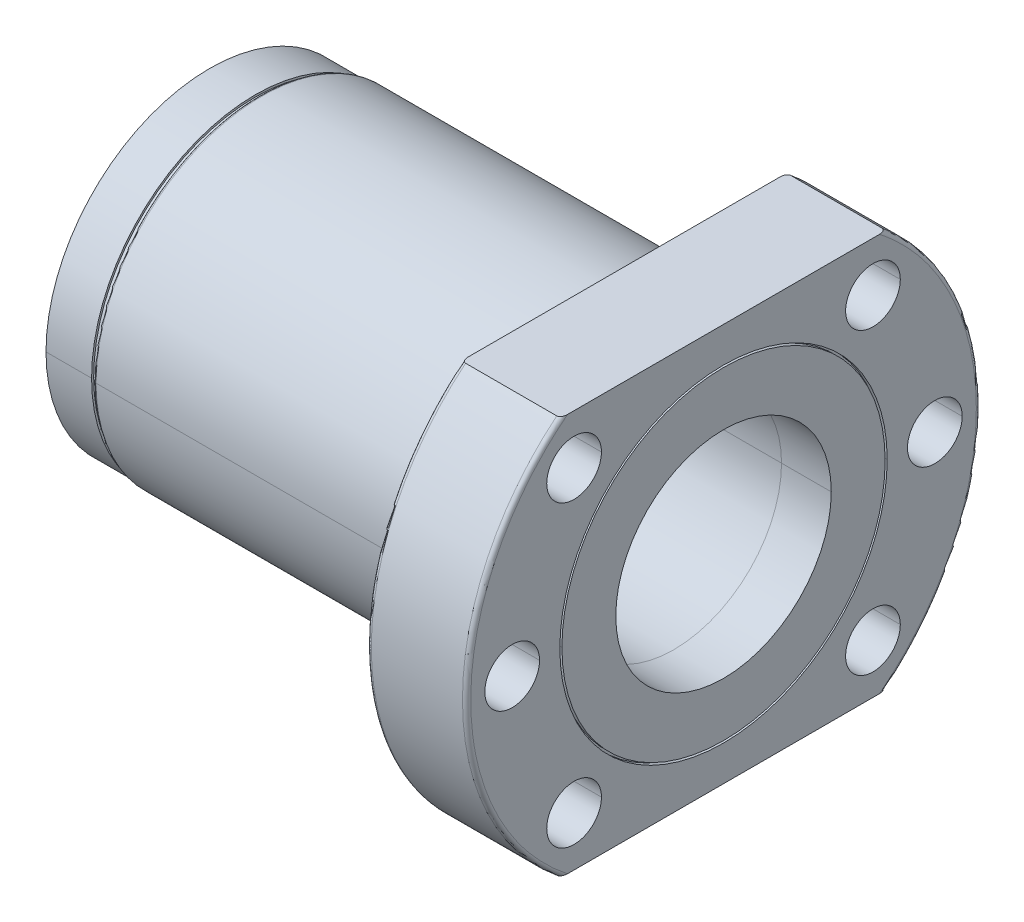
ISO-10303-21;
HEADER;
FILE_DESCRIPTION(('STEP AP214'),'2;1');
FILE_NAME('part.step','',(''),(''),'','','');
FILE_SCHEMA(('AUTOMOTIVE_DESIGN { 1 0 10303 214 1 1 1 1 }'));
ENDSEC;
DATA;
#1=APPLICATION_CONTEXT('core data for automotive mechanical design processes');
#2=APPLICATION_PROTOCOL_DEFINITION('international standard','automotive_design',2000,#1);
#3=PRODUCT_CONTEXT('',#1,'mechanical');
#4=PRODUCT('Part','Part','',(#3));
#5=PRODUCT_RELATED_PRODUCT_CATEGORY('part','',(#4));
#6=PRODUCT_DEFINITION_FORMATION('','',#4);
#7=PRODUCT_DEFINITION_CONTEXT('part definition',#1,'design');
#8=PRODUCT_DEFINITION('design','',#6,#7);
#9=PRODUCT_DEFINITION_SHAPE('','',#8);
#10=(LENGTH_UNIT() NAMED_UNIT(*) SI_UNIT(.MILLI.,.METRE.));
#11=(NAMED_UNIT(*) PLANE_ANGLE_UNIT() SI_UNIT($,.RADIAN.));
#12=(NAMED_UNIT(*) SI_UNIT($,.STERADIAN.) SOLID_ANGLE_UNIT());
#13=UNCERTAINTY_MEASURE_WITH_UNIT(LENGTH_MEASURE(1.E-05),#10,'distance_accuracy_value','');
#14=(GEOMETRIC_REPRESENTATION_CONTEXT(3) GLOBAL_UNCERTAINTY_ASSIGNED_CONTEXT((#13)) GLOBAL_UNIT_ASSIGNED_CONTEXT((#10,
#11,#12)) REPRESENTATION_CONTEXT('',''));
#15=CARTESIAN_POINT('',(0.,0.,0.));
#16=DIRECTION('',(0.,0.,1.));
#17=DIRECTION('',(1.,0.,0.));
#18=AXIS2_PLACEMENT_3D('',#15,#16,#17);
#19=CARTESIAN_POINT('',(-100.,0.,0.));
#20=DIRECTION('',(1.,0.,0.));
#21=DIRECTION('',(0.,0.,-1.));
#22=AXIS2_PLACEMENT_3D('',#19,#20,#21);
#23=CYLINDRICAL_SURFACE('',#22,13.);
#24=CARTESIAN_POINT('',(-81.,0.,0.));
#25=DIRECTION('',(1.,0.,0.));
#26=DIRECTION('',(0.,0.,-1.));
#27=AXIS2_PLACEMENT_3D('',#24,#25,#26);
#28=CIRCLE('',#27,13.);
#29=CARTESIAN_POINT('',(-81.,0.,13.));
#30=VERTEX_POINT('',#29);
#31=CARTESIAN_POINT('',(-81.,0.,-13.));
#32=VERTEX_POINT('',#31);
#33=EDGE_CURVE('P0_E11',#30,#32,#28,.T.);
#34=ORIENTED_EDGE('',*,*,#33,.F.);
#35=DIRECTION('',(1.,0.,0.));
#36=VECTOR('',#35,1.);
#37=CARTESIAN_POINT('',(-100.,0.,13.));
#38=LINE('',#37,#36);
#39=CARTESIAN_POINT('',(-75.,0.,13.));
#40=VERTEX_POINT('',#39);
#41=EDGE_CURVE('P0_E137',#30,#40,#38,.T.);
#42=ORIENTED_EDGE('',*,*,#41,.T.);
#43=CARTESIAN_POINT('',(-75.,0.,0.));
#44=DIRECTION('',(-1.,0.,0.));
#45=DIRECTION('',(0.,0.,-1.));
#46=AXIS2_PLACEMENT_3D('',#43,#44,#45);
#47=CIRCLE('',#46,13.);
#48=CARTESIAN_POINT('',(-75.,0.,-13.));
#49=VERTEX_POINT('',#48);
#50=EDGE_CURVE('P0_E134',#49,#40,#47,.T.);
#51=ORIENTED_EDGE('',*,*,#50,.F.);
#52=DIRECTION('',(1.,0.,0.));
#53=VECTOR('',#52,1.);
#54=CARTESIAN_POINT('',(-100.,0.,-13.));
#55=LINE('',#54,#53);
#56=EDGE_CURVE('P0_E149',#32,#49,#55,.T.);
#57=ORIENTED_EDGE('',*,*,#56,.F.);
#58=EDGE_LOOP('',(#34,#42,#51,#57));
#59=FACE_BOUND('',#58,.T.);
#60=ADVANCED_FACE('P0_F16',(#59),#23,.F.);
#61=CARTESIAN_POINT('',(-100.,0.,0.));
#62=DIRECTION('',(1.,0.,0.));
#63=DIRECTION('',(0.,0.,-1.));
#64=AXIS2_PLACEMENT_3D('',#61,#62,#63);
#65=CYLINDRICAL_SURFACE('',#64,19.75);
#66=CARTESIAN_POINT('',(-81.,0.,0.));
#67=DIRECTION('',(-1.,0.,0.));
#68=DIRECTION('',(0.,0.,-1.));
#69=AXIS2_PLACEMENT_3D('',#66,#67,#68);
#70=CIRCLE('',#69,19.75);
#71=CARTESIAN_POINT('',(-81.,0.,19.75));
#72=VERTEX_POINT('',#71);
#73=CARTESIAN_POINT('',(-81.,0.,-19.75));
#74=VERTEX_POINT('',#73);
#75=EDGE_CURVE('P0_E24',#72,#74,#70,.T.);
#76=ORIENTED_EDGE('',*,*,#75,.F.);
#77=DIRECTION('',(1.,0.,0.));
#78=VECTOR('',#77,1.);
#79=CARTESIAN_POINT('',(-100.,0.,19.75));
#80=LINE('',#79,#78);
#81=CARTESIAN_POINT('',(-75.5,0.,19.75));
#82=VERTEX_POINT('',#81);
#83=EDGE_CURVE('P0_E122',#72,#82,#80,.T.);
#84=ORIENTED_EDGE('',*,*,#83,.T.);
#85=CARTESIAN_POINT('',(-75.5,0.,0.));
#86=DIRECTION('',(-1.,0.,0.));
#87=DIRECTION('',(0.,0.,-1.));
#88=AXIS2_PLACEMENT_3D('',#85,#86,#87);
#89=CIRCLE('',#88,19.75);
#90=CARTESIAN_POINT('',(-75.5,0.,-19.75));
#91=VERTEX_POINT('',#90);
#92=EDGE_CURVE('P0_E95',#82,#91,#89,.T.);
#93=ORIENTED_EDGE('',*,*,#92,.T.);
#94=DIRECTION('',(1.,0.,0.));
#95=VECTOR('',#94,1.);
#96=CARTESIAN_POINT('',(-100.,0.,-19.75));
#97=LINE('',#96,#95);
#98=EDGE_CURVE('P0_E121',#74,#91,#97,.T.);
#99=ORIENTED_EDGE('',*,*,#98,.F.);
#100=EDGE_LOOP('',(#76,#84,#93,#99));
#101=FACE_BOUND('',#100,.T.);
#102=ADVANCED_FACE('P0_F160',(#101),#65,.T.);
#103=CARTESIAN_POINT('',(-100.,0.,0.));
#104=DIRECTION('',(1.,0.,0.));
#105=DIRECTION('',(0.,0.,-1.));
#106=AXIS2_PLACEMENT_3D('',#103,#104,#105);
#107=CYLINDRICAL_SURFACE('',#106,19.5);
#108=CARTESIAN_POINT('',(-75.5,0.,0.));
#109=DIRECTION('',(1.,0.,0.));
#110=DIRECTION('',(0.,0.,-1.));
#111=AXIS2_PLACEMENT_3D('',#108,#109,#110);
#112=CIRCLE('',#111,19.5);
#113=CARTESIAN_POINT('',(-75.5,0.,-19.5));
#114=VERTEX_POINT('',#113);
#115=CARTESIAN_POINT('',(-75.5,0.,19.5));
#116=VERTEX_POINT('',#115);
#117=EDGE_CURVE('P0_E84',#114,#116,#112,.T.);
#118=ORIENTED_EDGE('',*,*,#117,.T.);
#119=DIRECTION('',(1.,0.,0.));
#120=VECTOR('',#119,1.);
#121=CARTESIAN_POINT('',(-100.,0.,19.5));
#122=LINE('',#121,#120);
#123=CARTESIAN_POINT('',(-75.,0.,19.5));
#124=VERTEX_POINT('',#123);
#125=EDGE_CURVE('P0_E107',#116,#124,#122,.T.);
#126=ORIENTED_EDGE('',*,*,#125,.T.);
#127=CARTESIAN_POINT('',(-75.,0.,0.));
#128=DIRECTION('',(-1.,0.,0.));
#129=DIRECTION('',(0.,0.,-1.));
#130=AXIS2_PLACEMENT_3D('',#127,#128,#129);
#131=CIRCLE('',#130,19.5);
#132=CARTESIAN_POINT('',(-75.,0.,-19.5));
#133=VERTEX_POINT('',#132);
#134=EDGE_CURVE('P0_E94',#124,#133,#131,.T.);
#135=ORIENTED_EDGE('',*,*,#134,.T.);
#136=DIRECTION('',(1.,0.,0.));
#137=VECTOR('',#136,1.);
#138=CARTESIAN_POINT('',(-100.,0.,-19.5));
#139=LINE('',#138,#137);
#140=EDGE_CURVE('P0_E98',#114,#133,#139,.T.);
#141=ORIENTED_EDGE('',*,*,#140,.F.);
#142=EDGE_LOOP('',(#118,#126,#135,#141));
#143=FACE_BOUND('',#142,.T.);
#144=ADVANCED_FACE('P0_F99',(#143),#107,.T.);
#145=CARTESIAN_POINT('',(-81.,16.375,0.));
#146=DIRECTION('',(-1.,0.,0.));
#147=DIRECTION('',(0.,0.,1.));
#148=AXIS2_PLACEMENT_3D('',#145,#146,#147);
#149=PLANE('',#148);
#150=CARTESIAN_POINT('',(-81.,0.,0.));
#151=DIRECTION('',(1.,0.,0.));
#152=DIRECTION('',(0.,0.,-1.));
#153=AXIS2_PLACEMENT_3D('',#150,#151,#152);
#154=CIRCLE('',#153,13.);
#155=EDGE_CURVE('P0_E146',#32,#30,#154,.T.);
#156=ORIENTED_EDGE('',*,*,#155,.T.);
#157=ORIENTED_EDGE('',*,*,#33,.T.);
#158=EDGE_LOOP('',(#156,#157));
#159=FACE_BOUND('',#158,.T.);
#160=CARTESIAN_POINT('',(-81.,0.,0.));
#161=DIRECTION('',(-1.,0.,0.));
#162=DIRECTION('',(0.,0.,-1.));
#163=AXIS2_PLACEMENT_3D('',#160,#161,#162);
#164=CIRCLE('',#163,19.75);
#165=EDGE_CURVE('P0_E117',#74,#72,#164,.T.);
#166=ORIENTED_EDGE('',*,*,#165,.T.);
#167=ORIENTED_EDGE('',*,*,#75,.T.);
#168=EDGE_LOOP('',(#166,#167));
#169=FACE_BOUND('',#168,.T.);
#170=ADVANCED_FACE('P0_F156',(#159,#169),#149,.T.);
#171=CARTESIAN_POINT('',(-100.,0.,0.));
#172=DIRECTION('',(1.,0.,0.));
#173=DIRECTION('',(0.,0.,-1.));
#174=AXIS2_PLACEMENT_3D('',#171,#172,#173);
#175=CYLINDRICAL_SURFACE('',#174,13.);
#176=ORIENTED_EDGE('',*,*,#41,.F.);
#177=ORIENTED_EDGE('',*,*,#155,.F.);
#178=ORIENTED_EDGE('',*,*,#56,.T.);
#179=CARTESIAN_POINT('',(-75.,0.,0.));
#180=DIRECTION('',(-1.,0.,0.));
#181=DIRECTION('',(0.,0.,-1.));
#182=AXIS2_PLACEMENT_3D('',#179,#180,#181);
#183=CIRCLE('',#182,13.);
#184=EDGE_CURVE('P0_E125',#40,#49,#183,.T.);
#185=ORIENTED_EDGE('',*,*,#184,.F.);
#186=EDGE_LOOP('',(#176,#177,#178,#185));
#187=FACE_BOUND('',#186,.T.);
#188=ADVANCED_FACE('P0_F291',(#187),#175,.F.);
#189=CARTESIAN_POINT('',(-100.,0.,0.));
#190=DIRECTION('',(1.,0.,0.));
#191=DIRECTION('',(0.,0.,-1.));
#192=AXIS2_PLACEMENT_3D('',#189,#190,#191);
#193=CYLINDRICAL_SURFACE('',#192,19.75);
#194=ORIENTED_EDGE('',*,*,#83,.F.);
#195=ORIENTED_EDGE('',*,*,#165,.F.);
#196=ORIENTED_EDGE('',*,*,#98,.T.);
#197=CARTESIAN_POINT('',(-75.5,0.,0.));
#198=DIRECTION('',(-1.,0.,0.));
#199=DIRECTION('',(0.,0.,-1.));
#200=AXIS2_PLACEMENT_3D('',#197,#198,#199);
#201=CIRCLE('',#200,19.75);
#202=EDGE_CURVE('P0_E127',#91,#82,#201,.T.);
#203=ORIENTED_EDGE('',*,*,#202,.T.);
#204=EDGE_LOOP('',(#194,#195,#196,#203));
#205=FACE_BOUND('',#204,.T.);
#206=ADVANCED_FACE('P0_F165',(#205),#193,.T.);
#207=CARTESIAN_POINT('',(-75.,-19.9363999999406,-19.9363999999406));
#208=DIRECTION('',(-1.,0.,0.));
#209=DIRECTION('',(0.,0.,1.));
#210=AXIS2_PLACEMENT_3D('',#207,#208,#209);
#211=PLANE('',#210);
#212=ORIENTED_EDGE('',*,*,#50,.T.);
#213=ORIENTED_EDGE('',*,*,#184,.T.);
#214=EDGE_LOOP('',(#212,#213));
#215=FACE_BOUND('',#214,.T.);
#216=CARTESIAN_POINT('',(-75.,0.,0.));
#217=DIRECTION('',(-1.,0.,0.));
#218=DIRECTION('',(0.,0.,-1.));
#219=AXIS2_PLACEMENT_3D('',#216,#217,#218);
#220=CIRCLE('',#219,19.5);
#221=EDGE_CURVE('P0_E104',#133,#124,#220,.T.);
#222=ORIENTED_EDGE('',*,*,#221,.F.);
#223=ORIENTED_EDGE('',*,*,#134,.F.);
#224=EDGE_LOOP('',(#222,#223));
#225=FACE_BOUND('',#224,.T.);
#226=ADVANCED_FACE('P0_F268',(#215,#225),#211,.F.);
#227=CARTESIAN_POINT('',(-75.5,19.625,0.));
#228=DIRECTION('',(-1.,0.,0.));
#229=DIRECTION('',(0.,0.,1.));
#230=AXIS2_PLACEMENT_3D('',#227,#228,#229);
#231=PLANE('',#230);
#232=ORIENTED_EDGE('',*,*,#117,.F.);
#233=CARTESIAN_POINT('',(-75.5,0.,0.));
#234=DIRECTION('',(1.,0.,0.));
#235=DIRECTION('',(0.,0.,-1.));
#236=AXIS2_PLACEMENT_3D('',#233,#234,#235);
#237=CIRCLE('',#236,19.5);
#238=EDGE_CURVE('P0_E89',#116,#114,#237,.T.);
#239=ORIENTED_EDGE('',*,*,#238,.F.);
#240=EDGE_LOOP('',(#232,#239));
#241=FACE_BOUND('',#240,.T.);
#242=ORIENTED_EDGE('',*,*,#202,.F.);
#243=ORIENTED_EDGE('',*,*,#92,.F.);
#244=EDGE_LOOP('',(#242,#243));
#245=FACE_BOUND('',#244,.T.);
#246=ADVANCED_FACE('P0_F86',(#241,#245),#231,.F.);
#247=CARTESIAN_POINT('',(-100.,0.,0.));
#248=DIRECTION('',(1.,0.,0.));
#249=DIRECTION('',(0.,0.,-1.));
#250=AXIS2_PLACEMENT_3D('',#247,#248,#249);
#251=CYLINDRICAL_SURFACE('',#250,19.5);
#252=ORIENTED_EDGE('',*,*,#125,.F.);
#253=ORIENTED_EDGE('',*,*,#238,.T.);
#254=ORIENTED_EDGE('',*,*,#140,.T.);
#255=ORIENTED_EDGE('',*,*,#221,.T.);
#256=EDGE_LOOP('',(#252,#253,#254,#255));
#257=FACE_BOUND('',#256,.T.);
#258=ADVANCED_FACE('P0_F106',(#257),#251,.T.);
#259=CLOSED_SHELL('',(#60,#102,#144,#170,#188,#206,#226,#246,#258));
#260=MANIFOLD_SOLID_BREP('P0_B1',#259);
#261=CARTESIAN_POINT('',(-44.,0.,0.));
#262=DIRECTION('',(1.,0.,0.));
#263=DIRECTION('',(0.,0.,-1.));
#264=AXIS2_PLACEMENT_3D('',#261,#262,#263);
#265=CYLINDRICAL_SURFACE('',#264,13.);
#266=CARTESIAN_POINT('',(-25.,0.,0.));
#267=DIRECTION('',(1.,0.,0.));
#268=DIRECTION('',(0.,0.,-1.));
#269=AXIS2_PLACEMENT_3D('',#266,#267,#268);
#270=CIRCLE('',#269,13.);
#271=CARTESIAN_POINT('',(-25.,0.,13.));
#272=VERTEX_POINT('',#271);
#273=CARTESIAN_POINT('',(-25.,0.,-13.));
#274=VERTEX_POINT('',#273);
#275=EDGE_CURVE('P1_E11',#272,#274,#270,.T.);
#276=ORIENTED_EDGE('',*,*,#275,.F.);
#277=DIRECTION('',(1.,0.,0.));
#278=VECTOR('',#277,1.);
#279=CARTESIAN_POINT('',(-44.,0.,13.));
#280=LINE('',#279,#278);
#281=CARTESIAN_POINT('',(-19.,0.,13.));
#282=VERTEX_POINT('',#281);
#283=EDGE_CURVE('P1_E121',#272,#282,#280,.T.);
#284=ORIENTED_EDGE('',*,*,#283,.T.);
#285=CARTESIAN_POINT('',(-19.,0.,0.));
#286=DIRECTION('',(-1.,0.,0.));
#287=DIRECTION('',(0.,0.,-1.));
#288=AXIS2_PLACEMENT_3D('',#285,#286,#287);
#289=CIRCLE('',#288,13.);
#290=CARTESIAN_POINT('',(-19.,0.,-13.));
#291=VERTEX_POINT('',#290);
#292=EDGE_CURVE('P1_E141',#291,#282,#289,.T.);
#293=ORIENTED_EDGE('',*,*,#292,.F.);
#294=DIRECTION('',(1.,0.,0.));
#295=VECTOR('',#294,1.);
#296=CARTESIAN_POINT('',(-44.,0.,-13.));
#297=LINE('',#296,#295);
#298=EDGE_CURVE('P1_E120',#274,#291,#297,.T.);
#299=ORIENTED_EDGE('',*,*,#298,.F.);
#300=EDGE_LOOP('',(#276,#284,#293,#299));
#301=FACE_BOUND('',#300,.T.);
#302=ADVANCED_FACE('P1_F17',(#301),#265,.F.);
#303=CARTESIAN_POINT('',(-44.,0.,0.));
#304=DIRECTION('',(1.,0.,0.));
#305=DIRECTION('',(0.,0.,-1.));
#306=AXIS2_PLACEMENT_3D('',#303,#304,#305);
#307=CYLINDRICAL_SURFACE('',#306,19.75);
#308=CARTESIAN_POINT('',(-25.,0.,0.));
#309=DIRECTION('',(-1.,0.,0.));
#310=DIRECTION('',(0.,0.,-1.));
#311=AXIS2_PLACEMENT_3D('',#308,#309,#310);
#312=CIRCLE('',#311,19.75);
#313=CARTESIAN_POINT('',(-25.,0.,19.75));
#314=VERTEX_POINT('',#313);
#315=CARTESIAN_POINT('',(-25.,0.,-19.75));
#316=VERTEX_POINT('',#315);
#317=EDGE_CURVE('P1_E25',#314,#316,#312,.T.);
#318=ORIENTED_EDGE('',*,*,#317,.F.);
#319=DIRECTION('',(1.,0.,0.));
#320=VECTOR('',#319,1.);
#321=CARTESIAN_POINT('',(-44.,0.,19.75));
#322=LINE('',#321,#320);
#323=CARTESIAN_POINT('',(-19.5,0.,19.75));
#324=VERTEX_POINT('',#323);
#325=EDGE_CURVE('P1_E128',#314,#324,#322,.T.);
#326=ORIENTED_EDGE('',*,*,#325,.T.);
#327=CARTESIAN_POINT('',(-19.5,0.,0.));
#328=DIRECTION('',(-1.,0.,0.));
#329=DIRECTION('',(0.,0.,-1.));
#330=AXIS2_PLACEMENT_3D('',#327,#328,#329);
#331=CIRCLE('',#330,19.75);
#332=CARTESIAN_POINT('',(-19.5,0.,-19.75));
#333=VERTEX_POINT('',#332);
#334=EDGE_CURVE('P1_E97',#324,#333,#331,.T.);
#335=ORIENTED_EDGE('',*,*,#334,.T.);
#336=DIRECTION('',(1.,0.,0.));
#337=VECTOR('',#336,1.);
#338=CARTESIAN_POINT('',(-44.,0.,-19.75));
#339=LINE('',#338,#337);
#340=EDGE_CURVE('P1_E122',#316,#333,#339,.T.);
#341=ORIENTED_EDGE('',*,*,#340,.F.);
#342=EDGE_LOOP('',(#318,#326,#335,#341));
#343=FACE_BOUND('',#342,.T.);
#344=ADVANCED_FACE('P1_F161',(#343),#307,.T.);
#345=CARTESIAN_POINT('',(-44.,0.,0.));
#346=DIRECTION('',(1.,0.,0.));
#347=DIRECTION('',(0.,0.,-1.));
#348=AXIS2_PLACEMENT_3D('',#345,#346,#347);
#349=CYLINDRICAL_SURFACE('',#348,19.5);
#350=CARTESIAN_POINT('',(-19.5,0.,0.));
#351=DIRECTION('',(1.,0.,0.));
#352=DIRECTION('',(0.,0.,-1.));
#353=AXIS2_PLACEMENT_3D('',#350,#351,#352);
#354=CIRCLE('',#353,19.5);
#355=CARTESIAN_POINT('',(-19.5,0.,-19.5));
#356=VERTEX_POINT('',#355);
#357=CARTESIAN_POINT('',(-19.5,0.,19.5));
#358=VERTEX_POINT('',#357);
#359=EDGE_CURVE('P1_E86',#356,#358,#354,.T.);
#360=ORIENTED_EDGE('',*,*,#359,.T.);
#361=DIRECTION('',(1.,0.,0.));
#362=VECTOR('',#361,1.);
#363=CARTESIAN_POINT('',(-44.,0.,19.5));
#364=LINE('',#363,#362);
#365=CARTESIAN_POINT('',(-19.,0.,19.5));
#366=VERTEX_POINT('',#365);
#367=EDGE_CURVE('P1_E90',#358,#366,#364,.T.);
#368=ORIENTED_EDGE('',*,*,#367,.T.);
#369=CARTESIAN_POINT('',(-19.,0.,0.));
#370=DIRECTION('',(-1.,0.,0.));
#371=DIRECTION('',(0.,0.,-1.));
#372=AXIS2_PLACEMENT_3D('',#369,#370,#371);
#373=CIRCLE('',#372,19.5);
#374=CARTESIAN_POINT('',(-19.,0.,-19.5));
#375=VERTEX_POINT('',#374);
#376=EDGE_CURVE('P1_E96',#366,#375,#373,.T.);
#377=ORIENTED_EDGE('',*,*,#376,.T.);
#378=DIRECTION('',(1.,0.,0.));
#379=VECTOR('',#378,1.);
#380=CARTESIAN_POINT('',(-44.,0.,-19.5));
#381=LINE('',#380,#379);
#382=EDGE_CURVE('P1_E92',#356,#375,#381,.T.);
#383=ORIENTED_EDGE('',*,*,#382,.F.);
#384=EDGE_LOOP('',(#360,#368,#377,#383));
#385=FACE_BOUND('',#384,.T.);
#386=ADVANCED_FACE('P1_F88',(#385),#349,.T.);
#387=CARTESIAN_POINT('',(-25.,16.375,0.));
#388=DIRECTION('',(-1.,0.,0.));
#389=DIRECTION('',(0.,0.,1.));
#390=AXIS2_PLACEMENT_3D('',#387,#388,#389);
#391=PLANE('',#390);
#392=CARTESIAN_POINT('',(-25.,0.,0.));
#393=DIRECTION('',(1.,0.,0.));
#394=DIRECTION('',(0.,0.,-1.));
#395=AXIS2_PLACEMENT_3D('',#392,#393,#394);
#396=CIRCLE('',#395,13.);
#397=EDGE_CURVE('P1_E117',#274,#272,#396,.T.);
#398=ORIENTED_EDGE('',*,*,#397,.T.);
#399=ORIENTED_EDGE('',*,*,#275,.T.);
#400=EDGE_LOOP('',(#398,#399));
#401=FACE_BOUND('',#400,.T.);
#402=CARTESIAN_POINT('',(-25.,0.,0.));
#403=DIRECTION('',(-1.,0.,0.));
#404=DIRECTION('',(0.,0.,-1.));
#405=AXIS2_PLACEMENT_3D('',#402,#403,#404);
#406=CIRCLE('',#405,19.75);
#407=EDGE_CURVE('P1_E125',#316,#314,#406,.T.);
#408=ORIENTED_EDGE('',*,*,#407,.T.);
#409=ORIENTED_EDGE('',*,*,#317,.T.);
#410=EDGE_LOOP('',(#408,#409));
#411=FACE_BOUND('',#410,.T.);
#412=ADVANCED_FACE('P1_F157',(#401,#411),#391,.T.);
#413=CARTESIAN_POINT('',(-44.,0.,0.));
#414=DIRECTION('',(1.,0.,0.));
#415=DIRECTION('',(0.,0.,-1.));
#416=AXIS2_PLACEMENT_3D('',#413,#414,#415);
#417=CYLINDRICAL_SURFACE('',#416,13.);
#418=ORIENTED_EDGE('',*,*,#283,.F.);
#419=ORIENTED_EDGE('',*,*,#397,.F.);
#420=ORIENTED_EDGE('',*,*,#298,.T.);
#421=CARTESIAN_POINT('',(-19.,0.,0.));
#422=DIRECTION('',(-1.,0.,0.));
#423=DIRECTION('',(0.,0.,-1.));
#424=AXIS2_PLACEMENT_3D('',#421,#422,#423);
#425=CIRCLE('',#424,13.);
#426=EDGE_CURVE('P1_E131',#282,#291,#425,.T.);
#427=ORIENTED_EDGE('',*,*,#426,.F.);
#428=EDGE_LOOP('',(#418,#419,#420,#427));
#429=FACE_BOUND('',#428,.T.);
#430=ADVANCED_FACE('P1_F258',(#429),#417,.F.);
#431=CARTESIAN_POINT('',(-44.,0.,0.));
#432=DIRECTION('',(1.,0.,0.));
#433=DIRECTION('',(0.,0.,-1.));
#434=AXIS2_PLACEMENT_3D('',#431,#432,#433);
#435=CYLINDRICAL_SURFACE('',#434,19.75);
#436=ORIENTED_EDGE('',*,*,#325,.F.);
#437=ORIENTED_EDGE('',*,*,#407,.F.);
#438=ORIENTED_EDGE('',*,*,#340,.T.);
#439=CARTESIAN_POINT('',(-19.5,0.,0.));
#440=DIRECTION('',(-1.,0.,0.));
#441=DIRECTION('',(0.,0.,-1.));
#442=AXIS2_PLACEMENT_3D('',#439,#440,#441);
#443=CIRCLE('',#442,19.75);
#444=EDGE_CURVE('P1_E115',#333,#324,#443,.T.);
#445=ORIENTED_EDGE('',*,*,#444,.T.);
#446=EDGE_LOOP('',(#436,#437,#438,#445));
#447=FACE_BOUND('',#446,.T.);
#448=ADVANCED_FACE('P1_F166',(#447),#435,.T.);
#449=CARTESIAN_POINT('',(-19.,-19.9363999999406,-19.9363999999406));
#450=DIRECTION('',(-1.,0.,0.));
#451=DIRECTION('',(0.,0.,1.));
#452=AXIS2_PLACEMENT_3D('',#449,#450,#451);
#453=PLANE('',#452);
#454=ORIENTED_EDGE('',*,*,#292,.T.);
#455=ORIENTED_EDGE('',*,*,#426,.T.);
#456=EDGE_LOOP('',(#454,#455));
#457=FACE_BOUND('',#456,.T.);
#458=CARTESIAN_POINT('',(-19.,0.,0.));
#459=DIRECTION('',(-1.,0.,0.));
#460=DIRECTION('',(0.,0.,-1.));
#461=AXIS2_PLACEMENT_3D('',#458,#459,#460);
#462=CIRCLE('',#461,19.5);
#463=EDGE_CURVE('P1_E108',#375,#366,#462,.T.);
#464=ORIENTED_EDGE('',*,*,#463,.F.);
#465=ORIENTED_EDGE('',*,*,#376,.F.);
#466=EDGE_LOOP('',(#464,#465));
#467=FACE_BOUND('',#466,.T.);
#468=ADVANCED_FACE('P1_F272',(#457,#467),#453,.F.);
#469=CARTESIAN_POINT('',(-19.5,19.625,0.));
#470=DIRECTION('',(-1.,0.,0.));
#471=DIRECTION('',(0.,0.,1.));
#472=AXIS2_PLACEMENT_3D('',#469,#470,#471);
#473=PLANE('',#472);
#474=ORIENTED_EDGE('',*,*,#359,.F.);
#475=CARTESIAN_POINT('',(-19.5,0.,0.));
#476=DIRECTION('',(1.,0.,0.));
#477=DIRECTION('',(0.,0.,-1.));
#478=AXIS2_PLACEMENT_3D('',#475,#476,#477);
#479=CIRCLE('',#478,19.5);
#480=EDGE_CURVE('P1_E99',#358,#356,#479,.T.);
#481=ORIENTED_EDGE('',*,*,#480,.F.);
#482=EDGE_LOOP('',(#474,#481));
#483=FACE_BOUND('',#482,.T.);
#484=ORIENTED_EDGE('',*,*,#444,.F.);
#485=ORIENTED_EDGE('',*,*,#334,.F.);
#486=EDGE_LOOP('',(#484,#485));
#487=FACE_BOUND('',#486,.T.);
#488=ADVANCED_FACE('P1_F100',(#483,#487),#473,.F.);
#489=CARTESIAN_POINT('',(-44.,0.,0.));
#490=DIRECTION('',(1.,0.,0.));
#491=DIRECTION('',(0.,0.,-1.));
#492=AXIS2_PLACEMENT_3D('',#489,#490,#491);
#493=CYLINDRICAL_SURFACE('',#492,19.5);
#494=ORIENTED_EDGE('',*,*,#367,.F.);
#495=ORIENTED_EDGE('',*,*,#480,.T.);
#496=ORIENTED_EDGE('',*,*,#382,.T.);
#497=ORIENTED_EDGE('',*,*,#463,.T.);
#498=EDGE_LOOP('',(#494,#495,#496,#497));
#499=FACE_BOUND('',#498,.T.);
#500=ADVANCED_FACE('P1_F106',(#499),#493,.T.);
#501=CLOSED_SHELL('',(#302,#344,#386,#412,#430,#448,#468,#488,#500));
#502=MANIFOLD_SOLID_BREP('P1_B1',#501);
#503=CARTESIAN_POINT('',(-100.,0.,0.));
#504=DIRECTION('',(1.,0.,0.));
#505=DIRECTION('',(0.,0.,-1.));
#506=AXIS2_PLACEMENT_3D('',#503,#504,#505);
#507=CYLINDRICAL_SURFACE('',#506,13.);
#508=DIRECTION('',(1.,0.,0.));
#509=VECTOR('',#508,1.);
#510=CARTESIAN_POINT('',(-100.,0.,13.));
#511=LINE('',#510,#509);
#512=CARTESIAN_POINT('',(-75.,0.,13.));
#513=VERTEX_POINT('',#512);
#514=CARTESIAN_POINT('',(-25.,0.,13.));
#515=VERTEX_POINT('',#514);
#516=EDGE_CURVE('P2_E1583',#513,#515,#511,.T.);
#517=ORIENTED_EDGE('',*,*,#516,.F.);
#518=CARTESIAN_POINT('',(-75.,0.,0.));
#519=DIRECTION('',(1.,0.,0.));
#520=DIRECTION('',(0.,0.,-1.));
#521=AXIS2_PLACEMENT_3D('',#518,#519,#520);
#522=CIRCLE('',#521,13.);
#523=CARTESIAN_POINT('',(-75.,0.,-13.));
#524=VERTEX_POINT('',#523);
#525=EDGE_CURVE('P2_E388',#524,#513,#522,.T.);
#526=ORIENTED_EDGE('',*,*,#525,.F.);
#527=DIRECTION('',(1.,0.,0.));
#528=VECTOR('',#527,1.);
#529=CARTESIAN_POINT('',(-100.,0.,-13.));
#530=LINE('',#529,#528);
#531=CARTESIAN_POINT('',(-25.,0.,-13.));
#532=VERTEX_POINT('',#531);
#533=EDGE_CURVE('P2_E1573',#524,#532,#530,.T.);
#534=ORIENTED_EDGE('',*,*,#533,.T.);
#535=CARTESIAN_POINT('',(-25.,0.,0.));
#536=DIRECTION('',(-1.,0.,0.));
#537=DIRECTION('',(0.,0.,-1.));
#538=AXIS2_PLACEMENT_3D('',#535,#536,#537);
#539=CIRCLE('',#538,13.);
#540=EDGE_CURVE('P2_E722',#515,#532,#539,.T.);
#541=ORIENTED_EDGE('',*,*,#540,.F.);
#542=EDGE_LOOP('',(#517,#526,#534,#541));
#543=FACE_BOUND('',#542,.T.);
#544=ADVANCED_FACE('P2_F16',(#543),#507,.F.);
#545=CARTESIAN_POINT('',(-100.,0.,0.));
#546=DIRECTION('',(1.,0.,0.));
#547=DIRECTION('',(0.,0.,-1.));
#548=AXIS2_PLACEMENT_3D('',#545,#546,#547);
#549=CYLINDRICAL_SURFACE('',#548,19.75);
#550=CARTESIAN_POINT('',(-25.,0.,0.));
#551=DIRECTION('',(1.,0.,0.));
#552=DIRECTION('',(0.,0.,-1.));
#553=AXIS2_PLACEMENT_3D('',#550,#551,#552);
#554=CIRCLE('',#553,19.75);
#555=CARTESIAN_POINT('',(-25.,0.,19.75));
#556=VERTEX_POINT('',#555);
#557=CARTESIAN_POINT('',(-25.,0.,-19.75));
#558=VERTEX_POINT('',#557);
#559=EDGE_CURVE('P2_E1586',#556,#558,#554,.T.);
#560=ORIENTED_EDGE('',*,*,#559,.F.);
#561=DIRECTION('',(1.,0.,0.));
#562=VECTOR('',#561,1.);
#563=CARTESIAN_POINT('',(-100.,0.,19.75));
#564=LINE('',#563,#562);
#565=CARTESIAN_POINT('',(-19.,0.,19.75));
#566=VERTEX_POINT('',#565);
#567=EDGE_CURVE('P2_E706',#556,#566,#564,.T.);
#568=ORIENTED_EDGE('',*,*,#567,.T.);
#569=CARTESIAN_POINT('',(-19.,0.,0.));
#570=DIRECTION('',(1.,0.,0.));
#571=DIRECTION('',(0.,0.,-1.));
#572=AXIS2_PLACEMENT_3D('',#569,#570,#571);
#573=CIRCLE('',#572,19.75);
#574=CARTESIAN_POINT('',(-19.,0.,-19.75));
#575=VERTEX_POINT('',#574);
#576=EDGE_CURVE('P2_E374',#566,#575,#573,.T.);
#577=ORIENTED_EDGE('',*,*,#576,.T.);
#578=DIRECTION('',(1.,0.,0.));
#579=VECTOR('',#578,1.);
#580=CARTESIAN_POINT('',(-100.,0.,-19.75));
#581=LINE('',#580,#579);
#582=EDGE_CURVE('P2_E697',#558,#575,#581,.T.);
#583=ORIENTED_EDGE('',*,*,#582,.F.);
#584=EDGE_LOOP('',(#560,#568,#577,#583));
#585=FACE_BOUND('',#584,.T.);
#586=ADVANCED_FACE('P2_F831',(#585),#549,.F.);
#587=CARTESIAN_POINT('',(-30.5,0.,0.));
#588=DIRECTION('',(1.,0.,0.));
#589=DIRECTION('',(0.,0.,-1.));
#590=AXIS2_PLACEMENT_3D('',#587,#588,#589);
#591=TOROIDAL_SURFACE('',#590,30.5,0.5);
#592=CARTESIAN_POINT('',(-31.,0.,-30.5));
#593=CARTESIAN_POINT('',(-31.,-1.14059818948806,-30.500020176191));
#594=CARTESIAN_POINT('',(-31.,-2.84105018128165,-30.4052127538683));
#595=CARTESIAN_POINT('',(-31.,-4.80663157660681,-30.1286381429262));
#596=CARTESIAN_POINT('',(-31.,-5.78485245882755,-29.9488593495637));
#597=CARTESIAN_POINT('',(-31.,-6.27282044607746,-29.8485970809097));
#598=CARTESIAN_POINT('',(-31.,-6.48170477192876,-29.8034047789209));
#599=CARTESIAN_POINT('',(-31.,-6.62090658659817,-29.7727826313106));
#600=CARTESIAN_POINT('',(-31.,-6.68867174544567,-29.7576355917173));
#601=CARTESIAN_POINT('',(-31.,-9.04338846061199,-29.22250668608));
#602=CARTESIAN_POINT('',(-31.,-11.2397257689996,-28.4498962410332));
#603=CARTESIAN_POINT('',(-31.,-14.3980664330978,-26.9131729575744));
#604=CARTESIAN_POINT('',(-31.,-15.9234253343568,-26.0599123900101));
#605=CARTESIAN_POINT('',(-31.,-17.6088407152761,-24.9158686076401));
#606=CARTESIAN_POINT('',(-31.,-18.428005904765,-24.3067034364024));
#607=CARTESIAN_POINT('',(-31.,-18.8317028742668,-23.9928350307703));
#608=CARTESIAN_POINT('',(-31.,-19.003454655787,-23.8563301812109));
#609=CARTESIAN_POINT('',(-31.,-19.1176755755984,-23.7648847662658));
#610=CARTESIAN_POINT('',(-31.,-19.1761401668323,-23.7177271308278));
#611=CARTESIAN_POINT('',(-31.,-21.0022257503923,-22.2343424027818));
#612=CARTESIAN_POINT('',(-31.,-22.59173371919,-20.6172604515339));
#613=CARTESIAN_POINT('',(-31.,-24.,-18.8215302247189));
#614=(BOUNDED_CURVE() B_SPLINE_CURVE(3,(#592,#593,#594,#595,#596,#597,#598,#599,#600,#601,#602,
#603,#604,#605,#606,#607,#608,#609,#610,#611,#612,#613),.UNSPECIFIED.,.F.,
.F.) B_SPLINE_CURVE_WITH_KNOTS((4,1,1,1,1,2,2,2,1,1,1,1,2,2,4),(0.,0.125,0.1875,0.21875,
0.234375,0.2421875,0.25,0.5,0.625,0.6875,0.71875,0.734375,0.7421875,0.75,1.),
.UNSPECIFIED.) CURVE() GEOMETRIC_REPRESENTATION_ITEM() RATIONAL_B_SPLINE_CURVE((1.,1.,1.,1.,1.,
1.,1.,1.,1.,1.,1.,1.,1.,1.,1.,1.,1.,1.,1.,1.,1.,1.)) REPRESENTATION_ITEM(''));
#615=CARTESIAN_POINT('',(-31.,0.,-30.5));
#616=VERTEX_POINT('',#615);
#617=CARTESIAN_POINT('',(-31.,-24.,-18.8215302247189));
#618=VERTEX_POINT('',#617);
#619=EDGE_CURVE('P2_E551',#616,#618,#614,.T.);
#620=ORIENTED_EDGE('',*,*,#619,.F.);
#621=CARTESIAN_POINT('',(-30.5,0.,-30.5));
#622=DIRECTION('',(0.,-1.,0.));
#623=DIRECTION('',(1.,0.,0.));
#624=AXIS2_PLACEMENT_3D('',#621,#622,#623);
#625=CIRCLE('',#624,0.5);
#626=CARTESIAN_POINT('',(-30.5,0.,-31.));
#627=VERTEX_POINT('',#626);
#628=EDGE_CURVE('P2_E345',#616,#627,#625,.T.);
#629=ORIENTED_EDGE('',*,*,#628,.T.);
#630=CARTESIAN_POINT('',(-30.5,0.,0.));
#631=DIRECTION('',(-1.,0.,0.));
#632=DIRECTION('',(0.,0.,1.));
#633=AXIS2_PLACEMENT_3D('',#630,#631,#632);
#634=CIRCLE('',#633,31.);
#635=CARTESIAN_POINT('',(-30.5,-24.,-19.6214168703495));
#636=VERTEX_POINT('',#635);
#637=EDGE_CURVE('P2_E10',#627,#636,#634,.T.);
#638=ORIENTED_EDGE('',*,*,#637,.T.);
#639=CARTESIAN_POINT('',(-30.5,-23.9999999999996,-19.621416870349));
#640=CARTESIAN_POINT('',(-30.504400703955,-24.0000000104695,-19.6214170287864));
#641=CARTESIAN_POINT('',(-30.5088013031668,-24.0000033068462,-19.6213210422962));
#642=CARTESIAN_POINT('',(-30.5176176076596,-24.0000153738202,-19.6209383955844));
#643=CARTESIAN_POINT('',(-30.5220332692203,-24.0000241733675,-19.6206507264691));
#644=CARTESIAN_POINT('',(-30.5308765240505,-24.0000461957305,-19.6198839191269));
#645=CARTESIAN_POINT('',(-30.5353040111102,-24.000059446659,-19.6194035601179));
#646=CARTESIAN_POINT('',(-30.5441677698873,-24.0000893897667,-19.6182508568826));
#647=CARTESIAN_POINT('',(-30.5486038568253,-24.0001061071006,-19.6175770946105));
#648=CARTESIAN_POINT('',(-30.5574815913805,-24.0001420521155,-19.6160370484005));
#649=CARTESIAN_POINT('',(-30.5619229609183,-24.0001613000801,-19.6151691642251));
#650=CARTESIAN_POINT('',(-30.5708079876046,-24.0002014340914,-19.6132403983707));
#651=CARTESIAN_POINT('',(-30.5752512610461,-24.000222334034,-19.6121777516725));
#652=CARTESIAN_POINT('',(-30.5841367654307,-24.0002649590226,-19.6098590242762));
#653=CARTESIAN_POINT('',(-30.5885784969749,-24.0002866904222,-19.6086010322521));
#654=CARTESIAN_POINT('',(-30.5974575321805,-24.0003302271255,-19.6058912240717));
#655=CARTESIAN_POINT('',(-30.6018942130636,-24.0003520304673,-19.6044373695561));
#656=CARTESIAN_POINT('',(-30.6107597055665,-24.0003950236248,-19.601335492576));
#657=CARTESIAN_POINT('',(-30.6151877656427,-24.0004162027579,-19.5996853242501));
#658=CARTESIAN_POINT('',(-30.6240325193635,-24.0004573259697,-19.5961905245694));
#659=CARTESIAN_POINT('',(-30.6284483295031,-24.0004772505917,-19.5943436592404));
#660=CARTESIAN_POINT('',(-30.6372650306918,-24.0005153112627,-19.5904552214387));
#661=CARTESIAN_POINT('',(-30.6416649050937,-24.0005334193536,-19.5884113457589));
#662=CARTESIAN_POINT('',(-30.6504461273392,-24.0005673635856,-19.5841286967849));
#663=CARTESIAN_POINT('',(-30.6548263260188,-24.0005831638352,-19.5818875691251));
#664=CARTESIAN_POINT('',(-30.6635645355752,-24.0006120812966,-19.5772102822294));
#665=CARTESIAN_POINT('',(-30.6679212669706,-24.0006251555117,-19.5747717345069));
#666=CARTESIAN_POINT('',(-30.676608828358,-24.0006482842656,-19.5696995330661));
#667=CARTESIAN_POINT('',(-30.6809382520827,-24.0006582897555,-19.5670634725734));
#668=CARTESIAN_POINT('',(-30.6895674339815,-24.0006750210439,-19.5615962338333));
#669=CARTESIAN_POINT('',(-30.6938656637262,-24.0006816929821,-19.5587626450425));
#670=CARTESIAN_POINT('',(-30.7024286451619,-24.0006915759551,-19.5529004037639));
#671=CARTESIAN_POINT('',(-30.7066917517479,-24.0006947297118,-19.5498693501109));
#672=CARTESIAN_POINT('',(-30.7151806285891,-24.0006974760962,-19.543612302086));
#673=CARTESIAN_POINT('',(-30.7194046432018,-24.000697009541,-19.540383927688));
#674=CARTESIAN_POINT('',(-30.7278114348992,-24.0006924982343,-19.5337324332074));
#675=CARTESIAN_POINT('',(-30.7319923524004,-24.0006883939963,-19.5303069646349));
#676=CARTESIAN_POINT('',(-30.7403090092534,-24.000676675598,-19.5232615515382));
#677=CARTESIAN_POINT('',(-30.7444427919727,-24.00066900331,-19.5196392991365));
#678=CARTESIAN_POINT('',(-30.7526612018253,-24.0006503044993,-19.5122006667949));
#679=CARTESIAN_POINT('',(-30.7567437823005,-24.0006392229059,-19.5083820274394));
#680=CARTESIAN_POINT('',(-30.7648557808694,-24.000613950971,-19.500551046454));
#681=CARTESIAN_POINT('',(-30.7688830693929,-24.0005997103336,-19.49653650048));
#682=CARTESIAN_POINT('',(-30.7768804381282,-24.000568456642,-19.4883142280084));
#683=CARTESIAN_POINT('',(-30.7808483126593,-24.0005513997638,-19.4841043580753));
#684=CARTESIAN_POINT('',(-30.7887228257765,-24.000514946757,-19.4754919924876));
#685=CARTESIAN_POINT('',(-30.7926271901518,-24.0004955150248,-19.4710874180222));
#686=CARTESIAN_POINT('',(-30.8003704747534,-24.0004548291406,-19.4620864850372));
#687=CARTESIAN_POINT('',(-30.8042070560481,-24.0004335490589,-19.4574881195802));
#688=CARTESIAN_POINT('',(-30.8157126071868,-24.0003673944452,-19.4432828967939));
#689=CARTESIAN_POINT('',(-30.8231645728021,-24.0003212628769,-19.4334991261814));
#690=CARTESIAN_POINT('',(-30.8377670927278,-24.0002299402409,-19.4131826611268));
#691=CARTESIAN_POINT('',(-30.8448977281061,-24.000184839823,-19.4026357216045));
#692=CARTESIAN_POINT('',(-30.8588247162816,-24.0001053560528,-19.3807998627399));
#693=CARTESIAN_POINT('',(-30.8656005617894,-24.00007140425,-19.3694978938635));
#694=CARTESIAN_POINT('',(-30.8787896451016,-24.0000155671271,-19.3461632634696));
#695=CARTESIAN_POINT('',(-30.8851820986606,-23.99999414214,-19.3341188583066));
#696=CARTESIAN_POINT('',(-30.8945685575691,-24.0000031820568,-19.3152954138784));
#697=CARTESIAN_POINT('',(-30.8977811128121,-24.0000144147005,-19.3086243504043));
#698=CARTESIAN_POINT('',(-30.9042144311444,-24.0000588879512,-19.2947956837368));
#699=CARTESIAN_POINT('',(-30.9074240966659,-24.0000934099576,-19.2876329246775));
#700=CARTESIAN_POINT('',(-30.9173017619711,-24.0002155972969,-19.2647943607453));
#701=CARTESIAN_POINT('',(-30.923620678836,-24.0003181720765,-19.2489666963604));
#702=CARTESIAN_POINT('',(-30.9360613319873,-24.0005163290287,-19.2153312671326));
#703=CARTESIAN_POINT('',(-30.9420925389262,-24.0006100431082,-19.1974902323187));
#704=CARTESIAN_POINT('',(-30.953742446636,-24.0007534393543,-19.1598034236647));
#705=CARTESIAN_POINT('',(-30.9592670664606,-24.0007980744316,-19.1399286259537));
#706=CARTESIAN_POINT('',(-30.9696657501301,-24.0008237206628,-19.0981663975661));
#707=CARTESIAN_POINT('',(-30.9744413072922,-24.0007988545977,-19.0762543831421));
#708=CARTESIAN_POINT('',(-30.9807972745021,-24.0007181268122,-19.0425524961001));
#709=CARTESIAN_POINT('',(-30.9828245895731,-24.0006823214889,-19.0308447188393));
#710=CARTESIAN_POINT('',(-30.9866048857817,-24.0005985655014,-19.006931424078));
#711=CARTESIAN_POINT('',(-30.988344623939,-24.0005502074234,-18.9947237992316));
#712=CARTESIAN_POINT('',(-30.9915144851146,-24.0004465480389,-18.9698175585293));
#713=CARTESIAN_POINT('',(-30.9929310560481,-24.000391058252,-18.9571172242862));
#714=CARTESIAN_POINT('',(-30.9954186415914,-24.0002807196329,-18.93123348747));
#715=CARTESIAN_POINT('',(-30.9964758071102,-24.0002259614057,-18.9180487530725));
#716=CARTESIAN_POINT('',(-30.998208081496,-24.0001270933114,-18.8912063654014));
#717=CARTESIAN_POINT('',(-30.9988690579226,-24.0000834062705,-18.8775478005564));
#718=CARTESIAN_POINT('',(-30.9997722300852,-24.0000194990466,-18.8497698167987));
#719=CARTESIAN_POINT('',(-31.0000000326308,-24.0000000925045,-18.8356499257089));
#720=CARTESIAN_POINT('',(-31.,-23.9999999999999,-18.821530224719));
#721=B_SPLINE_CURVE_WITH_KNOTS('',3,(#639,#640,#641,#642,#643,#644,#645,#646,#647,#648,#649,
#650,#651,#652,#653,#654,#655,#656,#657,#658,#659,#660,#661,#662,#663,#664,#665,#666,#667,#668,
#669,#670,#671,#672,#673,#674,#675,#676,#677,#678,#679,#680,#681,#682,#683,#684,#685,#686,#687,
#688,#689,#690,#691,#692,#693,#694,#695,#696,#697,#698,#699,#700,#701,#702,#703,#704,#705,#706,
#707,#708,#709,#710,#711,#712,#713,#714,#715,#716,#717,#718,#719,#720),.UNSPECIFIED.,.F.,.F.,(4,
2,2,2,2,2,2,2,2,2,2,2,2,2,2,2,2,2,2,2,2,2,2,2,2,2,2,2,2,2,2,2,2,2,2,2,2,2,2,2,4),(0.,
0.0132009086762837,0.0264718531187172,0.0398282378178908,0.0532851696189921,0.066857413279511,
0.0805593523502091,0.0944049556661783,0.108407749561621,0.122580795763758,0.13693667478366,
0.151487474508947,0.166244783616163,0.181219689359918,0.196422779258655,0.211864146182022,
0.227553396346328,0.243499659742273,0.259711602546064,0.276197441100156,0.292964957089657,
0.310021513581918,0.327374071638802,0.345029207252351,0.362993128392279,0.399866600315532,
0.438041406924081,0.477555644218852,0.518443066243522,0.540653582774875,0.564198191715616,
0.61529941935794,0.671771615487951,0.733625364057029,0.80086393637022,0.83650591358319,
0.873493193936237,0.911824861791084,0.951499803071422,0.992516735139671,1.03487423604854),.UNSPECIFIED.);
#722=EDGE_CURVE('P2_E675',#636,#618,#721,.T.);
#723=ORIENTED_EDGE('',*,*,#722,.T.);
#724=EDGE_LOOP('',(#620,#629,#638,#723));
#725=FACE_BOUND('',#724,.T.);
#726=ADVANCED_FACE('P2_F465',(#725),#591,.T.);
#727=CARTESIAN_POINT('',(-19.,18.0312,18.0312));
#728=DIRECTION('',(-1.,0.,0.));
#729=DIRECTION('',(0.,0.,1.));
#730=AXIS2_PLACEMENT_3D('',#727,#728,#729);
#731=CYLINDRICAL_SURFACE('',#730,3.3);
#732=CARTESIAN_POINT('',(-19.,18.0312,18.0312));
#733=DIRECTION('',(-1.,0.,0.));
#734=DIRECTION('',(0.,0.,1.));
#735=AXIS2_PLACEMENT_3D('',#732,#733,#734);
#736=CIRCLE('',#735,3.3);
#737=CARTESIAN_POINT('',(-19.,18.0312,14.7312));
#738=VERTEX_POINT('',#737);
#739=CARTESIAN_POINT('',(-19.,18.0312,21.3312));
#740=VERTEX_POINT('',#739);
#741=EDGE_CURVE('P2_E378',#738,#740,#736,.T.);
#742=ORIENTED_EDGE('',*,*,#741,.F.);
#743=DIRECTION('',(-1.,0.,0.));
#744=VECTOR('',#743,1.);
#745=CARTESIAN_POINT('',(-19.,18.0312,14.7312));
#746=LINE('',#745,#744);
#747=CARTESIAN_POINT('',(-31.,18.0312,14.7312));
#748=VERTEX_POINT('',#747);
#749=EDGE_CURVE('P2_E359',#738,#748,#746,.T.);
#750=ORIENTED_EDGE('',*,*,#749,.T.);
#751=CARTESIAN_POINT('',(-31.,18.0312,18.0312));
#752=DIRECTION('',(1.,0.,0.));
#753=DIRECTION('',(0.,0.,1.));
#754=AXIS2_PLACEMENT_3D('',#751,#752,#753);
#755=CIRCLE('',#754,3.3);
#756=CARTESIAN_POINT('',(-31.,18.0312,21.3312));
#757=VERTEX_POINT('',#756);
#758=EDGE_CURVE('P2_E334',#757,#748,#755,.T.);
#759=ORIENTED_EDGE('',*,*,#758,.F.);
#760=DIRECTION('',(-1.,0.,0.));
#761=VECTOR('',#760,1.);
#762=CARTESIAN_POINT('',(-19.,18.0312,21.3312));
#763=LINE('',#762,#761);
#764=EDGE_CURVE('P2_E367',#740,#757,#763,.T.);
#765=ORIENTED_EDGE('',*,*,#764,.F.);
#766=EDGE_LOOP('',(#742,#750,#759,#765));
#767=FACE_BOUND('',#766,.T.);
#768=ADVANCED_FACE('P2_F461',(#767),#731,.F.);
#769=CARTESIAN_POINT('',(-19.,-18.0312,18.0312));
#770=DIRECTION('',(-1.,0.,0.));
#771=DIRECTION('',(0.,0.,1.));
#772=AXIS2_PLACEMENT_3D('',#769,#770,#771);
#773=CYLINDRICAL_SURFACE('',#772,3.3);
#774=CARTESIAN_POINT('',(-19.,-18.0312,18.0312));
#775=DIRECTION('',(-1.,0.,0.));
#776=DIRECTION('',(0.,0.,1.));
#777=AXIS2_PLACEMENT_3D('',#774,#775,#776);
#778=CIRCLE('',#777,3.3);
#779=CARTESIAN_POINT('',(-19.,-18.0312,14.7312));
#780=VERTEX_POINT('',#779);
#781=CARTESIAN_POINT('',(-19.,-18.0312,21.3312));
#782=VERTEX_POINT('',#781);
#783=EDGE_CURVE('P2_E420',#780,#782,#778,.T.);
#784=ORIENTED_EDGE('',*,*,#783,.F.);
#785=DIRECTION('',(-1.,0.,0.));
#786=VECTOR('',#785,1.);
#787=CARTESIAN_POINT('',(-19.,-18.0312,14.7312));
#788=LINE('',#787,#786);
#789=CARTESIAN_POINT('',(-31.,-18.0312,14.7312));
#790=VERTEX_POINT('',#789);
#791=EDGE_CURVE('P2_E370',#780,#790,#788,.T.);
#792=ORIENTED_EDGE('',*,*,#791,.T.);
#793=CARTESIAN_POINT('',(-31.,-18.0312,18.0312));
#794=DIRECTION('',(1.,0.,0.));
#795=DIRECTION('',(0.,0.,1.));
#796=AXIS2_PLACEMENT_3D('',#793,#794,#795);
#797=CIRCLE('',#796,3.3);
#798=CARTESIAN_POINT('',(-31.,-18.0312,21.3312));
#799=VERTEX_POINT('',#798);
#800=EDGE_CURVE('P2_E307',#799,#790,#797,.T.);
#801=ORIENTED_EDGE('',*,*,#800,.F.);
#802=DIRECTION('',(-1.,0.,0.));
#803=VECTOR('',#802,1.);
#804=CARTESIAN_POINT('',(-19.,-18.0312,21.3312));
#805=LINE('',#804,#803);
#806=EDGE_CURVE('P2_E299',#782,#799,#805,.T.);
#807=ORIENTED_EDGE('',*,*,#806,.F.);
#808=EDGE_LOOP('',(#784,#792,#801,#807));
#809=FACE_BOUND('',#808,.T.);
#810=ADVANCED_FACE('P2_F464',(#809),#773,.F.);
#811=CARTESIAN_POINT('',(-19.,-18.0312,-18.0312));
#812=DIRECTION('',(-1.,0.,0.));
#813=DIRECTION('',(0.,0.,1.));
#814=AXIS2_PLACEMENT_3D('',#811,#812,#813);
#815=CYLINDRICAL_SURFACE('',#814,3.3);
#816=CARTESIAN_POINT('',(-19.,-18.0312,-18.0312));
#817=DIRECTION('',(-1.,0.,0.));
#818=DIRECTION('',(0.,0.,1.));
#819=AXIS2_PLACEMENT_3D('',#816,#817,#818);
#820=CIRCLE('',#819,3.3);
#821=CARTESIAN_POINT('',(-19.,-18.0312,-21.3312));
#822=VERTEX_POINT('',#821);
#823=CARTESIAN_POINT('',(-19.,-18.0312,-14.7312));
#824=VERTEX_POINT('',#823);
#825=EDGE_CURVE('P2_E293',#822,#824,#820,.T.);
#826=ORIENTED_EDGE('',*,*,#825,.F.);
#827=DIRECTION('',(-1.,0.,0.));
#828=VECTOR('',#827,1.);
#829=CARTESIAN_POINT('',(-19.,-18.0312,-21.3312));
#830=LINE('',#829,#828);
#831=CARTESIAN_POINT('',(-31.,-18.0312,-21.3312));
#832=VERTEX_POINT('',#831);
#833=EDGE_CURVE('P2_E287',#822,#832,#830,.T.);
#834=ORIENTED_EDGE('',*,*,#833,.T.);
#835=CARTESIAN_POINT('',(-31.,-18.0312,-18.0312));
#836=DIRECTION('',(1.,0.,0.));
#837=DIRECTION('',(0.,0.,1.));
#838=AXIS2_PLACEMENT_3D('',#835,#836,#837);
#839=CIRCLE('',#838,3.3);
#840=CARTESIAN_POINT('',(-31.,-18.0312,-14.7312));
#841=VERTEX_POINT('',#840);
#842=EDGE_CURVE('P2_E292',#841,#832,#839,.T.);
#843=ORIENTED_EDGE('',*,*,#842,.F.);
#844=DIRECTION('',(-1.,0.,0.));
#845=VECTOR('',#844,1.);
#846=CARTESIAN_POINT('',(-19.,-18.0312,-14.7312));
#847=LINE('',#846,#845);
#848=EDGE_CURVE('P2_E304',#824,#841,#847,.T.);
#849=ORIENTED_EDGE('',*,*,#848,.F.);
#850=EDGE_LOOP('',(#826,#834,#843,#849));
#851=FACE_BOUND('',#850,.T.);
#852=ADVANCED_FACE('P2_F289',(#851),#815,.F.);
#853=CARTESIAN_POINT('',(-19.,18.0312,-18.0312));
#854=DIRECTION('',(-1.,0.,0.));
#855=DIRECTION('',(0.,0.,1.));
#856=AXIS2_PLACEMENT_3D('',#853,#854,#855);
#857=CYLINDRICAL_SURFACE('',#856,3.3);
#858=CARTESIAN_POINT('',(-19.,18.0312,-18.0312));
#859=DIRECTION('',(-1.,0.,0.));
#860=DIRECTION('',(0.,0.,1.));
#861=AXIS2_PLACEMENT_3D('',#858,#859,#860);
#862=CIRCLE('',#861,3.3);
#863=CARTESIAN_POINT('',(-19.,18.0312,-21.3312));
#864=VERTEX_POINT('',#863);
#865=CARTESIAN_POINT('',(-19.,18.0312,-14.7312));
#866=VERTEX_POINT('',#865);
#867=EDGE_CURVE('P2_E724',#864,#866,#862,.T.);
#868=ORIENTED_EDGE('',*,*,#867,.F.);
#869=DIRECTION('',(-1.,0.,0.));
#870=VECTOR('',#869,1.);
#871=CARTESIAN_POINT('',(-19.,18.0312,-21.3312));
#872=LINE('',#871,#870);
#873=CARTESIAN_POINT('',(-31.,18.0312,-21.3312));
#874=VERTEX_POINT('',#873);
#875=EDGE_CURVE('P2_E350',#864,#874,#872,.T.);
#876=ORIENTED_EDGE('',*,*,#875,.T.);
#877=CARTESIAN_POINT('',(-31.,18.0312,-18.0312));
#878=DIRECTION('',(1.,0.,0.));
#879=DIRECTION('',(0.,0.,1.));
#880=AXIS2_PLACEMENT_3D('',#877,#878,#879);
#881=CIRCLE('',#880,3.3);
#882=CARTESIAN_POINT('',(-31.,18.0312,-14.7312));
#883=VERTEX_POINT('',#882);
#884=EDGE_CURVE('P2_E319',#883,#874,#881,.T.);
#885=ORIENTED_EDGE('',*,*,#884,.F.);
#886=DIRECTION('',(-1.,0.,0.));
#887=VECTOR('',#886,1.);
#888=CARTESIAN_POINT('',(-19.,18.0312,-14.7312));
#889=LINE('',#888,#887);
#890=EDGE_CURVE('P2_E394',#866,#883,#889,.T.);
#891=ORIENTED_EDGE('',*,*,#890,.F.);
#892=EDGE_LOOP('',(#868,#876,#885,#891));
#893=FACE_BOUND('',#892,.T.);
#894=ADVANCED_FACE('P2_F838',(#893),#857,.F.);
#895=CARTESIAN_POINT('',(-19.,0.,25.5));
#896=DIRECTION('',(-1.,0.,0.));
#897=DIRECTION('',(0.,0.,1.));
#898=AXIS2_PLACEMENT_3D('',#895,#896,#897);
#899=CYLINDRICAL_SURFACE('',#898,3.3);
#900=CARTESIAN_POINT('',(-19.,0.,25.5));
#901=DIRECTION('',(-1.,0.,0.));
#902=DIRECTION('',(0.,0.,1.));
#903=AXIS2_PLACEMENT_3D('',#900,#901,#902);
#904=CIRCLE('',#903,3.3);
#905=CARTESIAN_POINT('',(-19.,0.,22.2));
#906=VERTEX_POINT('',#905);
#907=CARTESIAN_POINT('',(-19.,0.,28.8));
#908=VERTEX_POINT('',#907);
#909=EDGE_CURVE('P2_E324',#906,#908,#904,.T.);
#910=ORIENTED_EDGE('',*,*,#909,.F.);
#911=DIRECTION('',(-1.,0.,0.));
#912=VECTOR('',#911,1.);
#913=CARTESIAN_POINT('',(-19.,0.,22.2));
#914=LINE('',#913,#912);
#915=CARTESIAN_POINT('',(-31.,0.,22.2));
#916=VERTEX_POINT('',#915);
#917=EDGE_CURVE('P2_E397',#906,#916,#914,.T.);
#918=ORIENTED_EDGE('',*,*,#917,.T.);
#919=CARTESIAN_POINT('',(-31.,0.,25.5));
#920=DIRECTION('',(1.,0.,0.));
#921=DIRECTION('',(0.,0.,1.));
#922=AXIS2_PLACEMENT_3D('',#919,#920,#921);
#923=CIRCLE('',#922,3.3);
#924=CARTESIAN_POINT('',(-31.,0.,28.8));
#925=VERTEX_POINT('',#924);
#926=EDGE_CURVE('P2_E734',#925,#916,#923,.T.);
#927=ORIENTED_EDGE('',*,*,#926,.F.);
#928=DIRECTION('',(-1.,0.,0.));
#929=VECTOR('',#928,1.);
#930=CARTESIAN_POINT('',(-19.,0.,28.8));
#931=LINE('',#930,#929);
#932=EDGE_CURVE('P2_E354',#908,#925,#931,.T.);
#933=ORIENTED_EDGE('',*,*,#932,.F.);
#934=EDGE_LOOP('',(#910,#918,#927,#933));
#935=FACE_BOUND('',#934,.T.);
#936=ADVANCED_FACE('P2_F835',(#935),#899,.F.);
#937=CARTESIAN_POINT('',(-19.,0.,-25.5));
#938=DIRECTION('',(-1.,0.,0.));
#939=DIRECTION('',(0.,0.,1.));
#940=AXIS2_PLACEMENT_3D('',#937,#938,#939);
#941=CYLINDRICAL_SURFACE('',#940,3.3);
#942=CARTESIAN_POINT('',(-19.,0.,-25.5));
#943=DIRECTION('',(-1.,0.,0.));
#944=DIRECTION('',(0.,0.,1.));
#945=AXIS2_PLACEMENT_3D('',#942,#943,#944);
#946=CIRCLE('',#945,3.3);
#947=CARTESIAN_POINT('',(-19.,0.,-28.8));
#948=VERTEX_POINT('',#947);
#949=CARTESIAN_POINT('',(-19.,0.,-22.2));
#950=VERTEX_POINT('',#949);
#951=EDGE_CURVE('P2_E212',#948,#950,#946,.T.);
#952=ORIENTED_EDGE('',*,*,#951,.F.);
#953=DIRECTION('',(-1.,0.,0.));
#954=VECTOR('',#953,1.);
#955=CARTESIAN_POINT('',(-19.,0.,-28.8));
#956=LINE('',#955,#954);
#957=CARTESIAN_POINT('',(-31.,0.,-28.8));
#958=VERTEX_POINT('',#957);
#959=EDGE_CURVE('P2_E357',#948,#958,#956,.T.);
#960=ORIENTED_EDGE('',*,*,#959,.T.);
#961=CARTESIAN_POINT('',(-31.,0.,-25.5));
#962=DIRECTION('',(1.,0.,0.));
#963=DIRECTION('',(0.,0.,1.));
#964=AXIS2_PLACEMENT_3D('',#961,#962,#963);
#965=CIRCLE('',#964,3.3);
#966=CARTESIAN_POINT('',(-31.,0.,-22.2));
#967=VERTEX_POINT('',#966);
#968=EDGE_CURVE('P2_E645',#967,#958,#965,.T.);
#969=ORIENTED_EDGE('',*,*,#968,.F.);
#970=DIRECTION('',(-1.,0.,0.));
#971=VECTOR('',#970,1.);
#972=CARTESIAN_POINT('',(-19.,0.,-22.2));
#973=LINE('',#972,#971);
#974=EDGE_CURVE('P2_E408',#950,#967,#973,.T.);
#975=ORIENTED_EDGE('',*,*,#974,.F.);
#976=EDGE_LOOP('',(#952,#960,#969,#975));
#977=FACE_BOUND('',#976,.T.);
#978=ADVANCED_FACE('P2_F829',(#977),#941,.F.);
#979=CARTESIAN_POINT('',(-100.,0.,0.));
#980=DIRECTION('',(1.,0.,0.));
#981=DIRECTION('',(0.,0.,-1.));
#982=AXIS2_PLACEMENT_3D('',#979,#980,#981);
#983=CYLINDRICAL_SURFACE('',#982,31.);
#984=ORIENTED_EDGE('',*,*,#637,.F.);
#985=DIRECTION('',(1.,0.,0.));
#986=VECTOR('',#985,1.);
#987=CARTESIAN_POINT('',(-100.,0.,-31.));
#988=LINE('',#987,#986);
#989=CARTESIAN_POINT('',(-19.5,0.,-31.));
#990=VERTEX_POINT('',#989);
#991=EDGE_CURVE('P2_E411',#627,#990,#988,.T.);
#992=ORIENTED_EDGE('',*,*,#991,.T.);
#993=CARTESIAN_POINT('',(-19.5,0.,0.));
#994=DIRECTION('',(-1.,0.,0.));
#995=DIRECTION('',(0.,0.,-1.));
#996=AXIS2_PLACEMENT_3D('',#993,#994,#995);
#997=CIRCLE('',#996,31.);
#998=CARTESIAN_POINT('',(-19.5,-24.,-19.6214168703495));
#999=VERTEX_POINT('',#998);
#1000=EDGE_CURVE('P2_E25',#990,#999,#997,.T.);
#1001=ORIENTED_EDGE('',*,*,#1000,.T.);
#1002=DIRECTION('',(1.,0.,0.));
#1003=VECTOR('',#1002,1.);
#1004=CARTESIAN_POINT('',(-19.,-24.,-19.6214168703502));
#1005=LINE('',#1004,#1003);
#1006=EDGE_CURVE('P2_E808',#636,#999,#1005,.T.);
#1007=ORIENTED_EDGE('',*,*,#1006,.F.);
#1008=EDGE_LOOP('',(#984,#992,#1001,#1007));
#1009=FACE_BOUND('',#1008,.T.);
#1010=ADVANCED_FACE('P2_F825',(#1009),#983,.T.);
#1011=CARTESIAN_POINT('',(-19.5,0.,0.));
#1012=DIRECTION('',(1.,0.,0.));
#1013=DIRECTION('',(0.,0.,-1.));
#1014=AXIS2_PLACEMENT_3D('',#1011,#1012,#1013);
#1015=TOROIDAL_SURFACE('',#1014,30.5,0.499999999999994);
#1016=ORIENTED_EDGE('',*,*,#1000,.F.);
#1017=CARTESIAN_POINT('',(-19.5,0.,-30.5));
#1018=DIRECTION('',(0.,-1.,0.));
#1019=DIRECTION('',(0.,0.,-1.));
#1020=AXIS2_PLACEMENT_3D('',#1017,#1018,#1019);
#1021=CIRCLE('',#1020,0.499999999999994);
#1022=CARTESIAN_POINT('',(-19.,3.52319979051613E-07,-30.5000000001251));
#1023=VERTEX_POINT('',#1022);
#1024=EDGE_CURVE('P2_E416',#990,#1023,#1021,.T.);
#1025=ORIENTED_EDGE('',*,*,#1024,.T.);
#1026=CARTESIAN_POINT('',(-19.,3.52319979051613E-07,-30.5000000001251));
#1027=CARTESIAN_POINT('',(-19.,-1.13618426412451,-30.5));
#1028=CARTESIAN_POINT('',(-18.9999998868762,-2.27166270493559,-30.4367064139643));
#1029=CARTESIAN_POINT('',(-19.0000005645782,-3.96590797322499,-30.2471791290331));
#1030=CARTESIAN_POINT('',(-19.0000006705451,-4.52878735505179,-30.1680809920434));
#1031=CARTESIAN_POINT('',(-19.0000004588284,-5.3689519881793,-30.0257632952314));
#1032=CARTESIAN_POINT('',(-19.0000002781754,-5.78799589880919,-29.9486880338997));
#1033=CARTESIAN_POINT('',(-19.0000000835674,-6.27477023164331,-29.8484724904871));
#1034=CARTESIAN_POINT('',(-19.0000000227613,-6.51759342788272,-29.7957994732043));
#1035=CARTESIAN_POINT('',(-19.0000000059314,-6.63885948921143,-29.7688227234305));
#1036=CARTESIAN_POINT('',(-19.0000000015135,-6.6994555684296,-29.7551744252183));
#1037=CARTESIAN_POINT('',(-19.0000000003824,-6.72974429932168,-29.7483103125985));
#1038=CARTESIAN_POINT('',(-19.0000000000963,-6.74488632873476,-29.7448682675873));
#1039=CARTESIAN_POINT('',(-19.0000000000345,-6.75137526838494,-29.7433909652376));
#1040=CARTESIAN_POINT('',(-19.0000000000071,-6.7557011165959,-29.74240562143));
#1041=CARTESIAN_POINT('',(-19.,-6.75973777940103,-29.7414854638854));
#1042=CARTESIAN_POINT('',(-19.,-6.79702110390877,-29.7329844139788));
#1043=CARTESIAN_POINT('',(-18.9999999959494,-6.95804485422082,-29.6971450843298));
#1044=CARTESIAN_POINT('',(-19.0000000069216,-7.38346880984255,-29.5932616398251));
#1045=CARTESIAN_POINT('',(-19.0000000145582,-7.55589027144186,-29.5501350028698));
#1046=CARTESIAN_POINT('',(-19.0000000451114,-7.85979043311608,-29.4702854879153));
#1047=CARTESIAN_POINT('',(-19.00000005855,-7.96863208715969,-29.4411335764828));
#1048=CARTESIAN_POINT('',(-19.0000000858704,-8.1430943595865,-29.3932229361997));
#1049=CARTESIAN_POINT('',(-19.0000001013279,-8.23312509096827,-29.3682211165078));
#1050=CARTESIAN_POINT('',(-19.0000001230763,-8.34303164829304,-29.3371294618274));
#1051=CARTESIAN_POINT('',(-19.0000001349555,-8.39919871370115,-29.3210908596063));
#1052=CARTESIAN_POINT('',(-19.0000001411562,-8.42758519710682,-29.3129468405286));
#1053=CARTESIAN_POINT('',(-19.0000001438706,-8.43981569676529,-29.309429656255));
#1054=CARTESIAN_POINT('',(-19.000000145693,-8.44798377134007,-29.3070788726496));
#1055=CARTESIAN_POINT('',(-19.000000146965,-8.45364709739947,-29.3054473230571));
#1056=CARTESIAN_POINT('',(-19.0000002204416,-8.77954723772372,-29.2115050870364));
#1057=CARTESIAN_POINT('',(-19.0000002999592,-9.0794959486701,-29.1192542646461));
#1058=CARTESIAN_POINT('',(-19.0000003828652,-9.49498642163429,-28.985413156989));
#1059=CARTESIAN_POINT('',(-19.0000004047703,-9.62774512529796,-28.941550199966));
#1060=CARTESIAN_POINT('',(-19.0000004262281,-9.81836711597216,-28.8772226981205));
#1061=CARTESIAN_POINT('',(-19.0000004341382,-9.91154910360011,-28.8454252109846));
#1062=CARTESIAN_POINT('',(-19.0000004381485,-10.0165555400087,-28.8090387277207));
#1063=CARTESIAN_POINT('',(-19.0000004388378,-10.0681347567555,-28.7910314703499));
#1064=CARTESIAN_POINT('',(-19.0000004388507,-10.090042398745,-28.7833548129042));
#1065=CARTESIAN_POINT('',(-19.0000004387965,-10.1046035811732,-28.7782461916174));
#1066=CARTESIAN_POINT('',(-19.0000004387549,-10.1105035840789,-28.7761742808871));
#1067=CARTESIAN_POINT('',(-19.0000004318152,-10.6691997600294,-28.5796834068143));
#1068=CARTESIAN_POINT('',(-19.0000003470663,-11.2136980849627,-28.3703980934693));
#1069=CARTESIAN_POINT('',(-19.0000001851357,-12.0206900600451,-28.0332741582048));
#1070=CARTESIAN_POINT('',(-19.0000000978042,-12.421747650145,-27.8589144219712));
#1071=CARTESIAN_POINT('',(-19.0000000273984,-12.8850906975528,-27.6454773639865));
#1072=CARTESIAN_POINT('',(-19.0000000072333,-13.1155870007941,-27.5362715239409));
#1073=CARTESIAN_POINT('',(-19.0000000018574,-13.2305368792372,-27.4810489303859));
#1074=CARTESIAN_POINT('',(-19.0000000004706,-13.2879366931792,-27.4532829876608));
#1075=CARTESIAN_POINT('',(-19.0000000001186,-13.316617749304,-27.4393613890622));
#1076=CARTESIAN_POINT('',(-19.0000000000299,-13.3309535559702,-27.4323909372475));
#1077=CARTESIAN_POINT('',(-19.0000000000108,-13.337096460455,-27.42940153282));
#1078=CARTESIAN_POINT('',(-19.0000000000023,-13.3411915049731,-27.4274081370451));
#1079=CARTESIAN_POINT('',(-19.,-13.3448919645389,-27.4256060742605));
#1080=CARTESIAN_POINT('',(-19.,-13.3957498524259,-27.400835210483));
#1081=CARTESIAN_POINT('',(-18.9999999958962,-13.5525012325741,-27.3251715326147));
#1082=CARTESIAN_POINT('',(-19.0000000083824,-13.9429856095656,-27.126930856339));
#1083=CARTESIAN_POINT('',(-19.0000000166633,-14.098982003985,-27.0466119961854));
#1084=CARTESIAN_POINT('',(-19.0000000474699,-14.3706411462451,-26.9027612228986));
#1085=CARTESIAN_POINT('',(-19.0000000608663,-14.4674672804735,-26.8509087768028));
#1086=CARTESIAN_POINT('',(-19.0000000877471,-14.6219383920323,-26.7669656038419));
#1087=CARTESIAN_POINT('',(-19.00000010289,-14.7014814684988,-26.7234522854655));
#1088=CARTESIAN_POINT('',(-19.0000001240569,-14.7982760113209,-26.669914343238));
#1089=CARTESIAN_POINT('',(-19.0000001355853,-14.847665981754,-26.64244251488));
#1090=CARTESIAN_POINT('',(-19.0000001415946,-14.8726083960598,-26.6285296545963));
#1091=CARTESIAN_POINT('',(-19.0000001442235,-14.8833509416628,-26.6225289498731));
#1092=CARTESIAN_POINT('',(-19.000000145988,-14.8905243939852,-26.6185200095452));
#1093=CARTESIAN_POINT('',(-19.0000001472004,-14.8954209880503,-26.6157818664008));
#1094=CARTESIAN_POINT('',(-19.0000002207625,-15.1914097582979,-26.4502090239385));
#1095=CARTESIAN_POINT('',(-19.0000003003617,-15.4625196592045,-26.2921798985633));
#1096=CARTESIAN_POINT('',(-19.0000003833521,-15.8366964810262,-26.0673744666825));
#1097=CARTESIAN_POINT('',(-19.000000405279,-15.9560068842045,-25.9944739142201));
#1098=CARTESIAN_POINT('',(-19.0000004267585,-16.1270158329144,-25.8884860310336));
#1099=CARTESIAN_POINT('',(-19.0000004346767,-16.2105310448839,-25.8363323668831));
#1100=CARTESIAN_POINT('',(-19.0000004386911,-16.3045194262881,-25.7770201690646));
#1101=CARTESIAN_POINT('',(-19.0000004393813,-16.3506564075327,-25.7477550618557));
#1102=CARTESIAN_POINT('',(-19.0000004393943,-16.3702461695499,-25.7352974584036));
#1103=CARTESIAN_POINT('',(-19.0000004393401,-16.3832653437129,-25.7270112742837));
#1104=CARTESIAN_POINT('',(-19.0000004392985,-16.3885406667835,-25.7236515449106));
#1105=CARTESIAN_POINT('',(-19.0000004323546,-16.8879275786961,-25.4052761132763));
#1106=CARTESIAN_POINT('',(-19.0000003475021,-17.3705793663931,-25.0776695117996));
#1107=CARTESIAN_POINT('',(-19.0000001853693,-18.0797828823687,-24.5658893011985));
#1108=CARTESIAN_POINT('',(-19.0000000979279,-18.4306918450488,-24.3049077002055));
#1109=CARTESIAN_POINT('',(-19.0000000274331,-18.8333698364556,-23.9917104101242));
#1110=CARTESIAN_POINT('',(-19.0000000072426,-19.0329988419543,-23.8329568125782));
#1111=CARTESIAN_POINT('',(-19.0000000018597,-19.1323819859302,-23.7530443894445));
#1112=CARTESIAN_POINT('',(-19.0000000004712,-19.1819652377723,-23.7129546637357));
#1113=CARTESIAN_POINT('',(-19.0000000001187,-19.2067297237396,-23.6928764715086));
#1114=CARTESIAN_POINT('',(-19.0000000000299,-19.2191051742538,-23.6828290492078));
#1115=CARTESIAN_POINT('',(-19.0000000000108,-19.2244074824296,-23.678521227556));
#1116=CARTESIAN_POINT('',(-19.0000000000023,-19.2279420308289,-23.6756489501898));
#1117=CARTESIAN_POINT('',(-19.,-19.2311531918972,-23.6730385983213));
#1118=CARTESIAN_POINT('',(-19.,-19.272807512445,-23.6391735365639));
#1119=CARTESIAN_POINT('',(-18.9999999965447,-19.4042214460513,-23.5331063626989));
#1120=CARTESIAN_POINT('',(-19.0000000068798,-19.7309390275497,-23.2586681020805));
#1121=CARTESIAN_POINT('',(-19.0000000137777,-19.8613651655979,-23.147871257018));
#1122=CARTESIAN_POINT('',(-19.0000000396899,-20.0878358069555,-22.9510587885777));
#1123=CARTESIAN_POINT('',(-19.0000000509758,-20.168459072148,-22.8803463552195));
#1124=CARTESIAN_POINT('',(-19.0000000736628,-20.2968606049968,-22.7663634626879));
#1125=CARTESIAN_POINT('',(-19.0000000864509,-20.3629274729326,-22.7073929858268));
#1126=CARTESIAN_POINT('',(-19.0000001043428,-20.4432141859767,-22.6350708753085));
#1127=CARTESIAN_POINT('',(-19.0000001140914,-20.4841521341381,-22.5980211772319));
#1128=CARTESIAN_POINT('',(-19.0000001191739,-20.5048187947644,-22.5792731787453));
#1129=CARTESIAN_POINT('',(-19.0000001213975,-20.5137181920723,-22.5711903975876));
#1130=CARTESIAN_POINT('',(-19.0000001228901,-20.5196605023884,-22.5657912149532));
#1131=CARTESIAN_POINT('',(-19.0000001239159,-20.5237171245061,-22.5621035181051));
#1132=CARTESIAN_POINT('',(-19.0000001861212,-20.7687849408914,-22.3392580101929));
#1133=CARTESIAN_POINT('',(-19.0000002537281,-20.9916970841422,-22.129390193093));
#1134=CARTESIAN_POINT('',(-19.0000003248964,-21.2976163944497,-21.83383693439));
#1135=CARTESIAN_POINT('',(-19.0000003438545,-21.3948463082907,-21.7385225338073));
#1136=CARTESIAN_POINT('',(-19.0000003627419,-21.5338007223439,-21.6006117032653));
#1137=CARTESIAN_POINT('',(-19.0000003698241,-21.6015551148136,-21.5329210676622));
#1138=CARTESIAN_POINT('',(-19.0000003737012,-21.6776338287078,-21.4562136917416));
#1139=CARTESIAN_POINT('',(-19.0000003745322,-21.7149368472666,-21.4184324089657));
#1140=CARTESIAN_POINT('',(-19.0000003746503,-21.7307666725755,-21.4023637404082));
#1141=CARTESIAN_POINT('',(-19.0000003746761,-21.7412850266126,-21.3916787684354));
#1142=CARTESIAN_POINT('',(-19.0000003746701,-21.7455280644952,-21.3873660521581));
#1143=CARTESIAN_POINT('',(-19.0000003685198,-22.5483021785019,-20.57066583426));
#1144=CARTESIAN_POINT('',(-19.,-23.29928153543,-19.7156943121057));
#1145=CARTESIAN_POINT('',(-19.,-24.,-18.8215302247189));
#1146=(BOUNDED_CURVE() B_SPLINE_CURVE(3,(#1026,#1027,#1028,#1029,#1030,#1031,#1032,#1033,#1034,
#1035,#1036,#1037,#1038,#1039,#1040,#1041,#1042,#1043,#1044,#1045,#1046,#1047,#1048,#1049,#1050,
#1051,#1052,#1053,#1054,#1055,#1056,#1057,#1058,#1059,#1060,#1061,#1062,#1063,#1064,#1065,#1066,
#1067,#1068,#1069,#1070,#1071,#1072,#1073,#1074,#1075,#1076,#1077,#1078,#1079,#1080,#1081,#1082,
#1083,#1084,#1085,#1086,#1087,#1088,#1089,#1090,#1091,#1092,#1093,#1094,#1095,#1096,#1097,#1098,
#1099,#1100,#1101,#1102,#1103,#1104,#1105,#1106,#1107,#1108,#1109,#1110,#1111,#1112,#1113,#1114,
#1115,#1116,#1117,#1118,#1119,#1120,#1121,#1122,#1123,#1124,#1125,#1126,#1127,#1128,#1129,#1130,
#1131,#1132,#1133,#1134,#1135,#1136,#1137,#1138,#1139,#1140,#1141,#1142,#1143,#1144,#1145),
.UNSPECIFIED.,.F.,.F.) B_SPLINE_CURVE_WITH_KNOTS((4,2,2,1,1,1,1,1,1,1,2,2,2,2,2,1,1,1,1,2,2,2,2,
1,1,1,2,2,2,1,1,1,1,1,1,1,2,2,2,2,2,1,1,1,1,2,2,2,2,1,1,1,2,2,2,1,1,1,1,1,1,1,2,2,2,2,2,1,1,1,1,
2,2,2,2,1,1,1,2,2,4),(0.,0.125000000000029,0.187500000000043,0.21875000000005,0.234375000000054,
0.242187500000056,0.246093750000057,0.248046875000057,0.249023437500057,0.249511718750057,
0.249755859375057,0.250000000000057,0.281250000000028,0.296875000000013,0.304687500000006,
0.308593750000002,0.310546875,0.3115234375,0.312011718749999,0.312255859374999,0.3125,
0.34374999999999,0.359374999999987,0.367187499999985,0.371093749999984,0.373046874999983,
0.374023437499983,0.374999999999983,0.43749999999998,0.468749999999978,0.484374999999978,
0.492187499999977,0.496093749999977,0.498046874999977,0.499023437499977,0.499511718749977,
0.499755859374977,0.499999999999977,0.531249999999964,0.546874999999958,0.554687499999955,
0.558593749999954,0.560546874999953,0.561523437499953,0.562011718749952,0.562255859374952,
0.562499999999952,0.593749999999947,0.609374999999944,0.617187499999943,0.621093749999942,
0.623046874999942,0.624023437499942,0.624999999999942,0.687499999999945,0.718749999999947,
0.734374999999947,0.742187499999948,0.746093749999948,0.748046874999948,0.749023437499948,
0.749511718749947,0.749755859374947,0.749999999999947,0.781249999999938,0.796874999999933,
0.804687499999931,0.80859374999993,0.810546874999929,0.811523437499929,0.812011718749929,
0.812255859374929,0.812499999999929,0.843749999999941,0.859374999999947,0.867187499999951,
0.871093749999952,0.873046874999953,0.874023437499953,0.874999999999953,1.),
.UNSPECIFIED.) CURVE() GEOMETRIC_REPRESENTATION_ITEM() RATIONAL_B_SPLINE_CURVE((1.,1.,1.,1.,1.,
1.,1.,1.,1.,1.,1.,1.,1.,1.,1.,1.,1.,1.,1.,1.,1.,1.,1.,1.,1.,1.,1.,1.,1.,1.,1.,1.,1.,1.,1.,1.,1.,
1.,1.,1.,1.,1.,1.,1.,1.,1.,1.,1.,1.,1.,1.,1.,1.,1.,1.,1.,1.,1.,1.,1.,1.,1.,1.,1.,1.,1.,1.,1.,1.,
1.,1.,1.,1.,1.,1.,1.,1.,1.,1.,1.,1.,1.,1.,1.,1.,1.,1.,1.,1.,1.,1.,1.,1.,1.,1.,1.,1.,1.,1.,1.,1.,
1.,1.,1.,1.,1.,1.,1.,1.,1.,1.,1.,1.,1.,1.,1.,1.,1.,1.,1.)) REPRESENTATION_ITEM(''));
#1147=CARTESIAN_POINT('',(-19.,-24.,-18.8215302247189));
#1148=VERTEX_POINT('',#1147);
#1149=EDGE_CURVE('P2_E325',#1023,#1148,#1146,.T.);
#1150=ORIENTED_EDGE('',*,*,#1149,.T.);
#1151=CARTESIAN_POINT('',(-19.,-23.9999999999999,-18.821530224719));
#1152=CARTESIAN_POINT('',(-19.0000009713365,-24.000004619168,-18.8470431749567));
#1153=CARTESIAN_POINT('',(-19.0007439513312,-24.0000281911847,-18.8725576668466));
#1154=CARTESIAN_POINT('',(-19.0035816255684,-24.000067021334,-18.9207813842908));
#1155=CARTESIAN_POINT('',(-19.0055237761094,-24.0000828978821,-18.943499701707));
#1156=CARTESIAN_POINT('',(-19.010328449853,-24.0000786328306,-18.986088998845));
#1157=CARTESIAN_POINT('',(-19.0130531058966,-24.0000625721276,-19.0059755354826));
#1158=CARTESIAN_POINT('',(-19.0190427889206,-24.000024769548,-19.0428946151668));
#1159=CARTESIAN_POINT('',(-19.0221838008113,-24.0000040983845,-19.0599472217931));
#1160=CARTESIAN_POINT('',(-19.028170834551,-23.9999971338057,-19.0887900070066));
#1161=CARTESIAN_POINT('',(-19.0308216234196,-24.0000023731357,-19.1006209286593));
#1162=CARTESIAN_POINT('',(-19.0364123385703,-24.0000127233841,-19.1238130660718));
#1163=CARTESIAN_POINT('',(-19.0393402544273,-24.0000178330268,-19.1351771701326));
#1164=CARTESIAN_POINT('',(-19.0454588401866,-24.0000276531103,-19.1574303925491));
#1165=CARTESIAN_POINT('',(-19.0486376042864,-24.0000323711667,-19.1683227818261));
#1166=CARTESIAN_POINT('',(-19.0552313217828,-24.0000386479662,-19.1896288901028));
#1167=CARTESIAN_POINT('',(-19.0586344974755,-24.000040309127,-19.2000462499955));
#1168=CARTESIAN_POINT('',(-19.0656513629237,-24.000040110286,-19.2203996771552));
#1169=CARTESIAN_POINT('',(-19.0692533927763,-24.0000383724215,-19.2303397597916));
#1170=CARTESIAN_POINT('',(-19.0766430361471,-24.00003207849,-19.2497370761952));
#1171=CARTESIAN_POINT('',(-19.0804191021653,-24.0000276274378,-19.2591987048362));
#1172=CARTESIAN_POINT('',(-19.0881327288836,-24.0000177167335,-19.2776386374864));
#1173=CARTESIAN_POINT('',(-19.0920588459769,-24.0000123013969,-19.2866217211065));
#1174=CARTESIAN_POINT('',(-19.1000495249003,-24.0000038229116,-19.3041046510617));
#1175=CARTESIAN_POINT('',(-19.1041027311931,-24.0000006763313,-19.3126096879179));
#1176=CARTESIAN_POINT('',(-19.1137182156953,-23.9999991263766,-19.3319391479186));
#1177=CARTESIAN_POINT('',(-19.1193757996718,-24.0000023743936,-19.3427164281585));
#1178=CARTESIAN_POINT('',(-19.1309863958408,-24.0000110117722,-19.36364297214));
#1179=CARTESIAN_POINT('',(-19.1369232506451,-24.0000163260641,-19.3738011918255));
#1180=CARTESIAN_POINT('',(-19.1490647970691,-24.0000262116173,-19.3934839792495));
#1181=CARTESIAN_POINT('',(-19.1552535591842,-24.0000308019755,-19.4030183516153));
#1182=CARTESIAN_POINT('',(-19.1678712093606,-24.0000371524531,-19.4214488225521));
#1183=CARTESIAN_POINT('',(-19.1742844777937,-24.0000390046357,-19.4303555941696));
#1184=CARTESIAN_POINT('',(-19.187324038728,-24.0000392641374,-19.447527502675));
#1185=CARTESIAN_POINT('',(-19.1939350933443,-24.0000377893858,-19.4558041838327));
#1186=CARTESIAN_POINT('',(-19.2073433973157,-24.0000319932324,-19.4717134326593));
#1187=CARTESIAN_POINT('',(-19.2141258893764,-24.0000277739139,-19.4793584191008));
#1188=CARTESIAN_POINT('',(-19.2278516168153,-24.0000182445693,-19.4940036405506));
#1189=CARTESIAN_POINT('',(-19.2347806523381,-24.0000129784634,-19.5010171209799));
#1190=CARTESIAN_POINT('',(-19.2453685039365,-24.0000063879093,-19.5111422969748));
#1191=CARTESIAN_POINT('',(-19.2488801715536,-24.0000044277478,-19.514408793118));
#1192=CARTESIAN_POINT('',(-19.2559324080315,-24.0000014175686,-19.520782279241));
#1193=CARTESIAN_POINT('',(-19.2594713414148,-24.0000003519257,-19.5238910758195));
#1194=CARTESIAN_POINT('',(-19.2676218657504,-23.9999995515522,-19.5308420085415));
#1195=CARTESIAN_POINT('',(-19.2722614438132,-24.0000002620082,-19.5346514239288));
#1196=CARTESIAN_POINT('',(-19.2816061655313,-24.0000032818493,-19.5420244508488));
#1197=CARTESIAN_POINT('',(-19.2863088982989,-24.0000055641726,-19.5455911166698));
#1198=CARTESIAN_POINT('',(-19.2957747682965,-24.0000109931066,-19.5524777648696));
#1199=CARTESIAN_POINT('',(-19.3005356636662,-24.0000141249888,-19.5558008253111));
#1200=CARTESIAN_POINT('',(-19.3101126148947,-24.0000206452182,-19.5621994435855));
#1201=CARTESIAN_POINT('',(-19.3149266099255,-24.00002402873,-19.5652780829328));
#1202=CARTESIAN_POINT('',(-19.324604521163,-24.0000305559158,-19.5711871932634));
#1203=CARTESIAN_POINT('',(-19.3294665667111,-24.0000337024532,-19.5740207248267));
#1204=CARTESIAN_POINT('',(-19.3392353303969,-24.0000393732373,-19.5794390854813));
#1205=CARTESIAN_POINT('',(-19.3441403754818,-24.0000419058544,-19.5820269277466));
#1206=CARTESIAN_POINT('',(-19.3539898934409,-24.0000460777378,-19.586953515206));
#1207=CARTESIAN_POINT('',(-19.3589328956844,-24.0000477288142,-19.5892951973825));
#1208=CARTESIAN_POINT('',(-19.3688530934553,-24.0000499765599,-19.5937292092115));
#1209=CARTESIAN_POINT('',(-19.3738290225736,-24.0000505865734,-19.5958243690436));
#1210=CARTESIAN_POINT('',(-19.3838098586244,-24.0000506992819,-19.5997652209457));
#1211=CARTESIAN_POINT('',(-19.3888137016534,-24.0000502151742,-19.6016136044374));
#1212=CARTESIAN_POINT('',(-19.3988451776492,-24.0000481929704,-19.6050609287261));
#1213=CARTESIAN_POINT('',(-19.4038719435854,-24.0000466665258,-19.6066623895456));
#1214=CARTESIAN_POINT('',(-19.413944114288,-24.0000427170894,-19.6096160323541));
#1215=CARTESIAN_POINT('',(-19.4189888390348,-24.0000403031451,-19.6109705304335));
#1216=CARTESIAN_POINT('',(-19.4290918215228,-24.0000348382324,-19.6134305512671));
#1217=CARTESIAN_POINT('',(-19.434149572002,-24.0000317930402,-19.6145381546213));
#1218=CARTESIAN_POINT('',(-19.4442735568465,-24.0000254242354,-19.616504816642));
#1219=CARTESIAN_POINT('',(-19.4493394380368,-24.0000221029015,-19.6173656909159));
#1220=CARTESIAN_POINT('',(-19.459474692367,-24.0000156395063,-19.618839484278));
#1221=CARTESIAN_POINT('',(-19.4645438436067,-24.0000124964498,-19.6194539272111));
#1222=CARTESIAN_POINT('',(-19.4746807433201,-24.0000069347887,-19.6204354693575));
#1223=CARTESIAN_POINT('',(-19.4797483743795,-24.0000045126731,-19.620803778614));
#1224=CARTESIAN_POINT('',(-19.4898773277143,-24.0000010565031,-19.6212941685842));
#1225=CARTESIAN_POINT('',(-19.4949386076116,-24.0000000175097,-19.6214171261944));
#1226=CARTESIAN_POINT('',(-19.5,-23.9999999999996,-19.621416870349));
#1227=B_SPLINE_CURVE_WITH_KNOTS('',3,(#1151,#1152,#1153,#1154,#1155,#1156,#1157,#1158,#1159,
#1160,#1161,#1162,#1163,#1164,#1165,#1166,#1167,#1168,#1169,#1170,#1171,#1172,#1173,#1174,#1175,
#1176,#1177,#1178,#1179,#1180,#1181,#1182,#1183,#1184,#1185,#1186,#1187,#1188,#1189,#1190,#1191,
#1192,#1193,#1194,#1195,#1196,#1197,#1198,#1199,#1200,#1201,#1202,#1203,#1204,#1205,#1206,#1207,
#1208,#1209,#1210,#1211,#1212,#1213,#1214,#1215,#1216,#1217,#1218,#1219,#1220,#1221,#1222,#1223,
#1224,#1225,#1226),.UNSPECIFIED.,.F.,.F.,(4,2,2,2,2,2,2,2,2,2,2,2,2,2,2,2,2,2,2,2,2,2,2,2,2,2,2,
2,2,2,2,2,2,2,2,2,2,4),(0.,0.0765297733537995,0.144901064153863,0.205094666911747,
0.257095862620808,0.293462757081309,0.328662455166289,0.362696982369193,0.395568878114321,
0.427281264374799,0.457837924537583,0.487243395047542,0.51550307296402,0.552006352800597,
0.587291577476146,0.621379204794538,0.654292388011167,0.686057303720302,0.716703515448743,
0.746264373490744,0.760650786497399,0.774780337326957,0.792785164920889,0.810487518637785,
0.827900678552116,0.845038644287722,0.861916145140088,0.878548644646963,0.894952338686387,
0.911144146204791,0.927141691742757,0.942963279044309,0.9586278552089,0.974154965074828,
0.98956469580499,1.00487761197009,1.02011468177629,1.03529719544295),.UNSPECIFIED.);
#1228=EDGE_CURVE('P2_E800',#1148,#999,#1227,.T.);
#1229=ORIENTED_EDGE('',*,*,#1228,.T.);
#1230=EDGE_LOOP('',(#1016,#1025,#1150,#1229));
#1231=FACE_BOUND('',#1230,.T.);
#1232=ADVANCED_FACE('P2_F798',(#1231),#1015,.T.);
#1233=CARTESIAN_POINT('',(-74.7,0.,0.));
#1234=DIRECTION('',(1.,0.,0.));
#1235=DIRECTION('',(0.,0.,-1.));
#1236=AXIS2_PLACEMENT_3D('',#1233,#1234,#1235);
#1237=TOROIDAL_SURFACE('',#1236,19.699999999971,0.3);
#1238=CARTESIAN_POINT('',(-75.,0.,0.));
#1239=DIRECTION('',(1.,0.,0.));
#1240=DIRECTION('',(0.,0.,-1.));
#1241=AXIS2_PLACEMENT_3D('',#1238,#1239,#1240);
#1242=CIRCLE('',#1241,19.6999999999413);
#1243=CARTESIAN_POINT('',(-75.,0.,-19.6999999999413));
#1244=VERTEX_POINT('',#1243);
#1245=CARTESIAN_POINT('',(-75.,0.,19.6999999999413));
#1246=VERTEX_POINT('',#1245);
#1247=EDGE_CURVE('P2_E428',#1244,#1246,#1242,.T.);
#1248=ORIENTED_EDGE('',*,*,#1247,.T.);
#1249=CARTESIAN_POINT('',(-74.7,0.,19.699999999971));
#1250=DIRECTION('',(0.,1.,0.));
#1251=DIRECTION('',(0.,0.,1.));
#1252=AXIS2_PLACEMENT_3D('',#1249,#1250,#1251);
#1253=CIRCLE('',#1252,0.3);
#1254=CARTESIAN_POINT('',(-74.7,0.,20.));
#1255=VERTEX_POINT('',#1254);
#1256=EDGE_CURVE('P2_E39',#1246,#1255,#1253,.T.);
#1257=ORIENTED_EDGE('',*,*,#1256,.T.);
#1258=CARTESIAN_POINT('',(-74.7,0.,0.));
#1259=DIRECTION('',(1.,0.,0.));
#1260=DIRECTION('',(0.,0.,-1.));
#1261=AXIS2_PLACEMENT_3D('',#1258,#1259,#1260);
#1262=CIRCLE('',#1261,20.);
#1263=CARTESIAN_POINT('',(-74.7,0.,-20.));
#1264=VERTEX_POINT('',#1263);
#1265=EDGE_CURVE('P2_E1568',#1264,#1255,#1262,.T.);
#1266=ORIENTED_EDGE('',*,*,#1265,.F.);
#1267=CARTESIAN_POINT('',(-74.7,0.,-19.699999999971));
#1268=DIRECTION('',(0.,-1.,0.));
#1269=DIRECTION('',(0.,0.,-1.));
#1270=AXIS2_PLACEMENT_3D('',#1267,#1268,#1269);
#1271=CIRCLE('',#1270,0.3);
#1272=EDGE_CURVE('P2_E53',#1244,#1264,#1271,.T.);
#1273=ORIENTED_EDGE('',*,*,#1272,.F.);
#1274=EDGE_LOOP('',(#1248,#1257,#1266,#1273));
#1275=FACE_BOUND('',#1274,.T.);
#1276=ADVANCED_FACE('P2_F824',(#1275),#1237,.T.);
#1277=CARTESIAN_POINT('',(-74.7,0.,0.));
#1278=DIRECTION('',(1.,0.,0.));
#1279=DIRECTION('',(0.,0.,-1.));
#1280=AXIS2_PLACEMENT_3D('',#1277,#1278,#1279);
#1281=CYLINDRICAL_SURFACE('',#1280,20.);
#1282=DIRECTION('',(1.,0.,0.));
#1283=VECTOR('',#1282,1.);
#1284=CARTESIAN_POINT('',(-74.7,0.,20.));
#1285=LINE('',#1284,#1283);
#1286=CARTESIAN_POINT('',(-31.,0.,20.));
#1287=VERTEX_POINT('',#1286);
#1288=EDGE_CURVE('P2_E710',#1255,#1287,#1285,.T.);
#1289=ORIENTED_EDGE('',*,*,#1288,.F.);
#1290=CARTESIAN_POINT('',(-74.7,0.,0.));
#1291=DIRECTION('',(1.,0.,0.));
#1292=DIRECTION('',(0.,0.,-1.));
#1293=AXIS2_PLACEMENT_3D('',#1290,#1291,#1292);
#1294=CIRCLE('',#1293,20.);
#1295=EDGE_CURVE('P2_E433',#1255,#1264,#1294,.T.);
#1296=ORIENTED_EDGE('',*,*,#1295,.T.);
#1297=DIRECTION('',(1.,0.,0.));
#1298=VECTOR('',#1297,1.);
#1299=CARTESIAN_POINT('',(-74.7,0.,-20.));
#1300=LINE('',#1299,#1298);
#1301=CARTESIAN_POINT('',(-31.,0.,-20.));
#1302=VERTEX_POINT('',#1301);
#1303=EDGE_CURVE('P2_E716',#1264,#1302,#1300,.T.);
#1304=ORIENTED_EDGE('',*,*,#1303,.T.);
#1305=CARTESIAN_POINT('',(-31.,0.,0.));
#1306=DIRECTION('',(1.,0.,0.));
#1307=DIRECTION('',(0.,0.,1.));
#1308=AXIS2_PLACEMENT_3D('',#1305,#1306,#1307);
#1309=CIRCLE('',#1308,20.);
#1310=EDGE_CURVE('P2_E342',#1287,#1302,#1309,.T.);
#1311=ORIENTED_EDGE('',*,*,#1310,.F.);
#1312=EDGE_LOOP('',(#1289,#1296,#1304,#1311));
#1313=FACE_BOUND('',#1312,.T.);
#1314=ADVANCED_FACE('P2_F1272',(#1313),#1281,.T.);
#1315=CARTESIAN_POINT('',(-74.7,0.,0.));
#1316=DIRECTION('',(1.,0.,0.));
#1317=DIRECTION('',(0.,0.,-1.));
#1318=AXIS2_PLACEMENT_3D('',#1315,#1316,#1317);
#1319=TOROIDAL_SURFACE('',#1318,19.699999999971,0.3);
#1320=ORIENTED_EDGE('',*,*,#1256,.F.);
#1321=CARTESIAN_POINT('',(-75.,0.,0.));
#1322=DIRECTION('',(1.,0.,0.));
#1323=DIRECTION('',(0.,0.,-1.));
#1324=AXIS2_PLACEMENT_3D('',#1321,#1322,#1323);
#1325=CIRCLE('',#1324,19.6999999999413);
#1326=EDGE_CURVE('P2_E425',#1246,#1244,#1325,.T.);
#1327=ORIENTED_EDGE('',*,*,#1326,.T.);
#1328=ORIENTED_EDGE('',*,*,#1272,.T.);
#1329=ORIENTED_EDGE('',*,*,#1295,.F.);
#1330=EDGE_LOOP('',(#1320,#1327,#1328,#1329));
#1331=FACE_BOUND('',#1330,.T.);
#1332=ADVANCED_FACE('P2_F1262',(#1331),#1319,.T.);
#1333=CARTESIAN_POINT('',(-75.,19.5999999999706,0.));
#1334=DIRECTION('',(-1.,0.,0.));
#1335=DIRECTION('',(0.,0.,1.));
#1336=AXIS2_PLACEMENT_3D('',#1333,#1334,#1335);
#1337=PLANE('',#1336);
#1338=ORIENTED_EDGE('',*,*,#525,.T.);
#1339=CARTESIAN_POINT('',(-75.,0.,0.));
#1340=DIRECTION('',(1.,0.,0.));
#1341=DIRECTION('',(0.,0.,-1.));
#1342=AXIS2_PLACEMENT_3D('',#1339,#1340,#1341);
#1343=CIRCLE('',#1342,13.);
#1344=EDGE_CURVE('P2_E1604',#513,#524,#1343,.T.);
#1345=ORIENTED_EDGE('',*,*,#1344,.T.);
#1346=EDGE_LOOP('',(#1338,#1345));
#1347=FACE_BOUND('',#1346,.T.);
#1348=ORIENTED_EDGE('',*,*,#1247,.F.);
#1349=ORIENTED_EDGE('',*,*,#1326,.F.);
#1350=EDGE_LOOP('',(#1348,#1349));
#1351=FACE_BOUND('',#1350,.T.);
#1352=ADVANCED_FACE('P2_F1253',(#1347,#1351),#1337,.T.);
#1353=CARTESIAN_POINT('',(-100.,0.,0.));
#1354=DIRECTION('',(1.,0.,0.));
#1355=DIRECTION('',(0.,0.,-1.));
#1356=AXIS2_PLACEMENT_3D('',#1353,#1354,#1355);
#1357=CYLINDRICAL_SURFACE('',#1356,31.);
#1358=CARTESIAN_POINT('',(-19.5,0.,0.));
#1359=DIRECTION('',(-1.,0.,0.));
#1360=DIRECTION('',(0.,0.,-1.));
#1361=AXIS2_PLACEMENT_3D('',#1358,#1359,#1360);
#1362=CIRCLE('',#1361,31.);
#1363=CARTESIAN_POINT('',(-19.5,-24.,19.6214168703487));
#1364=VERTEX_POINT('',#1363);
#1365=CARTESIAN_POINT('',(-19.5,24.,19.6214168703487));
#1366=VERTEX_POINT('',#1365);
#1367=EDGE_CURVE('P2_E377',#1364,#1366,#1362,.T.);
#1368=ORIENTED_EDGE('',*,*,#1367,.T.);
#1369=DIRECTION('',(-1.,0.,0.));
#1370=VECTOR('',#1369,1.);
#1371=CARTESIAN_POINT('',(-19.,24.,19.6214168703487));
#1372=LINE('',#1371,#1370);
#1373=CARTESIAN_POINT('',(-30.5,24.,19.6214168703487));
#1374=VERTEX_POINT('',#1373);
#1375=EDGE_CURVE('P2_E762',#1366,#1374,#1372,.T.);
#1376=ORIENTED_EDGE('',*,*,#1375,.T.);
#1377=CARTESIAN_POINT('',(-30.5,0.,0.));
#1378=DIRECTION('',(-1.,0.,0.));
#1379=DIRECTION('',(0.,0.,1.));
#1380=AXIS2_PLACEMENT_3D('',#1377,#1378,#1379);
#1381=CIRCLE('',#1380,31.);
#1382=CARTESIAN_POINT('',(-30.5,-24.,19.6214168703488));
#1383=VERTEX_POINT('',#1382);
#1384=EDGE_CURVE('P2_E629',#1383,#1374,#1381,.T.);
#1385=ORIENTED_EDGE('',*,*,#1384,.F.);
#1386=DIRECTION('',(-1.,0.,0.));
#1387=VECTOR('',#1386,1.);
#1388=CARTESIAN_POINT('',(-19.,-24.,19.6214168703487));
#1389=LINE('',#1388,#1387);
#1390=EDGE_CURVE('P2_E505',#1364,#1383,#1389,.T.);
#1391=ORIENTED_EDGE('',*,*,#1390,.F.);
#1392=EDGE_LOOP('',(#1368,#1376,#1385,#1391));
#1393=FACE_BOUND('',#1392,.T.);
#1394=ADVANCED_FACE('P2_F474',(#1393),#1357,.T.);
#1395=CARTESIAN_POINT('',(-19.5,0.,0.));
#1396=DIRECTION('',(1.,0.,0.));
#1397=DIRECTION('',(0.,0.,-1.));
#1398=AXIS2_PLACEMENT_3D('',#1395,#1396,#1397);
#1399=TOROIDAL_SURFACE('',#1398,30.5,0.499999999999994);
#1400=CARTESIAN_POINT('',(-19.,24.,18.8215302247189));
#1401=CARTESIAN_POINT('',(-19.0000009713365,24.000004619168,18.8470431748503));
#1402=CARTESIAN_POINT('',(-19.000743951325,24.0000281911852,18.8725576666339));
#1403=CARTESIAN_POINT('',(-19.0035816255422,24.0000670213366,18.9207813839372));
#1404=CARTESIAN_POINT('',(-19.0055237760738,24.0000828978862,18.9434997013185));
#1405=CARTESIAN_POINT('',(-19.0103284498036,24.0000786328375,18.9860889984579));
#1406=CARTESIAN_POINT('',(-19.0130531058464,24.0000625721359,19.0059755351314));
#1407=CARTESIAN_POINT('',(-19.0190427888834,24.0000247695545,19.0428946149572));
#1408=CARTESIAN_POINT('',(-19.0221838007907,24.0000040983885,19.0599472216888));
#1409=CARTESIAN_POINT('',(-19.0281708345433,23.999997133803,19.088790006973));
#1410=CARTESIAN_POINT('',(-19.0308216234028,24.0000023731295,19.1006209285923));
#1411=CARTESIAN_POINT('',(-19.036412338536,24.0000127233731,19.123813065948));
#1412=CARTESIAN_POINT('',(-19.0393402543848,24.0000178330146,19.1351771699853));
#1413=CARTESIAN_POINT('',(-19.0454588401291,24.0000276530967,19.1574303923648));
#1414=CARTESIAN_POINT('',(-19.0486376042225,24.0000323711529,19.1683227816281));
#1415=CARTESIAN_POINT('',(-19.0552313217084,24.000038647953,19.1896288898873));
#1416=CARTESIAN_POINT('',(-19.0586344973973,24.0000403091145,19.200046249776));
#1417=CARTESIAN_POINT('',(-19.0656513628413,24.0000401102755,19.2203996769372));
#1418=CARTESIAN_POINT('',(-19.0692533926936,24.0000383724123,19.2303397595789));
#1419=CARTESIAN_POINT('',(-19.0766430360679,24.0000320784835,19.2497370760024));
#1420=CARTESIAN_POINT('',(-19.0804191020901,24.0000276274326,19.2591987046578));
#1421=CARTESIAN_POINT('',(-19.0881327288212,24.0000177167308,19.2776386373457));
#1422=CARTESIAN_POINT('',(-19.0920588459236,24.0000123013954,19.286621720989));
#1423=CARTESIAN_POINT('',(-19.1000495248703,24.0000038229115,19.304104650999));
#1424=CARTESIAN_POINT('',(-19.1041027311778,24.0000006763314,19.3126096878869));
#1425=CARTESIAN_POINT('',(-19.1137182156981,23.9999991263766,19.3319391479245));
#1426=CARTESIAN_POINT('',(-19.1193757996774,24.0000023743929,19.34271642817));
#1427=CARTESIAN_POINT('',(-19.1309863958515,24.0000110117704,19.3636429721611));
#1428=CARTESIAN_POINT('',(-19.1369232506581,24.0000163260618,19.3738011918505));
#1429=CARTESIAN_POINT('',(-19.1490647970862,24.0000262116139,19.3934839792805));
#1430=CARTESIAN_POINT('',(-19.1552535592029,24.0000308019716,19.4030183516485));
#1431=CARTESIAN_POINT('',(-19.1678712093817,24.0000371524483,19.4214488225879));
#1432=CARTESIAN_POINT('',(-19.1742844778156,24.0000390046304,19.430355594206));
#1433=CARTESIAN_POINT('',(-19.1873240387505,24.0000392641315,19.4475275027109));
#1434=CARTESIAN_POINT('',(-19.1939350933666,24.0000377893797,19.4558041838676));
#1435=CARTESIAN_POINT('',(-19.2073433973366,24.0000319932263,19.4717134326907));
#1436=CARTESIAN_POINT('',(-19.214125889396,24.0000277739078,19.4793584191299));
#1437=CARTESIAN_POINT('',(-19.2278516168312,24.000018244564,19.4940036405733));
#1438=CARTESIAN_POINT('',(-19.2347806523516,24.0000129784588,19.5010171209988));
#1439=CARTESIAN_POINT('',(-19.2453685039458,24.000006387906,19.5111422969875));
#1440=CARTESIAN_POINT('',(-19.2488801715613,24.000004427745,19.5144087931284));
#1441=CARTESIAN_POINT('',(-19.2559324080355,24.0000014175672,19.5207822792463));
#1442=CARTESIAN_POINT('',(-19.2594713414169,24.000000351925,19.5238910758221));
#1443=CARTESIAN_POINT('',(-19.2676218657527,23.9999995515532,19.5308420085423));
#1444=CARTESIAN_POINT('',(-19.2722614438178,24.0000002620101,19.5346514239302));
#1445=CARTESIAN_POINT('',(-19.2816061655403,24.0000032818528,19.5420244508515));
#1446=CARTESIAN_POINT('',(-19.2863088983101,24.0000055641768,19.5455911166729));
#1447=CARTESIAN_POINT('',(-19.2957747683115,24.000010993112,19.5524777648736));
#1448=CARTESIAN_POINT('',(-19.300535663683,24.0000141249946,19.5558008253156));
#1449=CARTESIAN_POINT('',(-19.3101126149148,24.0000206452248,19.5621994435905));
#1450=CARTESIAN_POINT('',(-19.3149266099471,24.000024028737,19.565278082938));
#1451=CARTESIAN_POINT('',(-19.3246045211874,24.0000305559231,19.5711871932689));
#1452=CARTESIAN_POINT('',(-19.3294665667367,24.0000337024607,19.5740207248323));
#1453=CARTESIAN_POINT('',(-19.3392353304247,24.0000393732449,19.579439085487));
#1454=CARTESIAN_POINT('',(-19.3441403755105,24.000041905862,19.5820269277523));
#1455=CARTESIAN_POINT('',(-19.3539898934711,24.0000460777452,19.5869535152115));
#1456=CARTESIAN_POINT('',(-19.3589328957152,24.0000477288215,19.5892951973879));
#1457=CARTESIAN_POINT('',(-19.3688530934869,24.0000499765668,19.5937292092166));
#1458=CARTESIAN_POINT('',(-19.3738290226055,24.0000505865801,19.5958243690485));
#1459=CARTESIAN_POINT('',(-19.3838098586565,24.0000506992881,19.5997652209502));
#1460=CARTESIAN_POINT('',(-19.3888137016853,24.0000502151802,19.6016136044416));
#1461=CARTESIAN_POINT('',(-19.3988451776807,24.0000481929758,19.6050609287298));
#1462=CARTESIAN_POINT('',(-19.4038719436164,24.0000466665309,19.6066623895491));
#1463=CARTESIAN_POINT('',(-19.4139441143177,24.0000427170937,19.609616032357));
#1464=CARTESIAN_POINT('',(-19.4189888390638,24.0000403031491,19.6109705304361));
#1465=CARTESIAN_POINT('',(-19.4290918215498,24.0000348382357,19.6134305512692));
#1466=CARTESIAN_POINT('',(-19.4341495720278,24.0000317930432,19.6145381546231));
#1467=CARTESIAN_POINT('',(-19.4442735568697,24.0000254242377,19.6165048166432));
#1468=CARTESIAN_POINT('',(-19.4493394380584,24.0000221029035,19.6173656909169));
#1469=CARTESIAN_POINT('',(-19.4594746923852,24.0000156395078,19.6188394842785));
#1470=CARTESIAN_POINT('',(-19.464543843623,24.000012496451,19.6194539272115));
#1471=CARTESIAN_POINT('',(-19.4746807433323,24.0000069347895,19.6204354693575));
#1472=CARTESIAN_POINT('',(-19.4797483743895,24.0000045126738,19.6208037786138));
#1473=CARTESIAN_POINT('',(-19.4898773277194,24.0000010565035,19.6212941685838));
#1474=CARTESIAN_POINT('',(-19.4949386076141,24.0000000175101,19.621417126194));
#1475=CARTESIAN_POINT('',(-19.5,23.9999999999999,19.6214168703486));
#1476=B_SPLINE_CURVE_WITH_KNOTS('',3,(#1400,#1401,#1402,#1403,#1404,#1405,#1406,#1407,#1408,
#1409,#1410,#1411,#1412,#1413,#1414,#1415,#1416,#1417,#1418,#1419,#1420,#1421,#1422,#1423,#1424,
#1425,#1426,#1427,#1428,#1429,#1430,#1431,#1432,#1433,#1434,#1435,#1436,#1437,#1438,#1439,#1440,
#1441,#1442,#1443,#1444,#1445,#1446,#1447,#1448,#1449,#1450,#1451,#1452,#1453,#1454,#1455,#1456,
#1457,#1458,#1459,#1460,#1461,#1462,#1463,#1464,#1465,#1466,#1467,#1468,#1469,#1470,#1471,#1472,
#1473,#1474,#1475),.UNSPECIFIED.,.F.,.F.,(4,2,2,2,2,2,2,2,2,2,2,2,2,2,2,2,2,2,2,2,2,2,2,2,2,2,2,
2,2,2,2,2,2,2,2,2,2,4),(0.,0.0765297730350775,0.144901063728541,0.205094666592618,
0.257095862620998,0.293462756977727,0.328662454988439,0.362696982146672,0.395568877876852,
0.42728126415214,0.457837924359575,0.487243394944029,0.515503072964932,0.5520063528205,
0.587291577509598,0.62137920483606,0.654292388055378,0.686057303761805,0.716703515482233,
0.74626437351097,0.760650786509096,0.774780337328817,0.792785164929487,0.81048751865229,
0.827900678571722,0.845038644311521,0.861916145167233,0.878548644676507,0.89495233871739,
0.91114414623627,0.927141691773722,0.942963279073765,0.958627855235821,0.974154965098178,
0.989564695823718,1.00487761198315,1.02011468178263,1.03529719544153),.UNSPECIFIED.);
#1477=CARTESIAN_POINT('',(-19.,24.,18.8215302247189));
#1478=VERTEX_POINT('',#1477);
#1479=EDGE_CURVE('P2_E764',#1478,#1366,#1476,.T.);
#1480=ORIENTED_EDGE('',*,*,#1479,.T.);
#1481=ORIENTED_EDGE('',*,*,#1367,.F.);
#1482=CARTESIAN_POINT('',(-19.5,-23.9999999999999,19.6214168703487));
#1483=CARTESIAN_POINT('',(-19.4955992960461,-24.0000000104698,19.621417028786));
#1484=CARTESIAN_POINT('',(-19.4911986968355,-24.0000033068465,19.6213210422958));
#1485=CARTESIAN_POINT('',(-19.4823823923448,-24.0000153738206,19.6209383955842));
#1486=CARTESIAN_POINT('',(-19.4779667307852,-24.0000241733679,19.6206507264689));
#1487=CARTESIAN_POINT('',(-19.469123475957,-24.0000461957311,19.6198839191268));
#1488=CARTESIAN_POINT('',(-19.4646959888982,-24.0000594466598,19.6194035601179));
#1489=CARTESIAN_POINT('',(-19.4558322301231,-24.0000893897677,19.6182508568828));
#1490=CARTESIAN_POINT('',(-19.4513961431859,-24.0001061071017,19.6175770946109));
#1491=CARTESIAN_POINT('',(-19.4425184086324,-24.000142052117,19.6160370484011));
#1492=CARTESIAN_POINT('',(-19.4380770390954,-24.0001613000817,19.6151691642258));
#1493=CARTESIAN_POINT('',(-19.4291920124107,-24.0002014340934,19.6132403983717));
#1494=CARTESIAN_POINT('',(-19.4247487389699,-24.0002223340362,19.6121777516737));
#1495=CARTESIAN_POINT('',(-19.4158632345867,-24.0002649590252,19.6098590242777));
#1496=CARTESIAN_POINT('',(-19.4114215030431,-24.000286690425,19.6086010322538));
#1497=CARTESIAN_POINT('',(-19.4025424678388,-24.0003302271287,19.6058912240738));
#1498=CARTESIAN_POINT('',(-19.3981057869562,-24.0003520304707,19.6044373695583));
#1499=CARTESIAN_POINT('',(-19.3892402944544,-24.0003950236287,19.6013354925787));
#1500=CARTESIAN_POINT('',(-19.3848122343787,-24.000416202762,19.599685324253));
#1501=CARTESIAN_POINT('',(-19.3759674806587,-24.0004573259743,19.5961905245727));
#1502=CARTESIAN_POINT('',(-19.3715516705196,-24.0004772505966,19.5943436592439));
#1503=CARTESIAN_POINT('',(-19.3627349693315,-24.0005153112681,19.5904552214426));
#1504=CARTESIAN_POINT('',(-19.3583350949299,-24.0005334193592,19.588411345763));
#1505=CARTESIAN_POINT('',(-19.3495538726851,-24.0005673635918,19.5841286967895));
#1506=CARTESIAN_POINT('',(-19.3451736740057,-24.0005831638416,19.5818875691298));
#1507=CARTESIAN_POINT('',(-19.3364354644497,-24.0006120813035,19.5772102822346));
#1508=CARTESIAN_POINT('',(-19.3320787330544,-24.0006251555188,19.5747717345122));
#1509=CARTESIAN_POINT('',(-19.3233911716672,-24.0006482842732,19.5696995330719));
#1510=CARTESIAN_POINT('',(-19.3190617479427,-24.0006582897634,19.5670634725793));
#1511=CARTESIAN_POINT('',(-19.3104325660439,-24.0006750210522,19.5615962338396));
#1512=CARTESIAN_POINT('',(-19.3061343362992,-24.0006816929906,19.558762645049));
#1513=CARTESIAN_POINT('',(-19.2975713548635,-24.0006915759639,19.5529004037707));
#1514=CARTESIAN_POINT('',(-19.2933082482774,-24.0006947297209,19.5498693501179));
#1515=CARTESIAN_POINT('',(-19.284819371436,-24.0006974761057,19.5436123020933));
#1516=CARTESIAN_POINT('',(-19.2805953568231,-24.0006970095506,19.5403839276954));
#1517=CARTESIAN_POINT('',(-19.2721885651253,-24.0006924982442,19.5337324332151));
#1518=CARTESIAN_POINT('',(-19.268007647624,-24.0006883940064,19.5303069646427));
#1519=CARTESIAN_POINT('',(-19.2596909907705,-24.0006766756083,19.5232615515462));
#1520=CARTESIAN_POINT('',(-19.2555572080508,-24.0006690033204,19.5196392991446));
#1521=CARTESIAN_POINT('',(-19.2473387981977,-24.0006503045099,19.5122006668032));
#1522=CARTESIAN_POINT('',(-19.2432562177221,-24.0006392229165,19.5083820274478));
#1523=CARTESIAN_POINT('',(-19.2351442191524,-24.0006139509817,19.5005510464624));
#1524=CARTESIAN_POINT('',(-19.2311169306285,-24.0005997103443,19.4965365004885));
#1525=CARTESIAN_POINT('',(-19.2231195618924,-24.0005684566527,19.4883142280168));
#1526=CARTESIAN_POINT('',(-19.2191516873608,-24.0005513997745,19.4841043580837));
#1527=CARTESIAN_POINT('',(-19.2112771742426,-24.0005149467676,19.4754919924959));
#1528=CARTESIAN_POINT('',(-19.2073728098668,-24.0004955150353,19.4710874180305));
#1529=CARTESIAN_POINT('',(-19.1996295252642,-24.000454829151,19.4620864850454));
#1530=CARTESIAN_POINT('',(-19.1957929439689,-24.0004335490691,19.4574881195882));
#1531=CARTESIAN_POINT('',(-19.1842873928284,-24.000367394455,19.4432828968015));
#1532=CARTESIAN_POINT('',(-19.1768354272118,-24.0003212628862,19.4334991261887));
#1533=CARTESIAN_POINT('',(-19.1622329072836,-24.000229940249,19.4131826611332));
#1534=CARTESIAN_POINT('',(-19.1551022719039,-24.0001848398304,19.4026357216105));
#1535=CARTESIAN_POINT('',(-19.1411752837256,-24.0001053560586,19.3807998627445));
#1536=CARTESIAN_POINT('',(-19.1343994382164,-24.0000714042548,19.3694978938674));
#1537=CARTESIAN_POINT('',(-19.1212103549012,-24.0000155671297,19.3461632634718));
#1538=CARTESIAN_POINT('',(-19.1148179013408,-23.9999941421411,19.3341188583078));
#1539=CARTESIAN_POINT('',(-19.1054314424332,-24.000003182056,19.3152954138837));
#1540=CARTESIAN_POINT('',(-19.1022188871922,-24.0000144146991,19.308624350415));
#1541=CARTESIAN_POINT('',(-19.0957855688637,-24.0000588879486,19.2947956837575));
#1542=CARTESIAN_POINT('',(-19.0925759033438,-24.0000934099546,19.2876329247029));
#1543=CARTESIAN_POINT('',(-19.0826982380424,-24.0002155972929,19.2647943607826));
#1544=CARTESIAN_POINT('',(-19.0763793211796,-24.000318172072,19.2489666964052));
#1545=CARTESIAN_POINT('',(-19.0639386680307,-24.000516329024,19.2153312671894));
#1546=CARTESIAN_POINT('',(-19.0579074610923,-24.0006100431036,19.1974902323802));
#1547=CARTESIAN_POINT('',(-19.0462575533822,-24.0007534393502,19.1598034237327));
#1548=CARTESIAN_POINT('',(-19.040732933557,-24.0007980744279,19.1399286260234));
#1549=CARTESIAN_POINT('',(-19.0303342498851,-24.0008237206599,19.0981663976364));
#1550=CARTESIAN_POINT('',(-19.0255586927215,-24.0007988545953,19.0762543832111));
#1551=CARTESIAN_POINT('',(-19.0192027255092,-24.0007181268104,19.042552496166));
#1552=CARTESIAN_POINT('',(-19.0171754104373,-24.0006823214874,19.0308447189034));
#1553=CARTESIAN_POINT('',(-19.0133951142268,-24.0005985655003,19.0069314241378));
#1554=CARTESIAN_POINT('',(-19.0116553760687,-24.0005502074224,18.9947237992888));
#1555=CARTESIAN_POINT('',(-19.0084855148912,-24.0004465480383,18.9698175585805));
#1556=CARTESIAN_POINT('',(-19.0070689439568,-24.0003910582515,18.9571172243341));
#1557=CARTESIAN_POINT('',(-19.004581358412,-24.0002807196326,18.9312334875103));
#1558=CARTESIAN_POINT('',(-19.0035241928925,-24.0002259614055,18.9180487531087));
#1559=CARTESIAN_POINT('',(-19.0017919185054,-24.0001270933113,18.8912063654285));
#1560=CARTESIAN_POINT('',(-19.0011309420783,-24.0000834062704,18.8775478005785));
#1561=CARTESIAN_POINT('',(-19.0002277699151,-24.0000194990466,18.8497698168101));
#1562=CARTESIAN_POINT('',(-18.9999999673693,-24.0000000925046,18.8356499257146));
#1563=CARTESIAN_POINT('',(-19.,-23.9999999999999,18.821530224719));
#1564=B_SPLINE_CURVE_WITH_KNOTS('',3,(#1482,#1483,#1484,#1485,#1486,#1487,#1488,#1489,#1490,
#1491,#1492,#1493,#1494,#1495,#1496,#1497,#1498,#1499,#1500,#1501,#1502,#1503,#1504,#1505,#1506,
#1507,#1508,#1509,#1510,#1511,#1512,#1513,#1514,#1515,#1516,#1517,#1518,#1519,#1520,#1521,#1522,
#1523,#1524,#1525,#1526,#1527,#1528,#1529,#1530,#1531,#1532,#1533,#1534,#1535,#1536,#1537,#1538,
#1539,#1540,#1541,#1542,#1543,#1544,#1545,#1546,#1547,#1548,#1549,#1550,#1551,#1552,#1553,#1554,
#1555,#1556,#1557,#1558,#1559,#1560,#1561,#1562,#1563),.UNSPECIFIED.,.F.,.F.,(4,2,2,2,2,2,2,2,2,
2,2,2,2,2,2,2,2,2,2,2,2,2,2,2,2,2,2,2,2,2,2,2,2,2,2,2,2,2,2,2,4),(0.,0.0132009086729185,
0.0264718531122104,0.0398282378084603,0.0532851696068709,0.0668574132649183,0.080559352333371,
0.0944049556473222,0.108407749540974,0.122580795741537,0.1369366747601,0.151487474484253,
0.166244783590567,0.181219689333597,0.19642277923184,0.211864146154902,0.227553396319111,
0.243499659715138,0.259711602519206,0.276197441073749,0.292964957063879,0.310021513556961,
0.327374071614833,0.345029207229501,0.362993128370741,0.399866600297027,0.438041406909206,
0.477555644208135,0.518443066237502,0.540653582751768,0.564198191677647,0.615299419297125,
0.671771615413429,0.73362536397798,0.800863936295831,0.836505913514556,0.873493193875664,
0.911824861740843,0.951499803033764,0.992516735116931,1.03487423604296),.UNSPECIFIED.);
#1565=CARTESIAN_POINT('',(-19.,-24.,18.8215302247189));
#1566=VERTEX_POINT('',#1565);
#1567=EDGE_CURVE('P2_E500',#1364,#1566,#1564,.T.);
#1568=ORIENTED_EDGE('',*,*,#1567,.T.);
#1569=CARTESIAN_POINT('',(-19.,-24.,18.8215302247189));
#1570=CARTESIAN_POINT('',(-19.,-23.354170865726,19.6450498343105));
#1571=CARTESIAN_POINT('',(-19.,-22.665919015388,20.4352977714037));
#1572=CARTESIAN_POINT('',(-19.,-21.5753683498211,21.5644916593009));
#1573=CARTESIAN_POINT('',(-19.,-21.2021627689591,21.9315324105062));
#1574=CARTESIAN_POINT('',(-19.,-20.628562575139,22.4673287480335));
#1575=CARTESIAN_POINT('',(-19.,-20.3383151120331,22.7315363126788));
#1576=CARTESIAN_POINT('',(-19.,-19.9938283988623,23.0331668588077));
#1577=CARTESIAN_POINT('',(-19.,-19.8201403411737,23.1823105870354));
#1578=CARTESIAN_POINT('',(-19.,-19.7329378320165,23.2564622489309));
#1579=CARTESIAN_POINT('',(-19.,-19.6954888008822,23.288151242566));
#1580=CARTESIAN_POINT('',(-19.,-19.670505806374,23.309257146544));
#1581=CARTESIAN_POINT('',(-19.,-19.6590182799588,23.3189475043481));
#1582=CARTESIAN_POINT('',(-19.,-18.7801589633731,24.0589981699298));
#1583=CARTESIAN_POINT('',(-18.9999998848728,-17.8750300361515,24.7391593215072));
#1584=CARTESIAN_POINT('',(-19.0000005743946,-16.4634569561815,25.6821441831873));
#1585=CARTESIAN_POINT('',(-19.000000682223,-15.98417565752,25.9832032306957));
#1586=CARTESIAN_POINT('',(-19.0000004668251,-15.2532744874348,26.4141893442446));
#1587=CARTESIAN_POINT('',(-19.0000002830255,-14.8848297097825,26.6245328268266));
#1588=CARTESIAN_POINT('',(-19.0000000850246,-14.4499967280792,26.8607801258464));
#1589=CARTESIAN_POINT('',(-19.0000000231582,-14.2313678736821,26.9765985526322));
#1590=CARTESIAN_POINT('',(-19.0000000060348,-14.1217544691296,27.0339293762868));
#1591=CARTESIAN_POINT('',(-19.0000000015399,-14.0668735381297,27.0624499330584));
#1592=CARTESIAN_POINT('',(-19.0000000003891,-14.0394145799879,27.0766739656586));
#1593=CARTESIAN_POINT('',(-19.0000000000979,-14.0256804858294,27.0837769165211));
#1594=CARTESIAN_POINT('',(-19.0000000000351,-14.0197934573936,27.0868190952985));
#1595=CARTESIAN_POINT('',(-19.0000000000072,-14.0158685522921,27.0888467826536));
#1596=CARTESIAN_POINT('',(-19.,-14.0121099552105,27.0907877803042));
#1597=CARTESIAN_POINT('',(-19.,-13.9906137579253,27.101887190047));
#1598=CARTESIAN_POINT('',(-18.9999999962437,-13.862621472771,27.1688839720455));
#1599=CARTESIAN_POINT('',(-19.0000000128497,-13.3886806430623,27.405679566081));
#1600=CARTESIAN_POINT('',(-19.000000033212,-13.0426647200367,27.5755098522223));
#1601=CARTESIAN_POINT('',(-19.0000001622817,-12.466784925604,27.8364855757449));
#1602=CARTESIAN_POINT('',(-19.0000001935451,-12.3444280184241,27.8910750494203));
#1603=CARTESIAN_POINT('',(-19.0000002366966,-12.1985735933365,27.9548706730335));
#1604=CARTESIAN_POINT('',(-19.0000002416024,-12.1822536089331,27.9619921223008));
#1605=CARTESIAN_POINT('',(-19.0000002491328,-12.1576023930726,27.972723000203));
#1606=CARTESIAN_POINT('',(-19.000000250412,-12.1534551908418,27.9745255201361));
#1607=CARTESIAN_POINT('',(-19.0000002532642,-12.1441610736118,27.9785645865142));
#1608=CARTESIAN_POINT('',(-19.0000002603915,-12.1209360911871,27.988650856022));
#1609=CARTESIAN_POINT('',(-19.0000002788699,-12.0606853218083,28.0147272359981));
#1610=CARTESIAN_POINT('',(-19.0000003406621,-11.8578542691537,28.1017916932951));
#1611=CARTESIAN_POINT('',(-19.0000003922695,-11.6768086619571,28.1773689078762));
#1612=CARTESIAN_POINT('',(-19.0000004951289,-11.2489302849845,28.3522410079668));
#1613=CARTESIAN_POINT('',(-19.0000005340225,-10.9725245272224,28.4601411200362));
#1614=CARTESIAN_POINT('',(-19.0000005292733,-10.571914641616,28.6103012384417));
#1615=CARTESIAN_POINT('',(-19.0000005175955,-10.4407098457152,28.6584055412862));
#1616=CARTESIAN_POINT('',(-19.0000004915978,-10.2796853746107,28.7162325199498));
#1617=CARTESIAN_POINT('',(-19.000000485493,-10.246712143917,28.728014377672));
#1618=CARTESIAN_POINT('',(-19.0000004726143,-10.1758109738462,28.753195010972));
#1619=CARTESIAN_POINT('',(-19.0000004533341,-10.0693893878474,28.7907690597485));
#1620=CARTESIAN_POINT('',(-19.0000003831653,-9.67841681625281,28.9263718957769));
#1621=CARTESIAN_POINT('',(-19.0000003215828,-9.32073245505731,29.0430579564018));
#1622=CARTESIAN_POINT('',(-19.0000001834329,-8.4583376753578,29.3103306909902));
#1623=CARTESIAN_POINT('',(-19.0000001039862,-7.8781370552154,29.4714769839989));
#1624=CARTESIAN_POINT('',(-19.0000000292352,-7.00145737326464,29.6872210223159));
#1625=CARTESIAN_POINT('',(-19.0000000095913,-6.67150677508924,29.7632557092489));
#1626=CARTESIAN_POINT('',(-19.0000000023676,-6.33577484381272,29.8347545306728));
#1627=CARTESIAN_POINT('',(-19.0000000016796,-6.29436508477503,29.843483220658));
#1628=CARTESIAN_POINT('',(-19.0000000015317,-6.28516246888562,29.8454208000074));
#1629=CARTESIAN_POINT('',(-19.0000000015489,-6.28619846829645,29.8452024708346));
#1630=CARTESIAN_POINT('',(-19.0000000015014,-6.28312122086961,29.8458498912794));
#1631=CARTESIAN_POINT('',(-19.0000000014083,-6.27686553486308,29.8471653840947));
#1632=CARTESIAN_POINT('',(-19.0000000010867,-6.25281476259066,29.852215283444));
#1633=CARTESIAN_POINT('',(-19.0000000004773,-6.18719397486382,29.8659236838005));
#1634=CARTESIAN_POINT('',(-19.0000000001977,-6.10716144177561,29.8823944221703));
#1635=CARTESIAN_POINT('',(-18.9999999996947,-5.79700493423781,29.9450858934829));
#1636=CARTESIAN_POINT('',(-19.0000000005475,-5.41013871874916,30.021080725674));
#1637=CARTESIAN_POINT('',(-19.0000000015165,-4.35363060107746,30.1923809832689));
#1638=CARTESIAN_POINT('',(-19.0000000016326,-3.68378330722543,30.2877039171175));
#1639=CARTESIAN_POINT('',(-19.0000000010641,-2.46348033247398,30.4030624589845));
#1640=CARTESIAN_POINT('',(-19.0000000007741,-2.02081747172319,30.4367226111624));
#1641=CARTESIAN_POINT('',(-19.0000000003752,-1.30311167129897,30.4730714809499));
#1642=CARTESIAN_POINT('',(-19.0000000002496,-1.05492967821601,30.4828192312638));
#1643=CARTESIAN_POINT('',(-19.0000000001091,-0.669310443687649,30.492915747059));
#1644=CARTESIAN_POINT('',(-19.0000000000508,-0.473164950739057,30.4968316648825));
#1645=CARTESIAN_POINT('',(-19.0000000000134,-0.238514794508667,30.4991948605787));
#1646=CARTESIAN_POINT('',(-19.0000000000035,-0.119739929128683,30.4997963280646));
#1647=CARTESIAN_POINT('',(-19.0000000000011,-0.0599905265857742,30.4999484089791));
#1648=CARTESIAN_POINT('',(-19.0000000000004,-0.0300253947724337,30.49998683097));
#1649=CARTESIAN_POINT('',(-19.0000000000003,-0.0171638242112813,30.4999951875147));
#1650=CARTESIAN_POINT('',(-19.,-0.00858513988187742,30.4999989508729));
#1651=CARTESIAN_POINT('',(-19.,-0.00240377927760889,30.4999999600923));
#1652=CARTESIAN_POINT('',(-19.,1.23073499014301,30.5000204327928));
#1653=CARTESIAN_POINT('',(-19.0000000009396,2.4614680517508,30.4254458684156));
#1654=CARTESIAN_POINT('',(-19.0000000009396,4.29406200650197,30.2025094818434));
#1655=CARTESIAN_POINT('',(-19.0000000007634,4.90267654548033,30.1097019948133));
#1656=CARTESIAN_POINT('',(-19.0000000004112,5.81055111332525,29.9430027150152));
#1657=CARTESIAN_POINT('',(-19.0000000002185,6.26322681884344,29.8527826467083));
#1658=CARTESIAN_POINT('',(-19.0000000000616,6.78877785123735,29.7355750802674));
#1659=CARTESIAN_POINT('',(-19.0000000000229,7.01342450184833,29.6827911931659));
#1660=CARTESIAN_POINT('',(-19.0000000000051,7.16305364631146,29.6470358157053));
#1661=CARTESIAN_POINT('',(-19.,7.23992051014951,29.6283514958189));
#1662=CARTESIAN_POINT('',(-19.,7.89293535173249,29.4670739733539));
#1663=CARTESIAN_POINT('',(-18.9999999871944,8.46914293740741,29.3067194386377));
#1664=CARTESIAN_POINT('',(-19.0000000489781,9.32560594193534,29.0411160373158));
#1665=CARTESIAN_POINT('',(-19.0000001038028,9.75187573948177,28.902047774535));
#1666=CARTESIAN_POINT('',(-19.0000002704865,10.2454397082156,28.7289416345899));
#1667=CARTESIAN_POINT('',(-19.0000003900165,10.491244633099,28.6396879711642));
#1668=CARTESIAN_POINT('',(-19.0000004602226,10.6138979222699,28.5943878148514));
#1669=CARTESIAN_POINT('',(-19.00000049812,10.6751616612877,28.5715696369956));
#1670=CARTESIAN_POINT('',(-19.0000005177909,10.7057777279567,28.560118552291));
#1671=CARTESIAN_POINT('',(-19.00000052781,10.7210818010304,28.5543825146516));
#1672=CARTESIAN_POINT('',(-19.0000005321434,10.7276398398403,28.5519219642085));
#1673=CARTESIAN_POINT('',(-19.0000005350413,10.7320116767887,28.5502810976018));
#1674=CARTESIAN_POINT('',(-19.0000005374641,10.735651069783,28.5489144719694));
#1675=CARTESIAN_POINT('',(-19.0000006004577,10.8300997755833,28.5134407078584));
#1676=CARTESIAN_POINT('',(-19.0000005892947,11.0166231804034,28.4432771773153));
#1677=CARTESIAN_POINT('',(-19.0000004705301,11.4324024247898,28.2774524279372));
#1678=CARTESIAN_POINT('',(-19.0000004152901,11.5936264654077,28.2119971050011));
#1679=CARTESIAN_POINT('',(-19.0000003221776,11.8686502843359,28.0967912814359));
#1680=CARTESIAN_POINT('',(-19.0000002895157,11.9658534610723,28.055547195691));
#1681=CARTESIAN_POINT('',(-19.0000002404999,12.1198297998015,27.9891547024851));
#1682=CARTESIAN_POINT('',(-19.0000002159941,12.19886057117,27.9548264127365));
#1683=CARTESIAN_POINT('',(-19.0000001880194,12.2946079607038,27.9127333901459));
#1684=CARTESIAN_POINT('',(-19.000000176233,12.3363987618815,27.8942486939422));
#1685=CARTESIAN_POINT('',(-19.0000001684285,12.3644269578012,27.881825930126));
#1686=CARTESIAN_POINT('',(-19.0000001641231,12.3801091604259,27.8748596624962));
#1687=CARTESIAN_POINT('',(-19.0000000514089,12.7958198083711,27.6898504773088));
#1688=CARTESIAN_POINT('',(-19.0000000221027,13.130347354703,27.5307756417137));
#1689=CARTESIAN_POINT('',(-19.0000000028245,13.5338471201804,27.3333355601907));
#1690=CARTESIAN_POINT('',(-19.0000000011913,13.6519540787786,27.2743384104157));
#1691=CARTESIAN_POINT('',(-19.0000000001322,13.8049716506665,27.1970012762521));
#1692=CARTESIAN_POINT('',(-19.000000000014,13.8754431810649,27.1611182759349));
#1693=CARTESIAN_POINT('',(-19.0000000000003,13.9471750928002,27.1242913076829));
#1694=CARTESIAN_POINT('',(-19.0000000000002,13.980428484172,27.1071540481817));
#1695=CARTESIAN_POINT('',(-19.0000000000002,13.996403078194,27.0989065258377));
#1696=CARTESIAN_POINT('',(-19.,14.0031097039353,27.0954408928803));
#1697=CARTESIAN_POINT('',(-19.,14.0075497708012,27.0931458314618));
#1698=CARTESIAN_POINT('',(-19.,14.0081652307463,27.0928278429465));
#1699=CARTESIAN_POINT('',(-19.,15.9463240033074,26.0904152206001));
#1700=CARTESIAN_POINT('',(-19.0000000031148,17.7730706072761,24.8820041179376));
#1701=CARTESIAN_POINT('',(-19.0000000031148,21.1280272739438,22.1043577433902));
#1702=CARTESIAN_POINT('',(-19.,22.6561197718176,20.5352198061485));
#1703=CARTESIAN_POINT('',(-19.,24.,18.8215302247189));
#1704=(BOUNDED_CURVE() B_SPLINE_CURVE(3,(#1569,#1570,#1571,#1572,#1573,#1574,#1575,#1576,#1577,
#1578,#1579,#1580,#1581,#1582,#1583,#1584,#1585,#1586,#1587,#1588,#1589,#1590,#1591,#1592,#1593,
#1594,#1595,#1596,#1597,#1598,#1599,#1600,#1601,#1602,#1603,#1604,#1605,#1606,#1607,#1608,#1609,
#1610,#1611,#1612,#1613,#1614,#1615,#1616,#1617,#1618,#1619,#1620,#1621,#1622,#1623,#1624,#1625,
#1626,#1627,#1628,#1629,#1630,#1631,#1632,#1633,#1634,#1635,#1636,#1637,#1638,#1639,#1640,#1641,
#1642,#1643,#1644,#1645,#1646,#1647,#1648,#1649,#1650,#1651,#1652,#1653,#1654,#1655,#1656,#1657,
#1658,#1659,#1660,#1661,#1662,#1663,#1664,#1665,#1666,#1667,#1668,#1669,#1670,#1671,#1672,#1673,
#1674,#1675,#1676,#1677,#1678,#1679,#1680,#1681,#1682,#1683,#1684,#1685,#1686,#1687,#1688,#1689,
#1690,#1691,#1692,#1693,#1694,#1695,#1696,#1697,#1698,#1699,#1700,#1701,#1702,#1703),
.UNSPECIFIED.,.F.,.F.) B_SPLINE_CURVE_WITH_KNOTS((4,2,2,1,1,1,1,2,2,2,2,1,1,1,1,1,1,1,2,2,2,2,2,
2,2,1,1,1,2,2,2,2,1,1,2,2,1,1,2,2,1,1,1,2,2,2,2,2,1,1,1,1,1,2,2,2,2,1,1,2,2,2,1,1,1,1,1,1,1,2,2,
2,2,2,1,1,2,2,2,2,1,1,1,1,2,2,2,4),(0.,0.0625000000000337,0.0937500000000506,0.109375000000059,
0.117187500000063,0.121093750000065,0.123046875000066,0.124023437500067,0.125000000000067,
0.187500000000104,0.218750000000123,0.234375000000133,0.242187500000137,0.246093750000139,
0.24804687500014,0.249023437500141,0.249511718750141,0.249755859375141,0.249877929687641,
0.250000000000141,0.265625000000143,0.281250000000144,0.285156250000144,0.285644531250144,
0.285888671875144,0.286132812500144,0.287109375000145,0.289062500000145,0.296875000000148,
0.312500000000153,0.320312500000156,0.322265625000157,0.324218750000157,0.328125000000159,
0.343750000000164,0.375000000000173,0.390625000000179,0.392578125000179,0.392822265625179,
0.393066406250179,0.39355468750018,0.394531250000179,0.398437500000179,0.406250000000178,
0.437500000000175,0.468750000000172,0.48437500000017,0.492187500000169,0.496093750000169,
0.498046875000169,0.499023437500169,0.499511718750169,0.499755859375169,0.499877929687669,
0.500000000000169,0.562500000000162,0.593750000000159,0.609375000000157,0.617187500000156,
0.621093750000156,0.625000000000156,0.656250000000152,0.671875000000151,0.67968750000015,
0.68359375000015,0.68554687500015,0.68652343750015,0.68701171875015,0.68725585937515,
0.68737792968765,0.68750000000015,0.70312500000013,0.71093750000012,0.714843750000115,
0.716796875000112,0.717773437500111,0.71826171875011,0.71875000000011,0.73437500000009,
0.74218750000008,0.746093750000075,0.748046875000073,0.749023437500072,0.749511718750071,
0.749755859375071,0.750000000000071,0.875000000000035,1.),
.UNSPECIFIED.) CURVE() GEOMETRIC_REPRESENTATION_ITEM() RATIONAL_B_SPLINE_CURVE((1.,1.,1.,1.,1.,
1.,1.,1.,1.,1.,1.,1.,1.,1.,1.,1.,1.,1.,1.,1.,1.,1.,1.,1.,1.,1.,1.,1.,1.,1.,1.,1.,1.,1.,1.,1.,1.,
1.,1.,1.,1.,1.,1.,1.,1.,1.,1.,1.,1.,1.,1.,1.,1.,1.,1.,1.,1.,1.,1.,1.,1.,1.,1.,1.,1.,1.,1.,1.,1.,
1.,1.,1.,1.,1.,1.,1.,1.,1.,1.,1.,1.,1.,1.,1.,1.,1.,1.,1.,1.,1.,1.,1.,1.,1.,1.,1.,1.,1.,1.,1.,1.,
1.,1.,1.,1.,1.,1.,1.,1.,1.,1.,1.,1.,1.,1.,1.,1.,1.,1.,1.,1.,1.,1.,1.,1.,1.,1.,1.,1.,1.,1.,1.,1.,
1.,1.)) REPRESENTATION_ITEM(''));
#1705=EDGE_CURVE('P2_E783',#1566,#1478,#1704,.T.);
#1706=ORIENTED_EDGE('',*,*,#1705,.T.);
#1707=EDGE_LOOP('',(#1480,#1481,#1568,#1706));
#1708=FACE_BOUND('',#1707,.T.);
#1709=ADVANCED_FACE('P2_F469',(#1708),#1399,.T.);
#1710=CARTESIAN_POINT('',(-19.,25.125,0.));
#1711=DIRECTION('',(-1.,0.,0.));
#1712=DIRECTION('',(0.,0.,1.));
#1713=AXIS2_PLACEMENT_3D('',#1710,#1711,#1712);
#1714=PLANE('',#1713);
#1715=CARTESIAN_POINT('',(-19.,0.,0.));
#1716=DIRECTION('',(1.,0.,0.));
#1717=DIRECTION('',(0.,0.,-1.));
#1718=AXIS2_PLACEMENT_3D('',#1715,#1716,#1717);
#1719=CIRCLE('',#1718,19.75);
#1720=EDGE_CURVE('P2_E685',#575,#566,#1719,.T.);
#1721=ORIENTED_EDGE('',*,*,#1720,.F.);
#1722=ORIENTED_EDGE('',*,*,#576,.F.);
#1723=EDGE_LOOP('',(#1721,#1722));
#1724=FACE_BOUND('',#1723,.T.);
#1725=CARTESIAN_POINT('',(-19.,18.0312,18.0312));
#1726=DIRECTION('',(-1.,0.,0.));
#1727=DIRECTION('',(0.,0.,1.));
#1728=AXIS2_PLACEMENT_3D('',#1725,#1726,#1727);
#1729=CIRCLE('',#1728,3.3);
#1730=EDGE_CURVE('P2_E362',#740,#738,#1729,.T.);
#1731=ORIENTED_EDGE('',*,*,#1730,.T.);
#1732=ORIENTED_EDGE('',*,*,#741,.T.);
#1733=EDGE_LOOP('',(#1731,#1732));
#1734=FACE_BOUND('',#1733,.T.);
#1735=CARTESIAN_POINT('',(-19.,-18.0312,18.0312));
#1736=DIRECTION('',(-1.,0.,0.));
#1737=DIRECTION('',(0.,0.,1.));
#1738=AXIS2_PLACEMENT_3D('',#1735,#1736,#1737);
#1739=CIRCLE('',#1738,3.3);
#1740=EDGE_CURVE('P2_E373',#782,#780,#1739,.T.);
#1741=ORIENTED_EDGE('',*,*,#1740,.T.);
#1742=ORIENTED_EDGE('',*,*,#783,.T.);
#1743=EDGE_LOOP('',(#1741,#1742));
#1744=FACE_BOUND('',#1743,.T.);
#1745=CARTESIAN_POINT('',(-19.,-18.0312,-18.0312));
#1746=DIRECTION('',(-1.,0.,0.));
#1747=DIRECTION('',(0.,0.,1.));
#1748=AXIS2_PLACEMENT_3D('',#1745,#1746,#1747);
#1749=CIRCLE('',#1748,3.3);
#1750=EDGE_CURVE('P2_E298',#824,#822,#1749,.T.);
#1751=ORIENTED_EDGE('',*,*,#1750,.T.);
#1752=ORIENTED_EDGE('',*,*,#825,.T.);
#1753=EDGE_LOOP('',(#1751,#1752));
#1754=FACE_BOUND('',#1753,.T.);
#1755=CARTESIAN_POINT('',(-19.,18.0312,-18.0312));
#1756=DIRECTION('',(-1.,0.,0.));
#1757=DIRECTION('',(0.,0.,1.));
#1758=AXIS2_PLACEMENT_3D('',#1755,#1756,#1757);
#1759=CIRCLE('',#1758,3.3);
#1760=EDGE_CURVE('P2_E353',#866,#864,#1759,.T.);
#1761=ORIENTED_EDGE('',*,*,#1760,.T.);
#1762=ORIENTED_EDGE('',*,*,#867,.T.);
#1763=EDGE_LOOP('',(#1761,#1762));
#1764=FACE_BOUND('',#1763,.T.);
#1765=CARTESIAN_POINT('',(-19.,0.,25.5));
#1766=DIRECTION('',(-1.,0.,0.));
#1767=DIRECTION('',(0.,0.,1.));
#1768=AXIS2_PLACEMENT_3D('',#1765,#1766,#1767);
#1769=CIRCLE('',#1768,3.3);
#1770=EDGE_CURVE('P2_E358',#908,#906,#1769,.T.);
#1771=ORIENTED_EDGE('',*,*,#1770,.T.);
#1772=ORIENTED_EDGE('',*,*,#909,.T.);
#1773=EDGE_LOOP('',(#1771,#1772));
#1774=FACE_BOUND('',#1773,.T.);
#1775=CARTESIAN_POINT('',(-19.,0.,-25.5));
#1776=DIRECTION('',(-1.,0.,0.));
#1777=DIRECTION('',(0.,0.,1.));
#1778=AXIS2_PLACEMENT_3D('',#1775,#1776,#1777);
#1779=CIRCLE('',#1778,3.3);
#1780=EDGE_CURVE('P2_E405',#950,#948,#1779,.T.);
#1781=ORIENTED_EDGE('',*,*,#1780,.T.);
#1782=ORIENTED_EDGE('',*,*,#951,.T.);
#1783=EDGE_LOOP('',(#1781,#1782));
#1784=FACE_BOUND('',#1783,.T.);
#1785=ORIENTED_EDGE('',*,*,#1705,.F.);
#1786=DIRECTION('',(0.,0.,1.));
#1787=VECTOR('',#1786,1.);
#1788=CARTESIAN_POINT('',(-19.,-24.,-40.1424783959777));
#1789=LINE('',#1788,#1787);
#1790=EDGE_CURVE('P2_E804',#1148,#1566,#1789,.T.);
#1791=ORIENTED_EDGE('',*,*,#1790,.F.);
#1792=ORIENTED_EDGE('',*,*,#1149,.F.);
#1793=CARTESIAN_POINT('',(-19.,24.,-18.8215302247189));
#1794=CARTESIAN_POINT('',(-19.,22.5977228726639,-20.6096234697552));
#1795=CARTESIAN_POINT('',(-19.0000000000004,20.9955420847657,-22.2416702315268));
#1796=CARTESIAN_POINT('',(-19.,19.2297534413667,-23.6741735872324));
#1797=CARTESIAN_POINT('',(-19.0000000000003,19.2310096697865,-23.6731544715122));
#1798=CARTESIAN_POINT('',(-19.0000000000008,19.2305251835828,-23.6735475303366));
#1799=CARTESIAN_POINT('',(-19.0000000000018,19.2297804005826,-23.6741517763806));
#1800=CARTESIAN_POINT('',(-19.0000000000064,19.2279161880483,-23.6756642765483));
#1801=CARTESIAN_POINT('',(-19.0000000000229,19.2236821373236,-23.679099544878));
#1802=CARTESIAN_POINT('',(-19.0000000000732,19.2131907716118,-23.6876102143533));
#1803=CARTESIAN_POINT('',(-19.0000000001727,19.1841074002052,-23.711182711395));
#1804=CARTESIAN_POINT('',(-19.000000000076,19.1452606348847,-23.7425796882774));
#1805=CARTESIAN_POINT('',(-18.9999999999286,19.0488635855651,-23.8201146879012));
#1806=CARTESIAN_POINT('',(-18.9999999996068,18.9596827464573,-23.8914895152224));
#1807=CARTESIAN_POINT('',(-19.0000000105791,18.6154095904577,-24.1621429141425));
#1808=CARTESIAN_POINT('',(-19.0000000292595,18.2838744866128,-24.4184775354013));
#1809=CARTESIAN_POINT('',(-19.0000001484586,17.8376933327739,-24.7404571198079));
#1810=CARTESIAN_POINT('',(-19.0000001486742,17.8368888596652,-24.7410372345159));
#1811=CARTESIAN_POINT('',(-19.0000001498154,17.8326284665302,-24.7441100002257));
#1812=CARTESIAN_POINT('',(-19.0000001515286,17.826240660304,-24.7487158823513));
#1813=CARTESIAN_POINT('',(-19.0000001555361,17.8113552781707,-24.7594400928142));
#1814=CARTESIAN_POINT('',(-19.0000001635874,17.781662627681,-24.7807972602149));
#1815=CARTESIAN_POINT('',(-19.0000001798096,17.7225907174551,-24.8231476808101));
#1816=CARTESIAN_POINT('',(-19.0000002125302,17.6057078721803,-24.9064016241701));
#1817=CARTESIAN_POINT('',(-19.0000002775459,17.3770442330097,-25.0671913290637));
#1818=CARTESIAN_POINT('',(-19.0000003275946,17.1899882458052,-25.1954444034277));
#1819=CARTESIAN_POINT('',(-19.0000004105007,16.8282717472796,-25.4397944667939));
#1820=CARTESIAN_POINT('',(-19.0000004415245,16.603669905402,-25.5864991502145));
#1821=CARTESIAN_POINT('',(-19.0000004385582,16.3902105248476,-25.7225864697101));
#1822=CARTESIAN_POINT('',(-19.0000004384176,16.3813110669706,-25.7282553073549));
#1823=CARTESIAN_POINT('',(-19.0000004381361,16.3659365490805,-25.7380376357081));
#1824=CARTESIAN_POINT('',(-19.000000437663,16.3428681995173,-25.7527007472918));
#1825=CARTESIAN_POINT('',(-19.0000004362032,16.2889961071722,-25.7868419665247));
#1826=CARTESIAN_POINT('',(-19.0000004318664,16.1810686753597,-25.8548332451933));
#1827=CARTESIAN_POINT('',(-19.0000004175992,15.9644850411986,-25.9896485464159));
#1828=CARTESIAN_POINT('',(-19.0000003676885,15.5284365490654,-26.254589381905));
#1829=CARTESIAN_POINT('',(-19.0000001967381,14.6450873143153,-26.7655491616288));
#1830=CARTESIAN_POINT('',(-19.0000000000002,13.8695830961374,-27.1705294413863));
#1831=CARTESIAN_POINT('',(-19.,13.3432383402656,-27.4264096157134));
#1832=CARTESIAN_POINT('',(-19.0000000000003,13.344490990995,-27.4258006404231));
#1833=CARTESIAN_POINT('',(-19.0000000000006,13.3436763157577,-27.4261966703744));
#1834=CARTESIAN_POINT('',(-19.0000000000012,13.3424348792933,-27.4268001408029));
#1835=CARTESIAN_POINT('',(-19.0000000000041,13.3394022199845,-27.4282741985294));
#1836=CARTESIAN_POINT('',(-19.0000000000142,13.3327929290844,-27.431485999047));
#1837=CARTESIAN_POINT('',(-19.0000000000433,13.3173977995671,-27.4389629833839));
#1838=CARTESIAN_POINT('',(-19.0000000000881,13.2778951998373,-27.4581177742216));
#1839=CARTESIAN_POINT('',(-18.9999999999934,13.2290760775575,-27.4816875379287));
#1840=CARTESIAN_POINT('',(-19.0000000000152,13.1113900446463,-27.5381503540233));
#1841=CARTESIAN_POINT('',(-19.0000000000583,13.0062146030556,-27.5882529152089));
#1842=CARTESIAN_POINT('',(-19.0000000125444,12.6092543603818,-27.7731850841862));
#1843=CARTESIAN_POINT('',(-19.0000000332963,12.2361716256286,-27.9431389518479));
#1844=CARTESIAN_POINT('',(-19.0000001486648,11.745381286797,-28.1481714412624));
#1845=CARTESIAN_POINT('',(-19.0000001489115,11.7443350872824,-28.1486081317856));
#1846=CARTESIAN_POINT('',(-19.0000001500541,11.739487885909,-28.150631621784));
#1847=CARTESIAN_POINT('',(-19.0000001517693,11.7322205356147,-28.153664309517));
#1848=CARTESIAN_POINT('',(-19.0000001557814,11.7152875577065,-28.1607227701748));
#1849=CARTESIAN_POINT('',(-19.000000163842,11.6815183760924,-28.1747686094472));
#1850=CARTESIAN_POINT('',(-19.0000001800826,11.6143677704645,-28.2025772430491));
#1851=CARTESIAN_POINT('',(-19.0000002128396,11.4816228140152,-28.257072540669));
#1852=CARTESIAN_POINT('',(-19.0000002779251,11.22239875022,-28.3616560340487));
#1853=CARTESIAN_POINT('',(-19.0000003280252,11.0110843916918,-28.4440179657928));
#1854=CARTESIAN_POINT('',(-19.0000004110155,10.6032840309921,-28.5997249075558));
#1855=CARTESIAN_POINT('',(-19.00000044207,10.3512001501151,-28.6915228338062));
#1856=CARTESIAN_POINT('',(-19.0000004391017,10.112371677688,-28.7755177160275));
#1857=CARTESIAN_POINT('',(-19.0000004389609,10.1024169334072,-28.7790144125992));
#1858=CARTESIAN_POINT('',(-19.0000004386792,10.0852208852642,-28.785044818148));
#1859=CARTESIAN_POINT('',(-19.0000004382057,10.0594227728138,-28.7940788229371));
#1860=CARTESIAN_POINT('',(-19.0000004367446,9.99919896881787,-28.8150769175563));
#1861=CARTESIAN_POINT('',(-19.0000004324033,9.8786391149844,-28.8567479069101));
#1862=CARTESIAN_POINT('',(-19.0000004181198,9.63707512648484,-28.9387874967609));
#1863=CARTESIAN_POINT('',(-19.0000003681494,9.15220771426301,-29.0976446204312));
#1864=CARTESIAN_POINT('',(-19.0000002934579,8.73375466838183,-29.2248136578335));
#1865=CARTESIAN_POINT('',(-19.000000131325,7.89339335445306,-29.4670562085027));
#1866=CARTESIAN_POINT('',(-19.0000000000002,7.3285447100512,-29.6124204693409));
#1867=CARTESIAN_POINT('',(-19.,6.75780628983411,-29.741923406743));
#1868=CARTESIAN_POINT('',(-19.0000000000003,6.75920829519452,-29.7416052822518));
#1869=CARTESIAN_POINT('',(-19.0000000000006,6.75836910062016,-29.7417956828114));
#1870=CARTESIAN_POINT('',(-19.0000000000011,6.75708966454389,-29.7420859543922));
#1871=CARTESIAN_POINT('',(-19.0000000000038,6.75395979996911,-29.7427959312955));
#1872=CARTESIAN_POINT('',(-19.0000000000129,6.7471219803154,-29.7443464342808));
#1873=CARTESIAN_POINT('',(-19.0000000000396,6.73113366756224,-29.7479682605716));
#1874=CARTESIAN_POINT('',(-19.0000000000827,6.68990343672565,-29.7572822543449));
#1875=CARTESIAN_POINT('',(-19.0000000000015,6.63868832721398,-29.7687637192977));
#1876=CARTESIAN_POINT('',(-18.9999999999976,6.51504345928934,-29.7961729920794));
#1877=CARTESIAN_POINT('',(-18.9999999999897,6.40433244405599,-29.8204047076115));
#1878=CARTESIAN_POINT('',(-19.0000000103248,5.98676393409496,-29.9081382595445));
#1879=CARTESIAN_POINT('',(-19.0000000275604,5.59449157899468,-29.9871756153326));
#1880=CARTESIAN_POINT('',(-19.0000001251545,5.08211074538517,-30.0739712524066));
#1881=CARTESIAN_POINT('',(-19.0000001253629,5.08102047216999,-30.0741556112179));
#1882=CARTESIAN_POINT('',(-19.0000001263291,5.0759623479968,-30.0750111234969));
#1883=CARTESIAN_POINT('',(-19.0000001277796,5.06837906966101,-30.0762927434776));
#1884=CARTESIAN_POINT('',(-19.0000001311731,5.05071211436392,-30.0792716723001));
#1885=CARTESIAN_POINT('',(-19.000000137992,5.01548768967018,-30.0851836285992));
#1886=CARTESIAN_POINT('',(-19.0000001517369,4.94547712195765,-30.0968252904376));
#1887=CARTESIAN_POINT('',(-19.000000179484,4.80721177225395,-30.1193903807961));
#1888=CARTESIAN_POINT('',(-19.0000002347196,4.53772478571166,-30.161732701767));
#1889=CARTESIAN_POINT('',(-19.0000002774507,4.31887855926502,-30.1935349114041));
#1890=CARTESIAN_POINT('',(-19.0000003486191,3.89752943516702,-30.2518725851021));
#1891=CARTESIAN_POINT('',(-19.0000003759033,3.63842873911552,-30.2837598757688));
#1892=CARTESIAN_POINT('',(-19.0000003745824,3.39402354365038,-30.3111859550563));
#1893=CARTESIAN_POINT('',(-19.0000003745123,3.38378534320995,-30.3123309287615));
#1894=CARTESIAN_POINT('',(-19.0000003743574,3.36613960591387,-30.3142954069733));
#1895=CARTESIAN_POINT('',(-19.0000003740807,3.33966973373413,-30.3172305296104));
#1896=CARTESIAN_POINT('',(-19.0000003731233,3.27789790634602,-30.3239979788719));
#1897=CARTESIAN_POINT('',(-19.0000003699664,3.1543196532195,-30.3372081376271));
#1898=CARTESIAN_POINT('',(-19.0000003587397,2.90702932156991,-30.3623290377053));
#1899=CARTESIAN_POINT('',(-19.0000003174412,2.41194991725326,-30.4073697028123));
#1900=CARTESIAN_POINT('',(-19.0000001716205,1.4200888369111,-30.4766219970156));
#1901=CARTESIAN_POINT('',(-19.0000000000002,0.568009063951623,-30.5002015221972));
#1902=CARTESIAN_POINT('',(-19.,3.52319979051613E-07,-30.5000000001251));
#1903=(BOUNDED_CURVE() B_SPLINE_CURVE(3,(#1793,#1794,#1795,#1796,#1797,#1798,#1799,#1800,#1801,
#1802,#1803,#1804,#1805,#1806,#1807,#1808,#1809,#1810,#1811,#1812,#1813,#1814,#1815,#1816,#1817,
#1818,#1819,#1820,#1821,#1822,#1823,#1824,#1825,#1826,#1827,#1828,#1829,#1830,#1831,#1832,#1833,
#1834,#1835,#1836,#1837,#1838,#1839,#1840,#1841,#1842,#1843,#1844,#1845,#1846,#1847,#1848,#1849,
#1850,#1851,#1852,#1853,#1854,#1855,#1856,#1857,#1858,#1859,#1860,#1861,#1862,#1863,#1864,#1865,
#1866,#1867,#1868,#1869,#1870,#1871,#1872,#1873,#1874,#1875,#1876,#1877,#1878,#1879,#1880,#1881,
#1882,#1883,#1884,#1885,#1886,#1887,#1888,#1889,#1890,#1891,#1892,#1893,#1894,#1895,#1896,#1897,
#1898,#1899,#1900,#1901,#1902),.UNSPECIFIED.,.F.,.F.) B_SPLINE_CURVE_WITH_KNOTS((4,2,2,1,1,1,1,
1,2,2,2,2,1,1,1,1,1,1,2,2,2,1,1,1,1,1,1,2,2,1,1,1,1,1,2,2,2,2,1,1,1,1,1,1,2,2,2,1,1,1,1,1,2,2,2,
1,1,1,1,1,2,2,2,2,1,1,1,1,1,1,2,2,2,1,1,1,1,1,1,4),(0.,0.249999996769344,0.250244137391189,
0.250488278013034,0.250976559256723,0.251953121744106,0.253906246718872,0.257812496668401,
0.26562499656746,0.281249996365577,0.31249999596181,0.312744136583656,0.312988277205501,
0.313476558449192,0.314453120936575,0.31640624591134,0.320312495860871,0.328124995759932,
0.343749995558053,0.374999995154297,0.37597655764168,0.376953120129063,0.378906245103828,
0.382812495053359,0.390624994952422,0.406249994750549,0.4374999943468,0.499999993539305,
0.500244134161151,0.500488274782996,0.500976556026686,0.501953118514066,0.503906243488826,
0.507812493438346,0.515624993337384,0.531249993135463,0.562499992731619,0.562744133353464,
0.562988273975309,0.563476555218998,0.564453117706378,0.566406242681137,0.570312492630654,
0.57812499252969,0.593749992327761,0.624999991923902,0.625976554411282,0.626953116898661,
0.628906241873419,0.632812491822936,0.640624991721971,0.656249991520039,0.687499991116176,
0.749999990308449,0.750244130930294,0.750488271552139,0.750976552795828,0.751953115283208,
0.753906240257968,0.757812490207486,0.765624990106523,0.781249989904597,0.812499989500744,
0.812744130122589,0.812988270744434,0.813476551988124,0.814453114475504,0.816406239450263,
0.820312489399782,0.82812498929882,0.843749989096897,0.874999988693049,0.875976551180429,
0.876953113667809,0.878906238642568,0.882812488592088,0.890624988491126,0.906249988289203,
0.937499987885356,0.999999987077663),
.UNSPECIFIED.) CURVE() GEOMETRIC_REPRESENTATION_ITEM() RATIONAL_B_SPLINE_CURVE((1.,1.,1.,1.,1.,
1.,1.,1.,1.,1.,1.,1.,1.,1.,1.,1.,1.,1.,1.,1.,1.,1.,1.,1.,1.,1.,1.,1.,1.,1.,1.,1.,1.,1.,1.,1.,1.,
1.,1.,1.,1.,1.,1.,1.,1.,1.,1.,1.,1.,1.,1.,1.,1.,1.,1.,1.,1.,1.,1.,1.,1.,1.,1.,1.,1.,1.,1.,1.,1.,
1.,1.,1.,1.,1.,1.,1.,1.,1.,1.,1.,1.,1.,1.,1.,1.,1.,1.,1.,1.,1.,1.,1.,1.,1.,1.,1.,1.,1.,1.,1.,1.,
1.,1.,1.,1.,1.,1.,1.,1.,1.)) REPRESENTATION_ITEM(''));
#1904=CARTESIAN_POINT('',(-19.,24.,-18.8215302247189));
#1905=VERTEX_POINT('',#1904);
#1906=EDGE_CURVE('P2_E419',#1905,#1023,#1903,.T.);
#1907=ORIENTED_EDGE('',*,*,#1906,.F.);
#1908=DIRECTION('',(0.,0.,1.));
#1909=VECTOR('',#1908,1.);
#1910=CARTESIAN_POINT('',(-19.,24.,-40.1424783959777));
#1911=LINE('',#1910,#1909);
#1912=EDGE_CURVE('P2_E770',#1905,#1478,#1911,.T.);
#1913=ORIENTED_EDGE('',*,*,#1912,.T.);
#1914=EDGE_LOOP('',(#1785,#1791,#1792,#1907,#1913));
#1915=FACE_BOUND('',#1914,.T.);
#1916=ADVANCED_FACE('P2_F458',(#1724,#1734,#1744,#1754,#1764,#1774,#1784,#1915),#1714,.F.);
#1917=CARTESIAN_POINT('',(-19.5,0.,0.));
#1918=DIRECTION('',(1.,0.,0.));
#1919=DIRECTION('',(0.,0.,-1.));
#1920=AXIS2_PLACEMENT_3D('',#1917,#1918,#1919);
#1921=TOROIDAL_SURFACE('',#1920,30.5,0.499999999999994);
#1922=ORIENTED_EDGE('',*,*,#1024,.F.);
#1923=CARTESIAN_POINT('',(-19.5,0.,0.));
#1924=DIRECTION('',(-1.,0.,0.));
#1925=DIRECTION('',(0.,0.,-1.));
#1926=AXIS2_PLACEMENT_3D('',#1923,#1924,#1925);
#1927=CIRCLE('',#1926,31.);
#1928=CARTESIAN_POINT('',(-19.5,24.,-19.6214168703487));
#1929=VERTEX_POINT('',#1928);
#1930=EDGE_CURVE('P2_E415',#1929,#990,#1927,.T.);
#1931=ORIENTED_EDGE('',*,*,#1930,.F.);
#1932=CARTESIAN_POINT('',(-19.5,23.9999999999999,-19.6214168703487));
#1933=CARTESIAN_POINT('',(-19.4955992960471,24.0000000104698,-19.621417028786));
#1934=CARTESIAN_POINT('',(-19.4911986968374,24.0000033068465,-19.6213210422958));
#1935=CARTESIAN_POINT('',(-19.4823823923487,24.0000153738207,-19.6209383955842));
#1936=CARTESIAN_POINT('',(-19.4779667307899,24.0000241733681,-19.6206507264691));
#1937=CARTESIAN_POINT('',(-19.4691234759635,24.0000461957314,-19.6198839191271));
#1938=CARTESIAN_POINT('',(-19.4646959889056,24.0000594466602,-19.6194035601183));
#1939=CARTESIAN_POINT('',(-19.4558322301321,24.0000893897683,-19.6182508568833));
#1940=CARTESIAN_POINT('',(-19.4513961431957,24.0001061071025,-19.6175770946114));
#1941=CARTESIAN_POINT('',(-19.4425184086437,24.000142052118,-19.6160370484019));
#1942=CARTESIAN_POINT('',(-19.4380770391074,24.0001613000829,-19.6151691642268));
#1943=CARTESIAN_POINT('',(-19.429192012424,24.0002014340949,-19.6132403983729));
#1944=CARTESIAN_POINT('',(-19.4247487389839,24.0002223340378,-19.612177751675));
#1945=CARTESIAN_POINT('',(-19.4158632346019,24.0002649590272,-19.6098590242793));
#1946=CARTESIAN_POINT('',(-19.4114215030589,24.0002866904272,-19.6086010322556));
#1947=CARTESIAN_POINT('',(-19.4025424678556,24.0003302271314,-19.6058912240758));
#1948=CARTESIAN_POINT('',(-19.3981057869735,24.0003520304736,-19.6044373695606));
#1949=CARTESIAN_POINT('',(-19.3892402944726,24.000395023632,-19.6013354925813));
#1950=CARTESIAN_POINT('',(-19.3848122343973,24.0004162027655,-19.5996853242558));
#1951=CARTESIAN_POINT('',(-19.3759674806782,24.0004573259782,-19.5961905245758));
#1952=CARTESIAN_POINT('',(-19.3715516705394,24.0004772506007,-19.5943436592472));
#1953=CARTESIAN_POINT('',(-19.362734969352,24.0005153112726,-19.5904552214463));
#1954=CARTESIAN_POINT('',(-19.3583350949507,24.000533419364,-19.5884113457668));
#1955=CARTESIAN_POINT('',(-19.3495538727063,24.000567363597,-19.5841286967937));
#1956=CARTESIAN_POINT('',(-19.3451736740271,24.0005831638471,-19.5818875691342));
#1957=CARTESIAN_POINT('',(-19.3364354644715,24.0006120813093,-19.5772102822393));
#1958=CARTESIAN_POINT('',(-19.3320787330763,24.0006251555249,-19.5747717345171));
#1959=CARTESIAN_POINT('',(-19.3233911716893,24.0006482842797,-19.5696995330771));
#1960=CARTESIAN_POINT('',(-19.3190617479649,24.0006582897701,-19.5670634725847));
#1961=CARTESIAN_POINT('',(-19.3104325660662,24.0006750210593,-19.5615962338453));
#1962=CARTESIAN_POINT('',(-19.3061343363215,24.0006816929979,-19.5587626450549));
#1963=CARTESIAN_POINT('',(-19.2975713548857,24.0006915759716,-19.5529004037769));
#1964=CARTESIAN_POINT('',(-19.2933082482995,24.0006947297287,-19.5498693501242));
#1965=CARTESIAN_POINT('',(-19.2848193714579,24.0006974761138,-19.5436123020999));
#1966=CARTESIAN_POINT('',(-19.2805953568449,24.0006970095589,-19.5403839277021));
#1967=CARTESIAN_POINT('',(-19.2721885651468,24.0006924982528,-19.533732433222));
#1968=CARTESIAN_POINT('',(-19.2680076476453,24.0006883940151,-19.5303069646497));
#1969=CARTESIAN_POINT('',(-19.2596909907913,24.0006766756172,-19.5232615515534));
#1970=CARTESIAN_POINT('',(-19.2555572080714,24.0006690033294,-19.5196392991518));
#1971=CARTESIAN_POINT('',(-19.2473387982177,24.000650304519,-19.5122006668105));
#1972=CARTESIAN_POINT('',(-19.2432562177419,24.0006392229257,-19.5083820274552));
#1973=CARTESIAN_POINT('',(-19.2351442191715,24.000613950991,-19.5005510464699));
#1974=CARTESIAN_POINT('',(-19.2311169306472,24.0005997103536,-19.496536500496));
#1975=CARTESIAN_POINT('',(-19.2231195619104,24.0005684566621,-19.4883142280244));
#1976=CARTESIAN_POINT('',(-19.2191516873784,24.0005513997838,-19.4841043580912));
#1977=CARTESIAN_POINT('',(-19.2112771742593,24.0005149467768,-19.4754919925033));
#1978=CARTESIAN_POINT('',(-19.2073728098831,24.0004955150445,-19.4710874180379));
#1979=CARTESIAN_POINT('',(-19.1996295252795,24.0004548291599,-19.4620864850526));
#1980=CARTESIAN_POINT('',(-19.1957929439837,24.000433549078,-19.4574881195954));
#1981=CARTESIAN_POINT('',(-19.1842873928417,24.0003673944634,-19.4432828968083));
#1982=CARTESIAN_POINT('',(-19.176835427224,24.0003212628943,-19.4334991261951));
#1983=CARTESIAN_POINT('',(-19.1622329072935,24.0002299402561,-19.4131826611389));
#1984=CARTESIAN_POINT('',(-19.1551022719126,24.000184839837,-19.4026357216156));
#1985=CARTESIAN_POINT('',(-19.1411752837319,24.0001053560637,-19.3807998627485));
#1986=CARTESIAN_POINT('',(-19.1343994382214,24.0000714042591,-19.3694978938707));
#1987=CARTESIAN_POINT('',(-19.1212103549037,24.000015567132,-19.3461632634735));
#1988=CARTESIAN_POINT('',(-19.1148179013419,23.9999941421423,-19.3341188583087));
#1989=CARTESIAN_POINT('',(-19.105431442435,24.0000031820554,-19.3152954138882));
#1990=CARTESIAN_POINT('',(-19.1022188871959,24.0000144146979,-19.3086243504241));
#1991=CARTESIAN_POINT('',(-19.0957855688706,24.0000588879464,-19.2947956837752));
#1992=CARTESIAN_POINT('',(-19.0925759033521,24.0000934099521,-19.2876329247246));
#1993=CARTESIAN_POINT('',(-19.0826982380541,24.0002155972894,-19.2647943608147));
#1994=CARTESIAN_POINT('',(-19.0763793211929,24.0003181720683,-19.2489666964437));
#1995=CARTESIAN_POINT('',(-19.0639386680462,24.00051632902,-19.2153312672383));
#1996=CARTESIAN_POINT('',(-19.0579074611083,24.0006100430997,-19.1974902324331));
#1997=CARTESIAN_POINT('',(-19.0462575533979,24.0007534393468,-19.1598034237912));
#1998=CARTESIAN_POINT('',(-19.0407329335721,24.0007980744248,-19.1399286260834));
#1999=CARTESIAN_POINT('',(-19.0303342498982,24.0008237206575,-19.0981663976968));
#2000=CARTESIAN_POINT('',(-19.0255586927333,24.0007988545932,-19.0762543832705));
#2001=CARTESIAN_POINT('',(-19.0192027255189,24.0007181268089,-19.0425524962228));
#2002=CARTESIAN_POINT('',(-19.0171754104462,24.0006823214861,-19.0308447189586));
#2003=CARTESIAN_POINT('',(-19.0133951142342,24.0005985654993,-19.0069314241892));
#2004=CARTESIAN_POINT('',(-19.0116553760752,24.0005502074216,-18.994723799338));
#2005=CARTESIAN_POINT('',(-19.0084855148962,24.0004465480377,-18.9698175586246));
#2006=CARTESIAN_POINT('',(-19.0070689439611,24.0003910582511,-18.9571172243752));
#2007=CARTESIAN_POINT('',(-19.0045813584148,24.0002807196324,-18.931233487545));
#2008=CARTESIAN_POINT('',(-19.0035241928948,24.0002259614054,-18.9180487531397));
#2009=CARTESIAN_POINT('',(-19.0017919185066,24.0001270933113,-18.8912063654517));
#2010=CARTESIAN_POINT('',(-19.0011309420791,24.0000834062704,-18.8775478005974));
#2011=CARTESIAN_POINT('',(-19.0002277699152,24.0000194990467,-18.8497698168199));
#2012=CARTESIAN_POINT('',(-18.9999999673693,24.0000000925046,-18.8356499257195));
#2013=CARTESIAN_POINT('',(-19.,24.,-18.8215302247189));
#2014=B_SPLINE_CURVE_WITH_KNOTS('',3,(#1932,#1933,#1934,#1935,#1936,#1937,#1938,#1939,#1940,
#1941,#1942,#1943,#1944,#1945,#1946,#1947,#1948,#1949,#1950,#1951,#1952,#1953,#1954,#1955,#1956,
#1957,#1958,#1959,#1960,#1961,#1962,#1963,#1964,#1965,#1966,#1967,#1968,#1969,#1970,#1971,#1972,
#1973,#1974,#1975,#1976,#1977,#1978,#1979,#1980,#1981,#1982,#1983,#1984,#1985,#1986,#1987,#1988,
#1989,#1990,#1991,#1992,#1993,#1994,#1995,#1996,#1997,#1998,#1999,#2000,#2001,#2002,#2003,#2004,
#2005,#2006,#2007,#2008,#2009,#2010,#2011,#2012,#2013),.UNSPECIFIED.,.F.,.F.,(4,2,2,2,2,2,2,2,2,
2,2,2,2,2,2,2,2,2,2,2,2,2,2,2,2,2,2,2,2,2,2,2,2,2,2,2,2,2,2,2,4),(0.,0.0132009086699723,
0.0264718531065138,0.0398282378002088,0.0532851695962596,0.0668574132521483,0.080559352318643,
0.0944049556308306,0.108407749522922,0.122580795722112,0.136936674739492,0.151487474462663,
0.166244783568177,0.181219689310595,0.196422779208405,0.211864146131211,0.227553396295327,
0.243499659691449,0.259711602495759,0.276197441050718,0.292964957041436,0.310021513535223,
0.327374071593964,0.345029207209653,0.362993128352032,0.399866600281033,0.438041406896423,
0.47755564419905,0.51844306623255,0.540653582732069,0.564198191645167,0.615299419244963,
0.671771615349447,0.733625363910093,0.800863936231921,0.836505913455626,0.873493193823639,
0.911824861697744,0.951499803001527,0.992516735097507,1.03487423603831),.UNSPECIFIED.);
#2015=EDGE_CURVE('P2_E363',#1929,#1905,#2014,.T.);
#2016=ORIENTED_EDGE('',*,*,#2015,.T.);
#2017=ORIENTED_EDGE('',*,*,#1906,.T.);
#2018=EDGE_LOOP('',(#1922,#1931,#2016,#2017));
#2019=FACE_BOUND('',#2018,.T.);
#2020=ADVANCED_FACE('P2_F447',(#2019),#1921,.T.);
#2021=CARTESIAN_POINT('',(-100.,0.,0.));
#2022=DIRECTION('',(1.,0.,0.));
#2023=DIRECTION('',(0.,0.,-1.));
#2024=AXIS2_PLACEMENT_3D('',#2021,#2022,#2023);
#2025=CYLINDRICAL_SURFACE('',#2024,31.);
#2026=ORIENTED_EDGE('',*,*,#991,.F.);
#2027=CARTESIAN_POINT('',(-30.5,0.,0.));
#2028=DIRECTION('',(-1.,0.,0.));
#2029=DIRECTION('',(0.,0.,1.));
#2030=AXIS2_PLACEMENT_3D('',#2027,#2028,#2029);
#2031=CIRCLE('',#2030,31.);
#2032=CARTESIAN_POINT('',(-30.5,24.,-19.6214168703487));
#2033=VERTEX_POINT('',#2032);
#2034=EDGE_CURVE('P2_E668',#2033,#627,#2031,.T.);
#2035=ORIENTED_EDGE('',*,*,#2034,.F.);
#2036=DIRECTION('',(1.,0.,0.));
#2037=VECTOR('',#2036,1.);
#2038=CARTESIAN_POINT('',(-19.,24.,-19.6214168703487));
#2039=LINE('',#2038,#2037);
#2040=EDGE_CURVE('P2_E637',#2033,#1929,#2039,.T.);
#2041=ORIENTED_EDGE('',*,*,#2040,.T.);
#2042=ORIENTED_EDGE('',*,*,#1930,.T.);
#2043=EDGE_LOOP('',(#2026,#2035,#2041,#2042));
#2044=FACE_BOUND('',#2043,.T.);
#2045=ADVANCED_FACE('P2_F457',(#2044),#2025,.T.);
#2046=CARTESIAN_POINT('',(-19.,0.,-25.5));
#2047=DIRECTION('',(-1.,0.,0.));
#2048=DIRECTION('',(0.,0.,1.));
#2049=AXIS2_PLACEMENT_3D('',#2046,#2047,#2048);
#2050=CYLINDRICAL_SURFACE('',#2049,3.3);
#2051=ORIENTED_EDGE('',*,*,#959,.F.);
#2052=ORIENTED_EDGE('',*,*,#1780,.F.);
#2053=ORIENTED_EDGE('',*,*,#974,.T.);
#2054=CARTESIAN_POINT('',(-31.,0.,-25.5));
#2055=DIRECTION('',(1.,0.,0.));
#2056=DIRECTION('',(0.,0.,1.));
#2057=AXIS2_PLACEMENT_3D('',#2054,#2055,#2056);
#2058=CIRCLE('',#2057,3.3);
#2059=EDGE_CURVE('P2_E730',#958,#967,#2058,.T.);
#2060=ORIENTED_EDGE('',*,*,#2059,.F.);
#2061=EDGE_LOOP('',(#2051,#2052,#2053,#2060));
#2062=FACE_BOUND('',#2061,.T.);
#2063=ADVANCED_FACE('P2_F1055',(#2062),#2050,.F.);
#2064=CARTESIAN_POINT('',(-19.,0.,25.5));
#2065=DIRECTION('',(-1.,0.,0.));
#2066=DIRECTION('',(0.,0.,1.));
#2067=AXIS2_PLACEMENT_3D('',#2064,#2065,#2066);
#2068=CYLINDRICAL_SURFACE('',#2067,3.3);
#2069=ORIENTED_EDGE('',*,*,#917,.F.);
#2070=ORIENTED_EDGE('',*,*,#1770,.F.);
#2071=ORIENTED_EDGE('',*,*,#932,.T.);
#2072=CARTESIAN_POINT('',(-31.,0.,25.5));
#2073=DIRECTION('',(1.,0.,0.));
#2074=DIRECTION('',(0.,0.,1.));
#2075=AXIS2_PLACEMENT_3D('',#2072,#2073,#2074);
#2076=CIRCLE('',#2075,3.3);
#2077=EDGE_CURVE('P2_E738',#916,#925,#2076,.T.);
#2078=ORIENTED_EDGE('',*,*,#2077,.F.);
#2079=EDGE_LOOP('',(#2069,#2070,#2071,#2078));
#2080=FACE_BOUND('',#2079,.T.);
#2081=ADVANCED_FACE('P2_F1060',(#2080),#2068,.F.);
#2082=CARTESIAN_POINT('',(-19.,18.0312,-18.0312));
#2083=DIRECTION('',(-1.,0.,0.));
#2084=DIRECTION('',(0.,0.,1.));
#2085=AXIS2_PLACEMENT_3D('',#2082,#2083,#2084);
#2086=CYLINDRICAL_SURFACE('',#2085,3.3);
#2087=ORIENTED_EDGE('',*,*,#875,.F.);
#2088=ORIENTED_EDGE('',*,*,#1760,.F.);
#2089=ORIENTED_EDGE('',*,*,#890,.T.);
#2090=CARTESIAN_POINT('',(-31.,18.0312,-18.0312));
#2091=DIRECTION('',(1.,0.,0.));
#2092=DIRECTION('',(0.,0.,1.));
#2093=AXIS2_PLACEMENT_3D('',#2090,#2091,#2092);
#2094=CIRCLE('',#2093,3.3);
#2095=EDGE_CURVE('P2_E312',#874,#883,#2094,.T.);
#2096=ORIENTED_EDGE('',*,*,#2095,.F.);
#2097=EDGE_LOOP('',(#2087,#2088,#2089,#2096));
#2098=FACE_BOUND('',#2097,.T.);
#2099=ADVANCED_FACE('P2_F459',(#2098),#2086,.F.);
#2100=CARTESIAN_POINT('',(-19.,-18.0312,-18.0312));
#2101=DIRECTION('',(-1.,0.,0.));
#2102=DIRECTION('',(0.,0.,1.));
#2103=AXIS2_PLACEMENT_3D('',#2100,#2101,#2102);
#2104=CYLINDRICAL_SURFACE('',#2103,3.3);
#2105=ORIENTED_EDGE('',*,*,#833,.F.);
#2106=ORIENTED_EDGE('',*,*,#1750,.F.);
#2107=ORIENTED_EDGE('',*,*,#848,.T.);
#2108=CARTESIAN_POINT('',(-31.,-18.0312,-18.0312));
#2109=DIRECTION('',(1.,0.,0.));
#2110=DIRECTION('',(0.,0.,1.));
#2111=AXIS2_PLACEMENT_3D('',#2108,#2109,#2110);
#2112=CIRCLE('',#2111,3.3);
#2113=EDGE_CURVE('P2_E302',#832,#841,#2112,.T.);
#2114=ORIENTED_EDGE('',*,*,#2113,.F.);
#2115=EDGE_LOOP('',(#2105,#2106,#2107,#2114));
#2116=FACE_BOUND('',#2115,.T.);
#2117=ADVANCED_FACE('P2_F303',(#2116),#2104,.F.);
#2118=CARTESIAN_POINT('',(-19.,-18.0312,18.0312));
#2119=DIRECTION('',(-1.,0.,0.));
#2120=DIRECTION('',(0.,0.,1.));
#2121=AXIS2_PLACEMENT_3D('',#2118,#2119,#2120);
#2122=CYLINDRICAL_SURFACE('',#2121,3.3);
#2123=ORIENTED_EDGE('',*,*,#791,.F.);
#2124=ORIENTED_EDGE('',*,*,#1740,.F.);
#2125=ORIENTED_EDGE('',*,*,#806,.T.);
#2126=CARTESIAN_POINT('',(-31.,-18.0312,18.0312));
#2127=DIRECTION('',(1.,0.,0.));
#2128=DIRECTION('',(0.,0.,1.));
#2129=AXIS2_PLACEMENT_3D('',#2126,#2127,#2128);
#2130=CIRCLE('',#2129,3.3);
#2131=EDGE_CURVE('P2_E330',#790,#799,#2130,.T.);
#2132=ORIENTED_EDGE('',*,*,#2131,.F.);
#2133=EDGE_LOOP('',(#2123,#2124,#2125,#2132));
#2134=FACE_BOUND('',#2133,.T.);
#2135=ADVANCED_FACE('P2_F1165',(#2134),#2122,.F.);
#2136=CARTESIAN_POINT('',(-19.,18.0312,18.0312));
#2137=DIRECTION('',(-1.,0.,0.));
#2138=DIRECTION('',(0.,0.,1.));
#2139=AXIS2_PLACEMENT_3D('',#2136,#2137,#2138);
#2140=CYLINDRICAL_SURFACE('',#2139,3.3);
#2141=ORIENTED_EDGE('',*,*,#749,.F.);
#2142=ORIENTED_EDGE('',*,*,#1730,.F.);
#2143=ORIENTED_EDGE('',*,*,#764,.T.);
#2144=CARTESIAN_POINT('',(-31.,18.0312,18.0312));
#2145=DIRECTION('',(1.,0.,0.));
#2146=DIRECTION('',(0.,0.,1.));
#2147=AXIS2_PLACEMENT_3D('',#2144,#2145,#2146);
#2148=CIRCLE('',#2147,3.3);
#2149=EDGE_CURVE('P2_E337',#748,#757,#2148,.T.);
#2150=ORIENTED_EDGE('',*,*,#2149,.F.);
#2151=EDGE_LOOP('',(#2141,#2142,#2143,#2150));
#2152=FACE_BOUND('',#2151,.T.);
#2153=ADVANCED_FACE('P2_F519',(#2152),#2140,.F.);
#2154=CARTESIAN_POINT('',(-19.,24.,-40.1424783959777));
#2155=DIRECTION('',(0.,-1.,0.));
#2156=DIRECTION('',(0.,0.,-1.));
#2157=AXIS2_PLACEMENT_3D('',#2154,#2155,#2156);
#2158=PLANE('',#2157);
#2159=ORIENTED_EDGE('',*,*,#2040,.F.);
#2160=CARTESIAN_POINT('',(-31.,24.,-18.8215302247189));
#2161=CARTESIAN_POINT('',(-30.9999990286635,24.000004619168,-18.8470431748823));
#2162=CARTESIAN_POINT('',(-30.9992560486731,24.0000281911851,-18.8725576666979));
#2163=CARTESIAN_POINT('',(-30.9964183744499,24.0000670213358,-18.9207813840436));
#2164=CARTESIAN_POINT('',(-30.9944762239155,24.000082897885,-18.9434997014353));
#2165=CARTESIAN_POINT('',(-30.9896715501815,24.0000786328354,-18.9860889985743));
#2166=CARTESIAN_POINT('',(-30.9869468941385,24.0000625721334,-19.005975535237));
#2167=CARTESIAN_POINT('',(-30.9809572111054,24.0000247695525,-19.0428946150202));
#2168=CARTESIAN_POINT('',(-30.9778161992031,24.0000040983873,-19.0599472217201));
#2169=CARTESIAN_POINT('',(-30.9718291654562,23.9999971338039,-19.0887900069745));
#2170=CARTESIAN_POINT('',(-30.9691783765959,24.0000023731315,-19.1006209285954));
#2171=CARTESIAN_POINT('',(-30.9635876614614,24.0000127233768,-19.1238130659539));
#2172=CARTESIAN_POINT('',(-30.9606597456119,24.0000178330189,-19.1351771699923));
#2173=CARTESIAN_POINT('',(-30.9545411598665,24.000027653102,-19.1574303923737));
#2174=CARTESIAN_POINT('',(-30.9513623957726,24.0000323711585,-19.1683227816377));
#2175=CARTESIAN_POINT('',(-30.9447686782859,24.000038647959,-19.1896288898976));
#2176=CARTESIAN_POINT('',(-30.9413655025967,24.0000403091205,-19.2000462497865));
#2177=CARTESIAN_POINT('',(-30.9343486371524,24.0000401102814,-19.2203996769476));
#2178=CARTESIAN_POINT('',(-30.9307466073,24.000038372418,-19.230339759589));
#2179=CARTESIAN_POINT('',(-30.923356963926,24.0000320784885,-19.2497370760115));
#2180=CARTESIAN_POINT('',(-30.9195808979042,24.0000276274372,-19.2591987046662));
#2181=CARTESIAN_POINT('',(-30.911867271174,24.0000177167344,-19.2776386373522));
#2182=CARTESIAN_POINT('',(-30.9079411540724,24.0000123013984,-19.2866217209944));
#2183=CARTESIAN_POINT('',(-30.8999504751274,24.000003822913,-19.3041046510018));
#2184=CARTESIAN_POINT('',(-30.8958972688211,24.0000006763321,-19.3126096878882));
#2185=CARTESIAN_POINT('',(-30.8862817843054,23.9999991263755,-19.3319391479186));
#2186=CARTESIAN_POINT('',(-30.8806242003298,24.000002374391,-19.3427164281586));
#2187=CARTESIAN_POINT('',(-30.8690136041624,24.0000110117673,-19.3636429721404));
#2188=CARTESIAN_POINT('',(-30.8630767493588,24.0000163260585,-19.373801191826));
#2189=CARTESIAN_POINT('',(-30.8509352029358,24.0000262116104,-19.3934839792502));
#2190=CARTESIAN_POINT('',(-30.8447464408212,24.0000308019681,-19.4030183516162));
#2191=CARTESIAN_POINT('',(-30.8321287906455,24.0000371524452,-19.4214488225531));
#2192=CARTESIAN_POINT('',(-30.8257155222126,24.0000390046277,-19.4303555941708));
#2193=CARTESIAN_POINT('',(-30.8126759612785,24.0000392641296,-19.4475275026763));
#2194=CARTESIAN_POINT('',(-30.8060649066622,24.0000377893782,-19.455804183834));
#2195=CARTESIAN_POINT('',(-30.7926566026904,24.0000319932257,-19.4717134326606));
#2196=CARTESIAN_POINT('',(-30.7858741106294,24.0000277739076,-19.4793584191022));
#2197=CARTESIAN_POINT('',(-30.7721483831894,24.0000182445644,-19.4940036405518));
#2198=CARTESIAN_POINT('',(-30.765219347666,24.0000129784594,-19.5010171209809));
#2199=CARTESIAN_POINT('',(-30.7546314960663,24.0000063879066,-19.5111422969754));
#2200=CARTESIAN_POINT('',(-30.7511198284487,24.0000044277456,-19.5144087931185));
#2201=CARTESIAN_POINT('',(-30.7440675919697,24.0000014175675,-19.5207822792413));
#2202=CARTESIAN_POINT('',(-30.7405286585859,24.0000003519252,-19.5238910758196));
#2203=CARTESIAN_POINT('',(-30.732378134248,23.999999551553,-19.530842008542));
#2204=CARTESIAN_POINT('',(-30.7277385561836,24.0000002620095,-19.5346514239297));
#2205=CARTESIAN_POINT('',(-30.7183938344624,24.0000032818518,-19.5420244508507));
#2206=CARTESIAN_POINT('',(-30.7136911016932,24.0000055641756,-19.5455911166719));
#2207=CARTESIAN_POINT('',(-30.7042252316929,24.0000109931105,-19.5524777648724));
#2208=CARTESIAN_POINT('',(-30.6994643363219,24.000014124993,-19.5558008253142));
#2209=CARTESIAN_POINT('',(-30.689887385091,24.0000206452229,-19.562199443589));
#2210=CARTESIAN_POINT('',(-30.6850733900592,24.000024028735,-19.5652780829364));
#2211=CARTESIAN_POINT('',(-30.6753954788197,24.000030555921,-19.5711871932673));
#2212=CARTESIAN_POINT('',(-30.6705334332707,24.0000337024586,-19.5740207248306));
#2213=CARTESIAN_POINT('',(-30.6607646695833,24.0000393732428,-19.5794390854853));
#2214=CARTESIAN_POINT('',(-30.6558596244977,24.0000419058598,-19.5820269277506));
#2215=CARTESIAN_POINT('',(-30.6460101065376,24.0000460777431,-19.5869535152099));
#2216=CARTESIAN_POINT('',(-30.6410671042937,24.0000477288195,-19.5892951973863));
#2217=CARTESIAN_POINT('',(-30.6311469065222,24.0000499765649,-19.5937292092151));
#2218=CARTESIAN_POINT('',(-30.6261709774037,24.0000505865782,-19.595824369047));
#2219=CARTESIAN_POINT('',(-30.6161901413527,24.0000506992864,-19.5997652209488));
#2220=CARTESIAN_POINT('',(-30.6111862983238,24.0000502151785,-19.6016136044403));
#2221=CARTESIAN_POINT('',(-30.6011548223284,24.0000481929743,-19.6050609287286));
#2222=CARTESIAN_POINT('',(-30.5961280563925,24.0000466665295,-19.606662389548));
#2223=CARTESIAN_POINT('',(-30.5860558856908,24.0000427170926,-19.6096160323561));
#2224=CARTESIAN_POINT('',(-30.5810111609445,24.000040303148,-19.6109705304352));
#2225=CARTESIAN_POINT('',(-30.570908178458,24.0000348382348,-19.6134305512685));
#2226=CARTESIAN_POINT('',(-30.5658504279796,24.0000317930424,-19.6145381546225));
#2227=CARTESIAN_POINT('',(-30.555726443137,24.0000254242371,-19.6165048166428));
#2228=CARTESIAN_POINT('',(-30.5506605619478,24.000022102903,-19.6173656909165));
#2229=CARTESIAN_POINT('',(-30.54052530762,24.0000156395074,-19.6188394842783));
#2230=CARTESIAN_POINT('',(-30.5354561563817,24.0000124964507,-19.6194539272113));
#2231=CARTESIAN_POINT('',(-30.5253192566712,24.0000069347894,-19.6204354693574));
#2232=CARTESIAN_POINT('',(-30.5202516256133,24.0000045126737,-19.6208037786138));
#2233=CARTESIAN_POINT('',(-30.5101226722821,24.0000010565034,-19.6212941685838));
#2234=CARTESIAN_POINT('',(-30.5050613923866,24.00000001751,-19.621417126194));
#2235=CARTESIAN_POINT('',(-30.5,23.9999999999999,-19.6214168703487));
#2236=B_SPLINE_CURVE_WITH_KNOTS('',3,(#2160,#2161,#2162,#2163,#2164,#2165,#2166,#2167,#2168,
#2169,#2170,#2171,#2172,#2173,#2174,#2175,#2176,#2177,#2178,#2179,#2180,#2181,#2182,#2183,#2184,
#2185,#2186,#2187,#2188,#2189,#2190,#2191,#2192,#2193,#2194,#2195,#2196,#2197,#2198,#2199,#2200,
#2201,#2202,#2203,#2204,#2205,#2206,#2207,#2208,#2209,#2210,#2211,#2212,#2213,#2214,#2215,#2216,
#2217,#2218,#2219,#2220,#2221,#2222,#2223,#2224,#2225,#2226,#2227,#2228,#2229,#2230,#2231,#2232,
#2233,#2234,#2235),.UNSPECIFIED.,.F.,.F.,(4,2,2,2,2,2,2,2,2,2,2,2,2,2,2,2,2,2,2,2,2,2,2,2,2,2,2,
2,2,2,2,2,2,2,2,2,2,4),(0.,0.0765297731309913,0.144901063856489,0.205094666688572,
0.257095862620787,0.29346275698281,0.328662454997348,0.362696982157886,0.39556887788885,
0.427281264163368,0.457837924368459,0.487243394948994,0.515503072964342,0.552006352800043,
0.587291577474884,0.621379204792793,0.654292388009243,0.686057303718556,0.71670351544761,
0.746264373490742,0.760650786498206,0.774780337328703,0.792785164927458,0.810487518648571,
0.82790067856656,0.845038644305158,0.861916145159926,0.878548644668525,0.894952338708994,
0.911144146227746,0.927141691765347,0.94296327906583,0.958627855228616,0.974154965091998,
0.989564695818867,1.00487761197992,1.02011468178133,1.03529719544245),.UNSPECIFIED.);
#2237=CARTESIAN_POINT('',(-31.,24.,-18.8215302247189));
#2238=VERTEX_POINT('',#2237);
#2239=EDGE_CURVE('P2_E349',#2238,#2033,#2236,.T.);
#2240=ORIENTED_EDGE('',*,*,#2239,.F.);
#2241=DIRECTION('',(0.,0.,-1.));
#2242=VECTOR('',#2241,1.);
#2243=CARTESIAN_POINT('',(-31.,24.,0.));
#2244=LINE('',#2243,#2242);
#2245=CARTESIAN_POINT('',(-31.,24.,18.8215302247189));
#2246=VERTEX_POINT('',#2245);
#2247=EDGE_CURVE('P2_E641',#2246,#2238,#2244,.T.);
#2248=ORIENTED_EDGE('',*,*,#2247,.F.);
#2249=CARTESIAN_POINT('',(-30.5,23.9999999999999,19.6214168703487));
#2250=CARTESIAN_POINT('',(-30.5044007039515,24.0000000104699,19.621417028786));
#2251=CARTESIAN_POINT('',(-30.5088013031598,24.0000033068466,19.6213210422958));
#2252=CARTESIAN_POINT('',(-30.5176176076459,24.0000153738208,19.6209383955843));
#2253=CARTESIAN_POINT('',(-30.5220332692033,24.0000241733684,19.6206507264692));
#2254=CARTESIAN_POINT('',(-30.5308765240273,24.0000461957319,19.6198839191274));
#2255=CARTESIAN_POINT('',(-30.535304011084,24.0000594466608,19.6194035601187));
#2256=CARTESIAN_POINT('',(-30.5441677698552,24.0000893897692,19.618250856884));
#2257=CARTESIAN_POINT('',(-30.5486038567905,24.0001061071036,19.6175770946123));
#2258=CARTESIAN_POINT('',(-30.5574815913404,24.0001420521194,19.616037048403));
#2259=CARTESIAN_POINT('',(-30.5619229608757,24.0001613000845,19.6151691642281));
#2260=CARTESIAN_POINT('',(-30.5708079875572,24.000201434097,19.6132403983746));
#2261=CARTESIAN_POINT('',(-30.5752512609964,24.0002223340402,19.6121777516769));
#2262=CARTESIAN_POINT('',(-30.5841367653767,24.00026495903,19.6098590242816));
#2263=CARTESIAN_POINT('',(-30.5885784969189,24.0002866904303,19.6086010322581));
#2264=CARTESIAN_POINT('',(-30.5974575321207,24.000330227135,19.6058912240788));
#2265=CARTESIAN_POINT('',(-30.6018942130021,24.0003520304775,19.6044373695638));
#2266=CARTESIAN_POINT('',(-30.6107597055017,24.0003950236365,19.6013354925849));
#2267=CARTESIAN_POINT('',(-30.6151877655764,24.0004162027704,19.5996853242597));
#2268=CARTESIAN_POINT('',(-30.6240325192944,24.0004573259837,19.5961905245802));
#2269=CARTESIAN_POINT('',(-30.6284483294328,24.0004772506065,19.5943436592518));
#2270=CARTESIAN_POINT('',(-30.6372650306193,24.000515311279,19.5904552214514));
#2271=CARTESIAN_POINT('',(-30.6416649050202,24.0005334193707,19.5884113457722));
#2272=CARTESIAN_POINT('',(-30.6504461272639,24.0005673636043,19.5841286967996));
#2273=CARTESIAN_POINT('',(-30.6548263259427,24.0005831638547,19.5818875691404));
#2274=CARTESIAN_POINT('',(-30.6635645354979,24.0006120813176,19.577210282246));
#2275=CARTESIAN_POINT('',(-30.6679212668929,24.0006251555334,19.574771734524));
#2276=CARTESIAN_POINT('',(-30.6766088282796,24.0006482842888,19.5696995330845));
#2277=CARTESIAN_POINT('',(-30.6809382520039,24.0006582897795,19.5670634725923));
#2278=CARTESIAN_POINT('',(-30.6895674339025,24.0006750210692,19.5615962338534));
#2279=CARTESIAN_POINT('',(-30.6938656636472,24.0006816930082,19.5587626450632));
#2280=CARTESIAN_POINT('',(-30.7024286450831,24.0006915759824,19.5529004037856));
#2281=CARTESIAN_POINT('',(-30.7066917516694,24.0006947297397,19.5498693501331));
#2282=CARTESIAN_POINT('',(-30.7151806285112,24.0006974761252,19.5436123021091));
#2283=CARTESIAN_POINT('',(-30.7194046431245,24.0006970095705,19.5403839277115));
#2284=CARTESIAN_POINT('',(-30.727811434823,24.0006924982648,19.5337324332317));
#2285=CARTESIAN_POINT('',(-30.7319923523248,24.0006883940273,19.5303069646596));
#2286=CARTESIAN_POINT('',(-30.7403090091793,24.0006766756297,19.5232615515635));
#2287=CARTESIAN_POINT('',(-30.7444427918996,24.000669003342,19.519639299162));
#2288=CARTESIAN_POINT('',(-30.7526612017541,24.0006503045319,19.5122006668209));
#2289=CARTESIAN_POINT('',(-30.7567437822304,24.0006392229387,19.5083820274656));
#2290=CARTESIAN_POINT('',(-30.7648557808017,24.0006139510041,19.5005510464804));
#2291=CARTESIAN_POINT('',(-30.7688830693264,24.0005997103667,19.4965365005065));
#2292=CARTESIAN_POINT('',(-30.7768804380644,24.0005684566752,19.4883142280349));
#2293=CARTESIAN_POINT('',(-30.7808483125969,24.0005513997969,19.4841043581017));
#2294=CARTESIAN_POINT('',(-30.7887228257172,24.0005149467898,19.4754919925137));
#2295=CARTESIAN_POINT('',(-30.792627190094,24.0004955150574,19.4710874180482));
#2296=CARTESIAN_POINT('',(-30.800370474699,24.0004548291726,19.4620864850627));
#2297=CARTESIAN_POINT('',(-30.8042070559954,24.0004335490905,19.4574881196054));
#2298=CARTESIAN_POINT('',(-30.8157126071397,24.0003673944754,19.4432828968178));
#2299=CARTESIAN_POINT('',(-30.8231645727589,24.0003212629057,19.4334991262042));
#2300=CARTESIAN_POINT('',(-30.8377670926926,24.0002299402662,19.4131826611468));
#2301=CARTESIAN_POINT('',(-30.8448977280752,24.0001848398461,19.4026357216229));
#2302=CARTESIAN_POINT('',(-30.8588247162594,24.0001053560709,19.3807998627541));
#2303=CARTESIAN_POINT('',(-30.8656005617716,24.0000714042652,19.3694978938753));
#2304=CARTESIAN_POINT('',(-30.878789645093,24.0000155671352,19.3461632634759));
#2305=CARTESIAN_POINT('',(-30.8851820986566,23.9999941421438,19.3341188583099));
#2306=CARTESIAN_POINT('',(-30.8945685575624,24.0000031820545,19.3152954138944));
#2307=CARTESIAN_POINT('',(-30.8977811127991,24.0000144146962,19.3086243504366));
#2308=CARTESIAN_POINT('',(-30.9042144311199,24.0000588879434,19.2947956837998));
#2309=CARTESIAN_POINT('',(-30.9074240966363,24.0000934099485,19.2876329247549));
#2310=CARTESIAN_POINT('',(-30.9173017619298,24.0002155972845,19.2647943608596));
#2311=CARTESIAN_POINT('',(-30.9236206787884,24.000318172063,19.2489666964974));
#2312=CARTESIAN_POINT('',(-30.9360613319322,24.0005163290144,19.2153312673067));
#2313=CARTESIAN_POINT('',(-30.9420925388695,24.0006100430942,19.1974902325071));
#2314=CARTESIAN_POINT('',(-30.9537424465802,24.0007534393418,19.1598034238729));
#2315=CARTESIAN_POINT('',(-30.9592670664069,24.0007980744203,19.1399286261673));
#2316=CARTESIAN_POINT('',(-30.9696657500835,24.000823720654,19.0981663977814));
#2317=CARTESIAN_POINT('',(-30.9744413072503,24.0007988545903,19.0762543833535));
#2318=CARTESIAN_POINT('',(-30.9807972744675,24.0007181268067,19.0425524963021));
#2319=CARTESIAN_POINT('',(-30.9828245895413,24.0006823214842,19.0308447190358));
#2320=CARTESIAN_POINT('',(-30.9866048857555,24.0005985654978,19.0069314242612));
#2321=CARTESIAN_POINT('',(-30.9883446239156,24.0005502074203,18.9947237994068));
#2322=CARTESIAN_POINT('',(-30.9915144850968,24.0004465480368,18.9698175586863));
#2323=CARTESIAN_POINT('',(-30.9929310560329,24.0003910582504,18.9571172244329));
#2324=CARTESIAN_POINT('',(-30.9954186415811,24.0002807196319,18.9312334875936));
#2325=CARTESIAN_POINT('',(-30.9964758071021,24.000225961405,18.9180487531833));
#2326=CARTESIAN_POINT('',(-30.9982080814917,24.0001270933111,18.8912063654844));
#2327=CARTESIAN_POINT('',(-30.9988690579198,24.0000834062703,18.8775478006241));
#2328=CARTESIAN_POINT('',(-30.9997722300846,24.0000194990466,18.8497698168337));
#2329=CARTESIAN_POINT('',(-31.0000000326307,24.0000000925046,18.8356499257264));
#2330=CARTESIAN_POINT('',(-31.,24.,18.8215302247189));
#2331=B_SPLINE_CURVE_WITH_KNOTS('',3,(#2249,#2250,#2251,#2252,#2253,#2254,#2255,#2256,#2257,
#2258,#2259,#2260,#2261,#2262,#2263,#2264,#2265,#2266,#2267,#2268,#2269,#2270,#2271,#2272,#2273,
#2274,#2275,#2276,#2277,#2278,#2279,#2280,#2281,#2282,#2283,#2284,#2285,#2286,#2287,#2288,#2289,
#2290,#2291,#2292,#2293,#2294,#2295,#2296,#2297,#2298,#2299,#2300,#2301,#2302,#2303,#2304,#2305,
#2306,#2307,#2308,#2309,#2310,#2311,#2312,#2313,#2314,#2315,#2316,#2317,#2318,#2319,#2320,#2321,
#2322,#2323,#2324,#2325,#2326,#2327,#2328,#2329,#2330),.UNSPECIFIED.,.F.,.F.,(4,2,2,2,2,2,2,2,2,
2,2,2,2,2,2,2,2,2,2,2,2,2,2,2,2,2,2,2,2,2,2,2,2,2,2,2,2,2,2,2,4),(0.,0.0132009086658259,
0.0264718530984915,0.0398282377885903,0.0532851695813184,0.0668574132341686,0.0805593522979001,
0.094404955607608,0.108407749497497,0.12258079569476,0.136936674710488,0.151487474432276,
0.16624478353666,0.181219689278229,0.196422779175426,0.211864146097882,0.227553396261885,
0.243499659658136,0.259711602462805,0.276197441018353,0.292964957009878,0.310021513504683,
0.32737407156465,0.34502920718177,0.362993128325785,0.399866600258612,0.438041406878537,
0.477555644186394,0.518443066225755,0.54065358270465,0.564198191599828,0.615299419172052,
0.671771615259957,0.733625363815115,0.800863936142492,0.836505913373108,0.873493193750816,
0.911824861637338,0.951499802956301,0.992516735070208,1.03487423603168),.UNSPECIFIED.);
#2332=EDGE_CURVE('P2_E638',#1374,#2246,#2331,.T.);
#2333=ORIENTED_EDGE('',*,*,#2332,.F.);
#2334=ORIENTED_EDGE('',*,*,#1375,.F.);
#2335=ORIENTED_EDGE('',*,*,#1479,.F.);
#2336=ORIENTED_EDGE('',*,*,#1912,.F.);
#2337=ORIENTED_EDGE('',*,*,#2015,.F.);
#2338=EDGE_LOOP('',(#2159,#2240,#2248,#2333,#2334,#2335,#2336,#2337));
#2339=FACE_BOUND('',#2338,.T.);
#2340=ADVANCED_FACE('P2_F606',(#2339),#2158,.F.);
#2341=CARTESIAN_POINT('',(-30.5,0.,0.));
#2342=DIRECTION('',(1.,0.,0.));
#2343=DIRECTION('',(0.,0.,-1.));
#2344=AXIS2_PLACEMENT_3D('',#2341,#2342,#2343);
#2345=TOROIDAL_SURFACE('',#2344,30.5,0.5);
#2346=ORIENTED_EDGE('',*,*,#2332,.T.);
#2347=CARTESIAN_POINT('',(-31.,-24.,18.8215302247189));
#2348=CARTESIAN_POINT('',(-31.,-23.2960828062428,19.7191199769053));
#2349=CARTESIAN_POINT('',(-31.,-22.1720794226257,20.998718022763));
#2350=CARTESIAN_POINT('',(-31.,-20.7415188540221,22.3747058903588));
#2351=CARTESIAN_POINT('',(-31.,-19.9964327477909,23.0334806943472));
#2352=CARTESIAN_POINT('',(-31.,-19.616438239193,23.355563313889));
#2353=CARTESIAN_POINT('',(-31.,-19.4519867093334,23.4920334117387));
#2354=CARTESIAN_POINT('',(-31.,-19.3419975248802,23.5826656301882));
#2355=CARTESIAN_POINT('',(-31.,-19.2882694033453,23.6266347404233));
#2356=CARTESIAN_POINT('',(-31.,-17.4140901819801,25.1492988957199));
#2357=CARTESIAN_POINT('',(-31.,-15.4507761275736,26.4007868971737));
#2358=CARTESIAN_POINT('',(-31.,-12.2925412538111,27.9377276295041));
#2359=CARTESIAN_POINT('',(-31.,-10.6798251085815,28.6114635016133));
#2360=CARTESIAN_POINT('',(-31.,-8.73952519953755,29.2317033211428));
#2361=CARTESIAN_POINT('',(-31.,-7.75467581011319,29.5003768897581));
#2362=CARTESIAN_POINT('',(-31.,-7.25857625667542,29.6243520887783));
#2363=CARTESIAN_POINT('',(-31.,-7.04517469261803,29.6752639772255));
#2364=CARTESIAN_POINT('',(-31.,-6.90273198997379,29.708711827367));
#2365=CARTESIAN_POINT('',(-31.,-6.82953502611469,29.7256182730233));
#2366=CARTESIAN_POINT('',(-31.,-4.53576347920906,30.2470608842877));
#2367=CARTESIAN_POINT('',(-31.,-2.2810266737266,30.4999210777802));
#2368=CARTESIAN_POINT('',(-31.,1.14051333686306,30.5000394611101));
#2369=CARTESIAN_POINT('',(-31.,2.84090168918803,30.4052465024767));
#2370=CARTESIAN_POINT('',(-31.,4.80652020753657,30.1286634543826));
#2371=CARTESIAN_POINT('',(-31.,5.78478749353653,29.94887411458));
#2372=CARTESIAN_POINT('',(-31.,6.27278564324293,29.8486049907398));
#2373=CARTESIAN_POINT('',(-31.,6.48168438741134,29.8034094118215));
#2374=CARTESIAN_POINT('',(-31.,6.62089614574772,29.7727850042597));
#2375=CARTESIAN_POINT('',(-31.,6.68867174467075,29.7576355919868));
#2376=CARTESIAN_POINT('',(-31.,9.0433884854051,29.2225066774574));
#2377=CARTESIAN_POINT('',(-31.,11.239725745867,28.4498962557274));
#2378=CARTESIAN_POINT('',(-31.,14.3980664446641,26.9131729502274));
#2379=CARTESIAN_POINT('',(-31.,15.9234253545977,26.0599123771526));
#2380=CARTESIAN_POINT('',(-31.,17.6088407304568,24.9158685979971));
#2381=CARTESIAN_POINT('',(-31.,18.4280059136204,24.3067034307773));
#2382=CARTESIAN_POINT('',(-31.,18.8317028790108,23.9928350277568));
#2383=CARTESIAN_POINT('',(-31.,19.0034546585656,23.8563301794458));
#2384=CARTESIAN_POINT('',(-31.,19.1176755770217,23.7648847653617));
#2385=CARTESIAN_POINT('',(-31.,19.1761401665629,23.7177271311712));
#2386=CARTESIAN_POINT('',(-31.,21.0022257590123,22.2343423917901));
#2387=CARTESIAN_POINT('',(-31.,22.5917337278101,20.6172604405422));
#2388=CARTESIAN_POINT('',(-31.,24.,18.8215302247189));
#2389=(BOUNDED_CURVE() B_SPLINE_CURVE(3,(#2347,#2348,#2349,#2350,#2351,#2352,#2353,#2354,#2355,
#2356,#2357,#2358,#2359,#2360,#2361,#2362,#2363,#2364,#2365,#2366,#2367,#2368,#2369,#2370,#2371,
#2372,#2373,#2374,#2375,#2376,#2377,#2378,#2379,#2380,#2381,#2382,#2383,#2384,#2385,#2386,#2387,
#2388),.UNSPECIFIED.,.F.,.F.) B_SPLINE_CURVE_WITH_KNOTS((4,1,1,1,1,2,2,2,1,1,1,1,2,2,2,1,1,1,1,
2,2,2,1,1,1,1,2,2,4),(0.,0.0624999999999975,0.0937499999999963,0.109374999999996,
0.117187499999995,0.121093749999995,0.124999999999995,0.249999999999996,0.312499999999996,
0.343749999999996,0.359375,0.3671875,0.371093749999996,0.375,0.5,0.5625,0.59375,0.609375,
0.6171875,0.621093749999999,0.625,0.75,0.8125,0.84375,0.859375,0.8671875,0.871093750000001,
0.875,1.),.UNSPECIFIED.) CURVE() GEOMETRIC_REPRESENTATION_ITEM() RATIONAL_B_SPLINE_CURVE((1.,1.,
1.,1.,1.,1.,1.,1.,1.,1.,1.,1.,1.,1.,1.,1.,1.,1.,1.,1.,1.,1.,1.,1.,1.,1.,1.,1.,1.,1.,1.,1.,1.,1.,
1.,1.,1.,1.,1.,1.,1.,1.)) REPRESENTATION_ITEM(''));
#2390=CARTESIAN_POINT('',(-31.,-24.,18.8215302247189));
#2391=VERTEX_POINT('',#2390);
#2392=EDGE_CURVE('P2_E550',#2391,#2246,#2389,.T.);
#2393=ORIENTED_EDGE('',*,*,#2392,.F.);
#2394=CARTESIAN_POINT('',(-31.,-24.,18.8215302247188));
#2395=CARTESIAN_POINT('',(-30.9999990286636,-24.0000046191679,18.8470431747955));
#2396=CARTESIAN_POINT('',(-30.9992560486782,-24.0000281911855,18.8725576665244));
#2397=CARTESIAN_POINT('',(-30.9964183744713,-24.000067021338,18.9207813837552));
#2398=CARTESIAN_POINT('',(-30.9944762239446,-24.0000828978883,18.9434997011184));
#2399=CARTESIAN_POINT('',(-30.9896715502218,-24.000078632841,18.9860889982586));
#2400=CARTESIAN_POINT('',(-30.9869468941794,-24.0000625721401,19.0059755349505));
#2401=CARTESIAN_POINT('',(-30.9809572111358,-24.0000247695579,19.0428946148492));
#2402=CARTESIAN_POINT('',(-30.9778161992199,-24.0000040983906,19.059947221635));
#2403=CARTESIAN_POINT('',(-30.9718291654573,-23.9999971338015,19.0887900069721));
#2404=CARTESIAN_POINT('',(-30.9691783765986,-24.000002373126,19.1006209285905));
#2405=CARTESIAN_POINT('',(-30.9635876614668,-24.0000127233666,19.1238130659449));
#2406=CARTESIAN_POINT('',(-30.9606597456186,-24.000017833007,19.1351771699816));
#2407=CARTESIAN_POINT('',(-30.9545411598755,-24.0000276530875,19.1574303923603));
#2408=CARTESIAN_POINT('',(-30.9513623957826,-24.000032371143,19.1683227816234));
#2409=CARTESIAN_POINT('',(-30.9447686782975,-24.0000386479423,19.1896288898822));
#2410=CARTESIAN_POINT('',(-30.9413655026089,-24.0000403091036,19.2000462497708));
#2411=CARTESIAN_POINT('',(-30.9343486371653,-24.0000401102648,19.2203996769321));
#2412=CARTESIAN_POINT('',(-30.930746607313,-24.0000383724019,19.230339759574));
#2413=CARTESIAN_POINT('',(-30.9233569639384,-24.0000320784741,19.249737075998));
#2414=CARTESIAN_POINT('',(-30.919580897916,-24.0000276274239,19.2591987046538));
#2415=CARTESIAN_POINT('',(-30.9118672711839,-24.000017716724,19.2776386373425));
#2416=CARTESIAN_POINT('',(-30.9079411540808,-24.0000123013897,19.2866217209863));
#2417=CARTESIAN_POINT('',(-30.8999504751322,-24.0000038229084,19.3041046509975));
#2418=CARTESIAN_POINT('',(-30.8958972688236,-24.0000006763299,19.3126096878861));
#2419=CARTESIAN_POINT('',(-30.8862817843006,-23.9999991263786,19.3319391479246));
#2420=CARTESIAN_POINT('',(-30.8806242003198,-24.0000023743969,19.3427164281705));
#2421=CARTESIAN_POINT('',(-30.8690136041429,-24.0000110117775,19.363642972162));
#2422=CARTESIAN_POINT('',(-30.8630767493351,-24.0000163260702,19.3738011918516));
#2423=CARTESIAN_POINT('',(-30.850935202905,-24.0000262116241,19.3934839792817));
#2424=CARTESIAN_POINT('',(-30.8447464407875,-24.0000308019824,19.4030183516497));
#2425=CARTESIAN_POINT('',(-30.8321287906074,-24.0000371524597,19.4214488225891));
#2426=CARTESIAN_POINT('',(-30.8257155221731,-24.000039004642,19.4303555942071));
#2427=CARTESIAN_POINT('',(-30.8126759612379,-24.0000392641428,19.4475275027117));
#2428=CARTESIAN_POINT('',(-30.8060649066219,-24.0000377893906,19.4558041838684));
#2429=CARTESIAN_POINT('',(-30.7926566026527,-24.000031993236,19.4717134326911));
#2430=CARTESIAN_POINT('',(-30.7858741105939,-24.0000277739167,19.4793584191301));
#2431=CARTESIAN_POINT('',(-30.7721483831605,-24.0000182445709,19.4940036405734));
#2432=CARTESIAN_POINT('',(-30.7652193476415,-24.0000129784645,19.5010171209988));
#2433=CARTESIAN_POINT('',(-30.7546314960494,-24.0000063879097,19.5111422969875));
#2434=CARTESIAN_POINT('',(-30.7511198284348,-24.000004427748,19.5144087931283));
#2435=CARTESIAN_POINT('',(-30.7440675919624,-24.0000014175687,19.5207822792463));
#2436=CARTESIAN_POINT('',(-30.7405286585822,-24.0000003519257,19.5238910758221));
#2437=CARTESIAN_POINT('',(-30.7323781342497,-23.9999995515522,19.5308420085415));
#2438=CARTESIAN_POINT('',(-30.727738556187,-24.0000002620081,19.5346514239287));
#2439=CARTESIAN_POINT('',(-30.718393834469,-24.0000032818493,19.5420244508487));
#2440=CARTESIAN_POINT('',(-30.7136911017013,-24.0000055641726,19.5455911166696));
#2441=CARTESIAN_POINT('',(-30.7042252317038,-24.0000109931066,19.5524777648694));
#2442=CARTESIAN_POINT('',(-30.6994643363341,-24.0000141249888,19.555800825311));
#2443=CARTESIAN_POINT('',(-30.6898873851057,-24.0000206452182,19.5621994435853));
#2444=CARTESIAN_POINT('',(-30.685073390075,-24.0000240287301,19.5652780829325));
#2445=CARTESIAN_POINT('',(-30.6753954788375,-24.0000305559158,19.5711871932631));
#2446=CARTESIAN_POINT('',(-30.6705334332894,-24.0000337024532,19.5740207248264));
#2447=CARTESIAN_POINT('',(-30.6607646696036,-24.0000393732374,19.579439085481));
#2448=CARTESIAN_POINT('',(-30.6558596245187,-24.0000419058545,19.5820269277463));
#2449=CARTESIAN_POINT('',(-30.6460101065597,-24.0000460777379,19.5869535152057));
#2450=CARTESIAN_POINT('',(-30.6410671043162,-24.0000477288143,19.5892951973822));
#2451=CARTESIAN_POINT('',(-30.6311469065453,-24.0000499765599,19.5937292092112));
#2452=CARTESIAN_POINT('',(-30.626170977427,-24.0000505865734,19.5958243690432));
#2453=CARTESIAN_POINT('',(-30.6161901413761,-24.000050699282,19.5997652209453));
#2454=CARTESIAN_POINT('',(-30.6111862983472,-24.0000502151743,19.601613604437));
#2455=CARTESIAN_POINT('',(-30.6011548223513,-24.0000481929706,19.6050609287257));
#2456=CARTESIAN_POINT('',(-30.5961280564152,-24.000046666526,19.6066623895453));
#2457=CARTESIAN_POINT('',(-30.5860558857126,-24.0000427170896,19.6096160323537));
#2458=CARTESIAN_POINT('',(-30.5810111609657,-24.0000403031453,19.6109705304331));
#2459=CARTESIAN_POINT('',(-30.5709081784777,-24.0000348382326,19.6134305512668));
#2460=CARTESIAN_POINT('',(-30.5658504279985,-24.0000317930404,19.614538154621));
#2461=CARTESIAN_POINT('',(-30.5557264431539,-24.0000254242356,19.6165048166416));
#2462=CARTESIAN_POINT('',(-30.5506605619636,-24.0000221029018,19.6173656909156));
#2463=CARTESIAN_POINT('',(-30.5405253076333,-24.0000156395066,19.6188394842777));
#2464=CARTESIAN_POINT('',(-30.5354561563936,-24.00001249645,19.6194539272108));
#2465=CARTESIAN_POINT('',(-30.5253192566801,-24.000006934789,19.6204354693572));
#2466=CARTESIAN_POINT('',(-30.5202516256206,-24.0000045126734,19.6208037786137));
#2467=CARTESIAN_POINT('',(-30.5101226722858,-24.0000010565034,19.6212941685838));
#2468=CARTESIAN_POINT('',(-30.5050613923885,-24.00000001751,19.6214171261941));
#2469=CARTESIAN_POINT('',(-30.5,-23.9999999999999,19.6214168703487));
#2470=B_SPLINE_CURVE_WITH_KNOTS('',3,(#2394,#2395,#2396,#2397,#2398,#2399,#2400,#2401,#2402,
#2403,#2404,#2405,#2406,#2407,#2408,#2409,#2410,#2411,#2412,#2413,#2414,#2415,#2416,#2417,#2418,
#2419,#2420,#2421,#2422,#2423,#2424,#2425,#2426,#2427,#2428,#2429,#2430,#2431,#2432,#2433,#2434,
#2435,#2436,#2437,#2438,#2439,#2440,#2441,#2442,#2443,#2444,#2445,#2446,#2447,#2448,#2449,#2450,
#2451,#2452,#2453,#2454,#2455,#2456,#2457,#2458,#2459,#2460,#2461,#2462,#2463,#2464,#2465,#2466,
#2467,#2468,#2469),.UNSPECIFIED.,.F.,.F.,(4,2,2,2,2,2,2,2,2,2,2,2,2,2,2,2,2,2,2,2,2,2,2,2,2,2,2,
2,2,2,2,2,2,2,2,2,2,4),(0.,0.0765297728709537,0.14490106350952,0.205094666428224,
0.2570958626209,0.293462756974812,0.32866245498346,0.362696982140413,0.395568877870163,
0.427281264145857,0.457837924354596,0.487243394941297,0.515503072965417,0.552006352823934,
0.587291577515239,0.621379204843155,0.654292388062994,0.686057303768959,0.71670351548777,
0.746264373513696,0.760650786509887,0.774780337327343,0.792785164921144,0.810487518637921,
0.827900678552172,0.845038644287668,0.861916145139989,0.878548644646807,0.894952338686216,
0.911144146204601,0.927141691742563,0.942963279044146,0.958627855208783,0.974154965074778,
0.989564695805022,1.00487761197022,1.02011468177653,1.03529719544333),.UNSPECIFIED.);
#2471=EDGE_CURVE('P2_E570',#2391,#1383,#2470,.T.);
#2472=ORIENTED_EDGE('',*,*,#2471,.T.);
#2473=ORIENTED_EDGE('',*,*,#1384,.T.);
#2474=EDGE_LOOP('',(#2346,#2393,#2472,#2473));
#2475=FACE_BOUND('',#2474,.T.);
#2476=ADVANCED_FACE('P2_F518',(#2475),#2345,.T.);
#2477=CARTESIAN_POINT('',(-19.,-24.,-40.1424783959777));
#2478=DIRECTION('',(0.,-1.,0.));
#2479=DIRECTION('',(0.,0.,-1.));
#2480=AXIS2_PLACEMENT_3D('',#2477,#2478,#2479);
#2481=PLANE('',#2480);
#2482=ORIENTED_EDGE('',*,*,#2471,.F.);
#2483=DIRECTION('',(0.,0.,1.));
#2484=VECTOR('',#2483,1.);
#2485=CARTESIAN_POINT('',(-31.,-24.,0.));
#2486=LINE('',#2485,#2484);
#2487=EDGE_CURVE('P2_E546',#618,#2391,#2486,.T.);
#2488=ORIENTED_EDGE('',*,*,#2487,.F.);
#2489=ORIENTED_EDGE('',*,*,#722,.F.);
#2490=ORIENTED_EDGE('',*,*,#1006,.T.);
#2491=ORIENTED_EDGE('',*,*,#1228,.F.);
#2492=ORIENTED_EDGE('',*,*,#1790,.T.);
#2493=ORIENTED_EDGE('',*,*,#1567,.F.);
#2494=ORIENTED_EDGE('',*,*,#1390,.T.);
#2495=EDGE_LOOP('',(#2482,#2488,#2489,#2490,#2491,#2492,#2493,#2494));
#2496=FACE_BOUND('',#2495,.T.);
#2497=ADVANCED_FACE('P2_F507',(#2496),#2481,.T.);
#2498=CARTESIAN_POINT('',(-30.5,0.,0.));
#2499=DIRECTION('',(1.,0.,0.));
#2500=DIRECTION('',(0.,0.,-1.));
#2501=AXIS2_PLACEMENT_3D('',#2498,#2499,#2500);
#2502=TOROIDAL_SURFACE('',#2501,30.5,0.5);
#2503=ORIENTED_EDGE('',*,*,#628,.F.);
#2504=CARTESIAN_POINT('',(-31.,24.,-18.8215302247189));
#2505=CARTESIAN_POINT('',(-31.,23.2960828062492,-19.7191199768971));
#2506=CARTESIAN_POINT('',(-31.,22.172079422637,-20.9987180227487));
#2507=CARTESIAN_POINT('',(-31.,20.7415188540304,-22.3747058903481));
#2508=CARTESIAN_POINT('',(-31.,19.9964327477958,-23.033480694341));
#2509=CARTESIAN_POINT('',(-31.,19.6164382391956,-23.3555633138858));
#2510=CARTESIAN_POINT('',(-31.,19.4519867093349,-23.4920334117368));
#2511=CARTESIAN_POINT('',(-31.,19.341997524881,-23.5826656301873));
#2512=CARTESIAN_POINT('',(-31.,19.2882694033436,-23.6266347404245));
#2513=CARTESIAN_POINT('',(-31.,17.4140901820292,-25.1492988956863));
#2514=CARTESIAN_POINT('',(-31.,15.4507761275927,-26.4007868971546));
#2515=CARTESIAN_POINT('',(-31.,12.2925412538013,-27.9377276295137));
#2516=CARTESIAN_POINT('',(-31.,10.6798251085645,-28.6114635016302));
#2517=CARTESIAN_POINT('',(-31.,8.73952519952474,-29.2317033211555));
#2518=CARTESIAN_POINT('',(-31.,7.75467581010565,-29.5003768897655));
#2519=CARTESIAN_POINT('',(-31.,7.25857625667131,-29.6243520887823));
#2520=CARTESIAN_POINT('',(-31.,7.04517469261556,-29.6752639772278));
#2521=CARTESIAN_POINT('',(-31.,6.90273198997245,-29.7087118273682));
#2522=CARTESIAN_POINT('',(-31.,6.82954033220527,-29.7256170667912));
#2523=CARTESIAN_POINT('',(-31.,4.53559368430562,-30.2470994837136));
#2524=CARTESIAN_POINT('',(-31.,2.28225141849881,-30.4999596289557));
#2525=CARTESIAN_POINT('',(-31.,0.,-30.5));
#2526=(BOUNDED_CURVE() B_SPLINE_CURVE(3,(#2504,#2505,#2506,#2507,#2508,#2509,#2510,#2511,#2512,
#2513,#2514,#2515,#2516,#2517,#2518,#2519,#2520,#2521,#2522,#2523,#2524,#2525),.UNSPECIFIED.,
.F.,.F.) B_SPLINE_CURVE_WITH_KNOTS((4,1,1,1,1,2,2,2,1,1,1,1,2,2,4),(0.,0.124999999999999,
0.187499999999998,0.218749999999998,0.234374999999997,0.242187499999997,0.249999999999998,0.5,
0.625,0.6875,0.71875,0.734375,0.7421875,0.75,1.),
.UNSPECIFIED.) CURVE() GEOMETRIC_REPRESENTATION_ITEM() RATIONAL_B_SPLINE_CURVE((1.,1.,1.,1.,1.,
1.,1.,1.,1.,1.,1.,1.,1.,1.,1.,1.,1.,1.,1.,1.,1.,1.)) REPRESENTATION_ITEM(''));
#2527=EDGE_CURVE('P2_E557',#2238,#616,#2526,.T.);
#2528=ORIENTED_EDGE('',*,*,#2527,.F.);
#2529=ORIENTED_EDGE('',*,*,#2239,.T.);
#2530=ORIENTED_EDGE('',*,*,#2034,.T.);
#2531=EDGE_LOOP('',(#2503,#2528,#2529,#2530));
#2532=FACE_BOUND('',#2531,.T.);
#2533=ADVANCED_FACE('P2_F517',(#2532),#2502,.T.);
#2534=CARTESIAN_POINT('',(-31.,25.25,0.));
#2535=DIRECTION('',(-1.,0.,0.));
#2536=DIRECTION('',(0.,0.,1.));
#2537=AXIS2_PLACEMENT_3D('',#2534,#2535,#2536);
#2538=PLANE('',#2537);
#2539=CARTESIAN_POINT('',(-31.,0.,0.));
#2540=DIRECTION('',(1.,0.,0.));
#2541=DIRECTION('',(0.,0.,1.));
#2542=AXIS2_PLACEMENT_3D('',#2539,#2540,#2541);
#2543=CIRCLE('',#2542,20.);
#2544=EDGE_CURVE('P2_E712',#1302,#1287,#2543,.T.);
#2545=ORIENTED_EDGE('',*,*,#2544,.T.);
#2546=ORIENTED_EDGE('',*,*,#1310,.T.);
#2547=EDGE_LOOP('',(#2545,#2546));
#2548=FACE_BOUND('',#2547,.T.);
#2549=ORIENTED_EDGE('',*,*,#758,.T.);
#2550=ORIENTED_EDGE('',*,*,#2149,.T.);
#2551=EDGE_LOOP('',(#2549,#2550));
#2552=FACE_BOUND('',#2551,.T.);
#2553=ORIENTED_EDGE('',*,*,#800,.T.);
#2554=ORIENTED_EDGE('',*,*,#2131,.T.);
#2555=EDGE_LOOP('',(#2553,#2554));
#2556=FACE_BOUND('',#2555,.T.);
#2557=ORIENTED_EDGE('',*,*,#842,.T.);
#2558=ORIENTED_EDGE('',*,*,#2113,.T.);
#2559=EDGE_LOOP('',(#2557,#2558));
#2560=FACE_BOUND('',#2559,.T.);
#2561=ORIENTED_EDGE('',*,*,#884,.T.);
#2562=ORIENTED_EDGE('',*,*,#2095,.T.);
#2563=EDGE_LOOP('',(#2561,#2562));
#2564=FACE_BOUND('',#2563,.T.);
#2565=ORIENTED_EDGE('',*,*,#926,.T.);
#2566=ORIENTED_EDGE('',*,*,#2077,.T.);
#2567=EDGE_LOOP('',(#2565,#2566));
#2568=FACE_BOUND('',#2567,.T.);
#2569=ORIENTED_EDGE('',*,*,#968,.T.);
#2570=ORIENTED_EDGE('',*,*,#2059,.T.);
#2571=EDGE_LOOP('',(#2569,#2570));
#2572=FACE_BOUND('',#2571,.T.);
#2573=ORIENTED_EDGE('',*,*,#2527,.T.);
#2574=ORIENTED_EDGE('',*,*,#619,.T.);
#2575=ORIENTED_EDGE('',*,*,#2487,.T.);
#2576=ORIENTED_EDGE('',*,*,#2392,.T.);
#2577=ORIENTED_EDGE('',*,*,#2247,.T.);
#2578=EDGE_LOOP('',(#2573,#2574,#2575,#2576,#2577));
#2579=FACE_BOUND('',#2578,.T.);
#2580=ADVANCED_FACE('P2_F309',(#2548,#2552,#2556,#2560,#2564,#2568,#2572,#2579),#2538,.T.);
#2581=CARTESIAN_POINT('',(-100.,0.,0.));
#2582=DIRECTION('',(1.,0.,0.));
#2583=DIRECTION('',(0.,0.,-1.));
#2584=AXIS2_PLACEMENT_3D('',#2581,#2582,#2583);
#2585=CYLINDRICAL_SURFACE('',#2584,19.75);
#2586=ORIENTED_EDGE('',*,*,#567,.F.);
#2587=CARTESIAN_POINT('',(-25.,0.,0.));
#2588=DIRECTION('',(1.,0.,0.));
#2589=DIRECTION('',(0.,0.,-1.));
#2590=AXIS2_PLACEMENT_3D('',#2587,#2588,#2589);
#2591=CIRCLE('',#2590,19.75);
#2592=EDGE_CURVE('P2_E720',#558,#556,#2591,.T.);
#2593=ORIENTED_EDGE('',*,*,#2592,.F.);
#2594=ORIENTED_EDGE('',*,*,#582,.T.);
#2595=ORIENTED_EDGE('',*,*,#1720,.T.);
#2596=EDGE_LOOP('',(#2586,#2593,#2594,#2595));
#2597=FACE_BOUND('',#2596,.T.);
#2598=ADVANCED_FACE('P2_F1073',(#2597),#2585,.F.);
#2599=CARTESIAN_POINT('',(-25.,16.375,0.));
#2600=DIRECTION('',(-1.,0.,0.));
#2601=DIRECTION('',(0.,0.,1.));
#2602=AXIS2_PLACEMENT_3D('',#2599,#2600,#2601);
#2603=PLANE('',#2602);
#2604=CARTESIAN_POINT('',(-25.,0.,0.));
#2605=DIRECTION('',(-1.,0.,0.));
#2606=DIRECTION('',(0.,0.,-1.));
#2607=AXIS2_PLACEMENT_3D('',#2604,#2605,#2606);
#2608=CIRCLE('',#2607,13.);
#2609=EDGE_CURVE('P2_E1579',#532,#515,#2608,.T.);
#2610=ORIENTED_EDGE('',*,*,#2609,.T.);
#2611=ORIENTED_EDGE('',*,*,#540,.T.);
#2612=EDGE_LOOP('',(#2610,#2611));
#2613=FACE_BOUND('',#2612,.T.);
#2614=ORIENTED_EDGE('',*,*,#2592,.T.);
#2615=ORIENTED_EDGE('',*,*,#559,.T.);
#2616=EDGE_LOOP('',(#2614,#2615));
#2617=FACE_BOUND('',#2616,.T.);
#2618=ADVANCED_FACE('P2_F1068',(#2613,#2617),#2603,.F.);
#2619=CARTESIAN_POINT('',(-74.7,0.,0.));
#2620=DIRECTION('',(1.,0.,0.));
#2621=DIRECTION('',(0.,0.,-1.));
#2622=AXIS2_PLACEMENT_3D('',#2619,#2620,#2621);
#2623=CYLINDRICAL_SURFACE('',#2622,20.);
#2624=ORIENTED_EDGE('',*,*,#1265,.T.);
#2625=ORIENTED_EDGE('',*,*,#1288,.T.);
#2626=ORIENTED_EDGE('',*,*,#2544,.F.);
#2627=ORIENTED_EDGE('',*,*,#1303,.F.);
#2628=EDGE_LOOP('',(#2624,#2625,#2626,#2627));
#2629=FACE_BOUND('',#2628,.T.);
#2630=ADVANCED_FACE('P2_F1072',(#2629),#2623,.T.);
#2631=CARTESIAN_POINT('',(-100.,0.,0.));
#2632=DIRECTION('',(1.,0.,0.));
#2633=DIRECTION('',(0.,0.,-1.));
#2634=AXIS2_PLACEMENT_3D('',#2631,#2632,#2633);
#2635=CYLINDRICAL_SURFACE('',#2634,13.);
#2636=ORIENTED_EDGE('',*,*,#1344,.F.);
#2637=ORIENTED_EDGE('',*,*,#516,.T.);
#2638=ORIENTED_EDGE('',*,*,#2609,.F.);
#2639=ORIENTED_EDGE('',*,*,#533,.F.);
#2640=EDGE_LOOP('',(#2636,#2637,#2638,#2639));
#2641=FACE_BOUND('',#2640,.T.);
#2642=ADVANCED_FACE('P2_F1081',(#2641),#2635,.F.);
#2643=CLOSED_SHELL('',(#544,#586,#726,#768,#810,#852,#894,#936,#978,#1010,#1232,#1276,#1314,
#1332,#1352,#1394,#1709,#1916,#2020,#2045,#2063,#2081,#2099,#2117,#2135,#2153,#2340,#2476,#2497,
#2533,#2580,#2598,#2618,#2630,#2642));
#2644=MANIFOLD_SOLID_BREP('P2_B1',#2643);
#2645=ADVANCED_BREP_SHAPE_REPRESENTATION('',(#18,#260,#502,#2644),#14);
#2646=SHAPE_DEFINITION_REPRESENTATION(#9,#2645);
ENDSEC;
END-ISO-10303-21;
